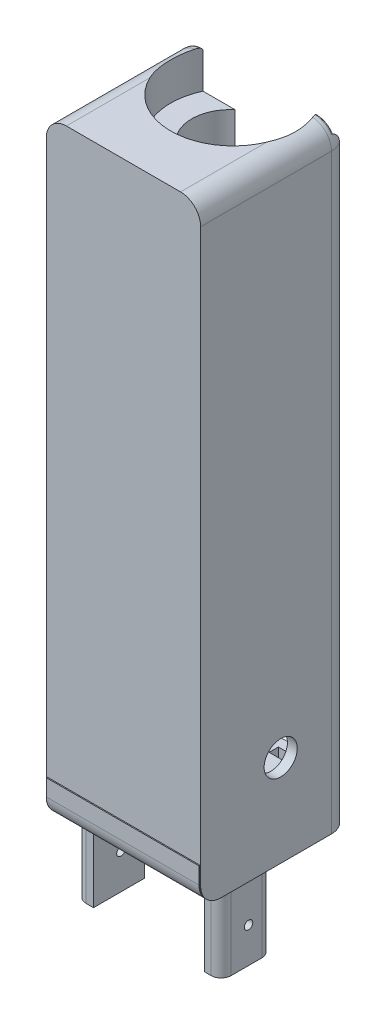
ISO-10303-21;
HEADER;
FILE_DESCRIPTION(('STEP AP214'),'2;1');
FILE_NAME('part.step','',(''),(''),'','','');
FILE_SCHEMA(('AUTOMOTIVE_DESIGN { 1 0 10303 214 1 1 1 1 }'));
ENDSEC;
DATA;
#1=APPLICATION_CONTEXT('core data for automotive mechanical design processes');
#2=APPLICATION_PROTOCOL_DEFINITION('international standard','automotive_design',2000,#1);
#3=PRODUCT_CONTEXT('',#1,'mechanical');
#4=PRODUCT('Part','Part','',(#3));
#5=PRODUCT_RELATED_PRODUCT_CATEGORY('part','',(#4));
#6=PRODUCT_DEFINITION_FORMATION('','',#4);
#7=PRODUCT_DEFINITION_CONTEXT('part definition',#1,'design');
#8=PRODUCT_DEFINITION('design','',#6,#7);
#9=PRODUCT_DEFINITION_SHAPE('','',#8);
#10=(LENGTH_UNIT() NAMED_UNIT(*) SI_UNIT(.MILLI.,.METRE.));
#11=(NAMED_UNIT(*) PLANE_ANGLE_UNIT() SI_UNIT($,.RADIAN.));
#12=(NAMED_UNIT(*) SI_UNIT($,.STERADIAN.) SOLID_ANGLE_UNIT());
#13=UNCERTAINTY_MEASURE_WITH_UNIT(LENGTH_MEASURE(1.E-05),#10,'distance_accuracy_value','');
#14=(GEOMETRIC_REPRESENTATION_CONTEXT(3) GLOBAL_UNCERTAINTY_ASSIGNED_CONTEXT((#13)) GLOBAL_UNIT_ASSIGNED_CONTEXT((#10,
#11,#12)) REPRESENTATION_CONTEXT('',''));
#15=CARTESIAN_POINT('',(0.,0.,0.));
#16=DIRECTION('',(0.,0.,1.));
#17=DIRECTION('',(1.,0.,0.));
#18=AXIS2_PLACEMENT_3D('',#15,#16,#17);
#19=CARTESIAN_POINT('',(-22.5195447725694,-72.6426266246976,14.2867514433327));
#20=DIRECTION('',(0.,0.,-1.));
#21=DIRECTION('',(-1.,0.,0.));
#22=AXIS2_PLACEMENT_3D('',#19,#20,#21);
#23=CYLINDRICAL_SURFACE('',#22,3.000000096);
#24=CARTESIAN_POINT('',(-22.5195447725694,-72.6426266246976,24.5640071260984));
#25=DIRECTION('',(0.,0.,-1.));
#26=DIRECTION('',(-1.,0.,0.));
#27=AXIS2_PLACEMENT_3D('',#24,#25,#26);
#28=CIRCLE('',#27,3.000000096);
#29=CARTESIAN_POINT('',(-19.5195446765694,-72.6426266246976,24.5640071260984));
#30=VERTEX_POINT('',#29);
#31=CARTESIAN_POINT('',(-21.4111672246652,-75.430367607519,24.5640071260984));
#32=VERTEX_POINT('',#31);
#33=EDGE_CURVE('E50',#30,#32,#28,.T.);
#34=ORIENTED_EDGE('',*,*,#33,.F.);
#35=DIRECTION('',(0.,0.,-1.));
#36=VECTOR('',#35,1.);
#37=CARTESIAN_POINT('',(-19.5195446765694,-72.6426266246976,38.1));
#38=LINE('',#37,#36);
#39=CARTESIAN_POINT('',(-19.5195446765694,-72.6426266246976,16.8267514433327));
#40=VERTEX_POINT('',#39);
#41=EDGE_CURVE('E1122',#40,#30,#38,.F.);
#42=ORIENTED_EDGE('',*,*,#41,.F.);
#43=CARTESIAN_POINT('',(-22.5195447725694,-72.6426266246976,16.8267514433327));
#44=DIRECTION('',(0.,0.,-1.));
#45=DIRECTION('',(-1.,0.,0.));
#46=AXIS2_PLACEMENT_3D('',#43,#44,#45);
#47=CIRCLE('',#46,3.000000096);
#48=CARTESIAN_POINT('',(-21.4111672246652,-75.430367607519,16.8267514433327));
#49=VERTEX_POINT('',#48);
#50=EDGE_CURVE('E1150',#40,#49,#47,.T.);
#51=ORIENTED_EDGE('',*,*,#50,.T.);
#52=DIRECTION('',(0.,0.,-1.));
#53=VECTOR('',#52,1.);
#54=CARTESIAN_POINT('',(-21.4111672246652,-75.430367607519,14.2867514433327));
#55=LINE('',#54,#53);
#56=EDGE_CURVE('E1136',#32,#49,#55,.T.);
#57=ORIENTED_EDGE('',*,*,#56,.F.);
#58=EDGE_LOOP('',(#34,#42,#51,#57));
#59=FACE_BOUND('',#58,.T.);
#60=ADVANCED_FACE('F39',(#59),#23,.F.);
#61=CARTESIAN_POINT('',(-22.5195447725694,-77.7906548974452,16.8267514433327));
#62=DIRECTION('',(1.,0.,0.));
#63=DIRECTION('',(0.,1.,0.));
#64=AXIS2_PLACEMENT_3D('',#61,#62,#63);
#65=TOROIDAL_SURFACE('',#64,5.14802827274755,3.000000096);
#66=ORIENTED_EDGE('',*,*,#50,.F.);
#67=CARTESIAN_POINT('',(-19.5195446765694,-77.7906548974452,16.8267514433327));
#68=DIRECTION('',(1.,0.,0.));
#69=DIRECTION('',(0.,1.,0.));
#70=AXIS2_PLACEMENT_3D('',#67,#68,#69);
#71=CIRCLE('',#70,5.14802827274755);
#72=CARTESIAN_POINT('',(-19.5195446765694,-73.2125353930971,14.4723901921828));
#73=VERTEX_POINT('',#72);
#74=EDGE_CURVE('E1125',#73,#40,#71,.T.);
#75=ORIENTED_EDGE('',*,*,#74,.F.);
#76=CARTESIAN_POINT('',(-21.4111672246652,-77.7906548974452,14.4664641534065));
#77=CARTESIAN_POINT('',(-21.4093167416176,-77.7879487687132,14.4657284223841));
#78=CARTESIAN_POINT('',(-21.4074664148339,-77.7852417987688,14.4649952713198));
#79=CARTESIAN_POINT('',(-21.2920512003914,-77.6163258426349,14.4194211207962));
#80=CARTESIAN_POINT('',(-21.1790978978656,-77.446958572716,14.3842766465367));
#81=CARTESIAN_POINT('',(-20.9571161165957,-77.102975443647,14.330749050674));
#82=CARTESIAN_POINT('',(-20.8480921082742,-76.9283539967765,14.3123844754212));
#83=CARTESIAN_POINT('',(-20.6359020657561,-76.5733578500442,14.2897418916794));
#84=CARTESIAN_POINT('',(-20.5327730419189,-76.3929559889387,14.2855449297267));
#85=CARTESIAN_POINT('',(-20.3356622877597,-76.0274359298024,14.2885422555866));
#86=CARTESIAN_POINT('',(-20.2416763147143,-75.8423199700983,14.2957312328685));
#87=CARTESIAN_POINT('',(-20.0867045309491,-75.5117786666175,14.3153487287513));
#88=CARTESIAN_POINT('',(-20.0231975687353,-75.3674302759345,14.3261163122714));
#89=CARTESIAN_POINT('',(-19.9046289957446,-75.075464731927,14.3503615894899));
#90=CARTESIAN_POINT('',(-19.8495690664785,-74.9278469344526,14.3638398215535));
#91=CARTESIAN_POINT('',(-19.7502328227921,-74.630553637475,14.3911382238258));
#92=CARTESIAN_POINT('',(-19.7058614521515,-74.4809098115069,14.404954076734));
#93=CARTESIAN_POINT('',(-19.6295340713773,-74.1782965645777,14.4304556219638));
#94=CARTESIAN_POINT('',(-19.5975703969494,-74.0253292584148,14.4421426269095));
#95=CARTESIAN_POINT('',(-19.5583903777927,-73.7773342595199,14.4569810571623));
#96=CARTESIAN_POINT('',(-19.5463850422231,-73.6831539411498,14.4616820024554));
#97=CARTESIAN_POINT('',(-19.5286479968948,-73.4941489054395,14.468705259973));
#98=CARTESIAN_POINT('',(-19.5229128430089,-73.3993245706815,14.4710288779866));
#99=CARTESIAN_POINT('',(-19.5183474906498,-73.2080771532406,14.4728731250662));
#100=CARTESIAN_POINT('',(-19.5196183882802,-73.1116507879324,14.472352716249));
#101=CARTESIAN_POINT('',(-19.5273462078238,-72.9673009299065,14.4692455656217));
#102=CARTESIAN_POINT('',(-19.5308990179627,-72.9191835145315,14.4678194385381));
#103=CARTESIAN_POINT('',(-19.5400122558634,-72.82315921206,14.464202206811));
#104=CARTESIAN_POINT('',(-19.5455730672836,-72.7752523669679,14.4620109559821));
#105=CARTESIAN_POINT('',(-19.552167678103,-72.7275002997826,14.459443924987));
#106=B_SPLINE_CURVE_WITH_KNOTS('',3,(#76,#77,#78,#79,#80,#81,#82,#83,#84,#85,#86,#87,#88,#89,
#90,#91,#92,#93,#94,#95,#96,#97,#98,#99,#100,#101,#102,#103,#104,#105),.UNSPECIFIED.,.F.,.F.,(4,
2,2,2,2,2,2,2,2,2,2,2,2,2,4),(0.,0.0100796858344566,0.628781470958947,1.2481662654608,
1.87108833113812,2.49371994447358,2.967683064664,3.44174041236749,3.91141181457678,
4.38079263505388,4.66576713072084,4.95058501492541,5.23952343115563,5.38428914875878,
5.52908254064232),.UNSPECIFIED.);
#107=CARTESIAN_POINT('',(-21.4111672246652,-77.7906548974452,14.4664641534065));
#108=VERTEX_POINT('',#107);
#109=EDGE_CURVE('E1143',#73,#108,#106,.F.);
#110=ORIENTED_EDGE('',*,*,#109,.T.);
#111=CARTESIAN_POINT('',(-21.4111672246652,-77.7906548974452,16.8267514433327));
#112=DIRECTION('',(1.,0.,0.));
#113=DIRECTION('',(0.,1.,0.));
#114=AXIS2_PLACEMENT_3D('',#111,#112,#113);
#115=CIRCLE('',#114,2.36028728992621);
#116=EDGE_CURVE('E1131',#49,#108,#115,.F.);
#117=ORIENTED_EDGE('',*,*,#116,.F.);
#118=EDGE_LOOP('',(#66,#75,#110,#117));
#119=FACE_BOUND('',#118,.T.);
#120=ADVANCED_FACE('F1151',(#119),#65,.F.);
#121=CARTESIAN_POINT('',(-22.5195447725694,-77.7906548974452,24.5640071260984));
#122=DIRECTION('',(1.,0.,0.));
#123=DIRECTION('',(0.,1.,0.));
#124=AXIS2_PLACEMENT_3D('',#121,#122,#123);
#125=TOROIDAL_SURFACE('',#124,5.14802827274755,3.000000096);
#126=CARTESIAN_POINT('',(-19.5195446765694,-77.7906548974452,24.5640071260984));
#127=DIRECTION('',(1.,0.,0.));
#128=DIRECTION('',(0.,1.,0.));
#129=AXIS2_PLACEMENT_3D('',#126,#127,#128);
#130=CIRCLE('',#129,5.14802827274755);
#131=CARTESIAN_POINT('',(-19.5195446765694,-73.2125353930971,26.9183683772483));
#132=VERTEX_POINT('',#131);
#133=EDGE_CURVE('E1119',#30,#132,#130,.T.);
#134=ORIENTED_EDGE('',*,*,#133,.F.);
#135=ORIENTED_EDGE('',*,*,#33,.T.);
#136=CARTESIAN_POINT('',(-21.4111672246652,-77.7906548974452,24.5640071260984));
#137=DIRECTION('',(1.,0.,0.));
#138=DIRECTION('',(0.,1.,0.));
#139=AXIS2_PLACEMENT_3D('',#136,#137,#138);
#140=CIRCLE('',#139,2.36028728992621);
#141=CARTESIAN_POINT('',(-21.4111672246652,-77.7906548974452,26.9242944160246));
#142=VERTEX_POINT('',#141);
#143=EDGE_CURVE('E1139',#142,#32,#140,.F.);
#144=ORIENTED_EDGE('',*,*,#143,.F.);
#145=CARTESIAN_POINT('',(-21.4111672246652,-77.7906548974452,26.9242944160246));
#146=CARTESIAN_POINT('',(-21.4093167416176,-77.7879487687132,26.9250301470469));
#147=CARTESIAN_POINT('',(-21.4074664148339,-77.7852417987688,26.9257632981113));
#148=CARTESIAN_POINT('',(-21.2920512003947,-77.6163258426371,26.9713374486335));
#149=CARTESIAN_POINT('',(-21.1790978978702,-77.4469585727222,27.0064819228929));
#150=CARTESIAN_POINT('',(-20.9571161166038,-77.1029754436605,27.0600095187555));
#151=CARTESIAN_POINT('',(-20.8480921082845,-76.9283539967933,27.0783740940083));
#152=CARTESIAN_POINT('',(-20.6359020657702,-76.5733578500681,27.1010166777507));
#153=CARTESIAN_POINT('',(-20.5327730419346,-76.3929559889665,27.105213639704));
#154=CARTESIAN_POINT('',(-20.3356622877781,-76.027435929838,27.1022163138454));
#155=CARTESIAN_POINT('',(-20.2416763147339,-75.8423199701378,27.0950273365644));
#156=CARTESIAN_POINT('',(-20.0867045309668,-75.511778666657,27.0754098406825));
#157=CARTESIAN_POINT('',(-20.0231975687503,-75.3674302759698,27.0646422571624));
#158=CARTESIAN_POINT('',(-19.9046289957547,-75.0754647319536,27.0403969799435));
#159=CARTESIAN_POINT('',(-19.8495690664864,-74.9278469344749,27.0269187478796));
#160=CARTESIAN_POINT('',(-19.7502328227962,-74.6305536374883,26.9996203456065));
#161=CARTESIAN_POINT('',(-19.7058614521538,-74.4809098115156,26.9858044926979));
#162=CARTESIAN_POINT('',(-19.629534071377,-74.1782965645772,26.9603029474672));
#163=CARTESIAN_POINT('',(-19.5975703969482,-74.0253292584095,26.9486159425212));
#164=CARTESIAN_POINT('',(-19.5583903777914,-73.7773342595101,26.9337775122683));
#165=CARTESIAN_POINT('',(-19.546385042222,-73.6831539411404,26.9290765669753));
#166=CARTESIAN_POINT('',(-19.5286479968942,-73.4941489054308,26.9220533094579));
#167=CARTESIAN_POINT('',(-19.5229128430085,-73.3993245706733,26.9197296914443));
#168=CARTESIAN_POINT('',(-19.5183474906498,-73.2080771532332,26.9178854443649));
#169=CARTESIAN_POINT('',(-19.5196183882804,-73.1116507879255,26.9184058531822));
#170=CARTESIAN_POINT('',(-19.5273462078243,-72.9673009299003,26.9215130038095));
#171=CARTESIAN_POINT('',(-19.5308990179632,-72.9191835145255,26.9229391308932));
#172=CARTESIAN_POINT('',(-19.5400122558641,-72.8231592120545,26.9265563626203));
#173=CARTESIAN_POINT('',(-19.5455730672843,-72.7752523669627,26.9287476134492));
#174=CARTESIAN_POINT('',(-19.5521676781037,-72.7275002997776,26.9313146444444));
#175=B_SPLINE_CURVE_WITH_KNOTS('',3,(#145,#146,#147,#148,#149,#150,#151,#152,#153,#154,#155,
#156,#157,#158,#159,#160,#161,#162,#163,#164,#165,#166,#167,#168,#169,#170,#171,#172,#173,#174),
.UNSPECIFIED.,.F.,.F.,(4,2,2,2,2,2,2,2,2,2,2,2,2,2,4),(0.,0.0100796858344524,0.628781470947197,
1.24816626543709,1.8710883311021,2.49371994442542,2.9676830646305,3.44174041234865,
3.91141181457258,4.38079263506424,4.66576713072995,4.95058501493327,5.23952343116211,
5.38428914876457,5.52908254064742),.UNSPECIFIED.);
#176=EDGE_CURVE('E12',#142,#132,#175,.T.);
#177=ORIENTED_EDGE('',*,*,#176,.T.);
#178=EDGE_LOOP('',(#134,#135,#144,#177));
#179=FACE_BOUND('',#178,.T.);
#180=ADVANCED_FACE('F1197',(#179),#125,.F.);
#181=CARTESIAN_POINT('',(11.0998791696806,-78.2506548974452,24.5640071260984));
#182=DIRECTION('',(0.,1.,0.));
#183=DIRECTION('',(0.,0.,1.));
#184=AXIS2_PLACEMENT_3D('',#181,#182,#183);
#185=TOROIDAL_SURFACE('',#184,5.54,3.);
#186=CARTESIAN_POINT('',(11.0998791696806,-78.2506548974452,30.1040071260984));
#187=DIRECTION('',(1.,0.,0.));
#188=DIRECTION('',(0.,0.,-1.));
#189=AXIS2_PLACEMENT_3D('',#186,#187,#188);
#190=CIRCLE('',#189,3.);
#191=CARTESIAN_POINT('',(11.0998791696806,-78.2506548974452,27.1040071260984));
#192=VERTEX_POINT('',#191);
#193=CARTESIAN_POINT('',(11.0998791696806,-75.2506548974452,30.1040071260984));
#194=VERTEX_POINT('',#193);
#195=EDGE_CURVE('E1112',#192,#194,#190,.T.);
#196=ORIENTED_EDGE('',*,*,#195,.F.);
#197=CARTESIAN_POINT('',(11.0998791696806,-78.2506548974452,24.5640071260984));
#198=DIRECTION('',(0.,1.,0.));
#199=DIRECTION('',(0.,0.,1.));
#200=AXIS2_PLACEMENT_3D('',#197,#198,#199);
#201=CIRCLE('',#200,2.54);
#202=CARTESIAN_POINT('',(13.6398791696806,-78.2506548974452,24.5640071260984));
#203=VERTEX_POINT('',#202);
#204=EDGE_CURVE('E1095',#203,#192,#201,.F.);
#205=ORIENTED_EDGE('',*,*,#204,.F.);
#206=CARTESIAN_POINT('',(16.6398791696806,-78.2506548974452,24.5640071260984));
#207=DIRECTION('',(0.,0.,-1.));
#208=DIRECTION('',(-1.,0.,0.));
#209=AXIS2_PLACEMENT_3D('',#206,#207,#208);
#210=CIRCLE('',#209,3.);
#211=CARTESIAN_POINT('',(16.6398791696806,-75.2506548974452,24.5640071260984));
#212=VERTEX_POINT('',#211);
#213=EDGE_CURVE('E1110',#203,#212,#210,.T.);
#214=ORIENTED_EDGE('',*,*,#213,.T.);
#215=CARTESIAN_POINT('',(11.0998791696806,-75.2506548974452,24.5640071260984));
#216=DIRECTION('',(0.,1.,0.));
#217=DIRECTION('',(0.,0.,1.));
#218=AXIS2_PLACEMENT_3D('',#215,#216,#217);
#219=CIRCLE('',#218,5.54);
#220=EDGE_CURVE('E1077',#194,#212,#219,.T.);
#221=ORIENTED_EDGE('',*,*,#220,.F.);
#222=EDGE_LOOP('',(#196,#205,#214,#221));
#223=FACE_BOUND('',#222,.T.);
#224=ADVANCED_FACE('F1376',(#223),#185,.F.);
#225=CARTESIAN_POINT('',(16.6398791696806,-78.2506548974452,14.2867514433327));
#226=DIRECTION('',(0.,0.,-1.));
#227=DIRECTION('',(-1.,0.,0.));
#228=AXIS2_PLACEMENT_3D('',#225,#226,#227);
#229=CYLINDRICAL_SURFACE('',#228,3.);
#230=ORIENTED_EDGE('',*,*,#213,.F.);
#231=DIRECTION('',(0.,0.,1.));
#232=VECTOR('',#231,1.);
#233=CARTESIAN_POINT('',(13.6398791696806,-78.2506548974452,14.2867514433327));
#234=LINE('',#233,#232);
#235=CARTESIAN_POINT('',(13.6398791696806,-78.2506548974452,16.8267514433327));
#236=VERTEX_POINT('',#235);
#237=EDGE_CURVE('E1092',#236,#203,#234,.T.);
#238=ORIENTED_EDGE('',*,*,#237,.F.);
#239=CARTESIAN_POINT('',(16.6398791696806,-78.2506548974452,16.8267514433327));
#240=DIRECTION('',(0.,0.,-1.));
#241=DIRECTION('',(-1.,0.,0.));
#242=AXIS2_PLACEMENT_3D('',#239,#240,#241);
#243=CIRCLE('',#242,3.);
#244=CARTESIAN_POINT('',(16.6398791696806,-75.2506548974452,16.8267514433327));
#245=VERTEX_POINT('',#244);
#246=EDGE_CURVE('E1108',#236,#245,#243,.T.);
#247=ORIENTED_EDGE('',*,*,#246,.T.);
#248=DIRECTION('',(0.,0.,1.));
#249=VECTOR('',#248,1.);
#250=CARTESIAN_POINT('',(16.6398791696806,-75.2506548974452,14.2867514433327));
#251=LINE('',#250,#249);
#252=EDGE_CURVE('E1080',#212,#245,#251,.F.);
#253=ORIENTED_EDGE('',*,*,#252,.F.);
#254=EDGE_LOOP('',(#230,#238,#247,#253));
#255=FACE_BOUND('',#254,.T.);
#256=ADVANCED_FACE('F1385',(#255),#229,.F.);
#257=CARTESIAN_POINT('',(11.0998791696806,-78.2506548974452,16.8267514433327));
#258=DIRECTION('',(0.,1.,0.));
#259=DIRECTION('',(0.,0.,1.));
#260=AXIS2_PLACEMENT_3D('',#257,#258,#259);
#261=TOROIDAL_SURFACE('',#260,5.54,3.);
#262=ORIENTED_EDGE('',*,*,#246,.F.);
#263=CARTESIAN_POINT('',(11.0998791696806,-78.2506548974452,16.8267514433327));
#264=DIRECTION('',(0.,1.,0.));
#265=DIRECTION('',(0.,0.,1.));
#266=AXIS2_PLACEMENT_3D('',#263,#264,#265);
#267=CIRCLE('',#266,2.54);
#268=CARTESIAN_POINT('',(11.0998791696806,-78.2506548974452,14.2867514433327));
#269=VERTEX_POINT('',#268);
#270=EDGE_CURVE('E1089',#269,#236,#267,.F.);
#271=ORIENTED_EDGE('',*,*,#270,.F.);
#272=CARTESIAN_POINT('',(11.0998791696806,-78.2506548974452,11.2867514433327));
#273=DIRECTION('',(-1.,0.,0.));
#274=DIRECTION('',(0.,0.,1.));
#275=AXIS2_PLACEMENT_3D('',#272,#273,#274);
#276=CIRCLE('',#275,3.);
#277=CARTESIAN_POINT('',(11.0998791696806,-75.2506548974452,11.2867514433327));
#278=VERTEX_POINT('',#277);
#279=EDGE_CURVE('E1106',#269,#278,#276,.T.);
#280=ORIENTED_EDGE('',*,*,#279,.T.);
#281=CARTESIAN_POINT('',(11.0998791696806,-75.2506548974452,16.8267514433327));
#282=DIRECTION('',(0.,1.,0.));
#283=DIRECTION('',(0.,0.,1.));
#284=AXIS2_PLACEMENT_3D('',#281,#282,#283);
#285=CIRCLE('',#284,5.54);
#286=EDGE_CURVE('E1083',#245,#278,#285,.T.);
#287=ORIENTED_EDGE('',*,*,#286,.F.);
#288=EDGE_LOOP('',(#262,#271,#280,#287));
#289=FACE_BOUND('',#288,.T.);
#290=ADVANCED_FACE('F1391',(#289),#261,.F.);
#291=CARTESIAN_POINT('',(13.6398791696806,-78.2506548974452,11.2867514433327));
#292=DIRECTION('',(-1.,0.,0.));
#293=DIRECTION('',(0.,0.,1.));
#294=AXIS2_PLACEMENT_3D('',#291,#292,#293);
#295=CYLINDRICAL_SURFACE('',#294,3.);
#296=ORIENTED_EDGE('',*,*,#279,.F.);
#297=DIRECTION('',(1.,0.,0.));
#298=VECTOR('',#297,1.);
#299=CARTESIAN_POINT('',(13.6398791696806,-78.2506548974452,14.2867514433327));
#300=LINE('',#299,#298);
#301=CARTESIAN_POINT('',(-19.5195446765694,-78.2506548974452,14.2867514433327));
#302=VERTEX_POINT('',#301);
#303=EDGE_CURVE('E1071',#302,#269,#300,.T.);
#304=ORIENTED_EDGE('',*,*,#303,.F.);
#305=CARTESIAN_POINT('',(-19.5195446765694,-78.2506548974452,11.2867514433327));
#306=DIRECTION('',(1.,0.,0.));
#307=DIRECTION('',(0.,1.,0.));
#308=AXIS2_PLACEMENT_3D('',#305,#306,#307);
#309=CIRCLE('',#308,3.);
#310=CARTESIAN_POINT('',(-19.5195446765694,-75.2506548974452,11.2867514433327));
#311=VERTEX_POINT('',#310);
#312=EDGE_CURVE('E1104',#302,#311,#309,.F.);
#313=ORIENTED_EDGE('',*,*,#312,.T.);
#314=DIRECTION('',(1.,0.,0.));
#315=VECTOR('',#314,1.);
#316=CARTESIAN_POINT('',(13.6398791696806,-75.2506548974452,11.2867514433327));
#317=LINE('',#316,#315);
#318=EDGE_CURVE('E1086',#278,#311,#317,.F.);
#319=ORIENTED_EDGE('',*,*,#318,.F.);
#320=EDGE_LOOP('',(#296,#304,#313,#319));
#321=FACE_BOUND('',#320,.T.);
#322=ADVANCED_FACE('F1398',(#321),#295,.F.);
#323=CARTESIAN_POINT('',(13.6398791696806,-78.2506548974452,30.1040071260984));
#324=DIRECTION('',(1.,0.,0.));
#325=DIRECTION('',(0.,0.,-1.));
#326=AXIS2_PLACEMENT_3D('',#323,#324,#325);
#327=CYLINDRICAL_SURFACE('',#326,3.);
#328=DIRECTION('',(-1.,0.,0.));
#329=VECTOR('',#328,1.);
#330=CARTESIAN_POINT('',(13.6398791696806,-78.2506548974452,27.1040071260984));
#331=LINE('',#330,#329);
#332=CARTESIAN_POINT('',(-19.5195446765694,-78.2506548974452,27.1040071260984));
#333=VERTEX_POINT('',#332);
#334=EDGE_CURVE('E1101',#192,#333,#331,.T.);
#335=ORIENTED_EDGE('',*,*,#334,.F.);
#336=ORIENTED_EDGE('',*,*,#195,.T.);
#337=DIRECTION('',(-1.,0.,0.));
#338=VECTOR('',#337,1.);
#339=CARTESIAN_POINT('',(13.6398791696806,-75.2506548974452,30.1040071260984));
#340=LINE('',#339,#338);
#341=CARTESIAN_POINT('',(-19.5195446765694,-75.2506548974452,30.1040071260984));
#342=VERTEX_POINT('',#341);
#343=EDGE_CURVE('E1074',#342,#194,#340,.F.);
#344=ORIENTED_EDGE('',*,*,#343,.F.);
#345=CARTESIAN_POINT('',(-19.5195446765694,-78.2506548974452,30.1040071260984));
#346=DIRECTION('',(1.,0.,0.));
#347=DIRECTION('',(0.,1.,0.));
#348=AXIS2_PLACEMENT_3D('',#345,#346,#347);
#349=CIRCLE('',#348,3.);
#350=EDGE_CURVE('E1114',#342,#333,#349,.F.);
#351=ORIENTED_EDGE('',*,*,#350,.T.);
#352=EDGE_LOOP('',(#335,#336,#344,#351));
#353=FACE_BOUND('',#352,.T.);
#354=ADVANCED_FACE('F1405',(#353),#327,.F.);
#355=CARTESIAN_POINT('',(0.,-65.652221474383,0.));
#356=DIRECTION('',(0.,-1.,0.));
#357=DIRECTION('',(0.,0.,-1.));
#358=AXIS2_PLACEMENT_3D('',#355,#356,#357);
#359=PLANE('',#358);
#360=DIRECTION('',(0.,0.,1.));
#361=VECTOR('',#360,1.);
#362=CARTESIAN_POINT('',(-10.3702034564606,-65.652221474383,5.08494339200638));
#363=LINE('',#362,#361);
#364=CARTESIAN_POINT('',(-10.3702034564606,-65.652221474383,2.34891980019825));
#365=VERTEX_POINT('',#364);
#366=CARTESIAN_POINT('',(-10.3702034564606,-65.652221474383,5.08494339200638));
#367=VERTEX_POINT('',#366);
#368=EDGE_CURVE('E735',#365,#367,#363,.T.);
#369=ORIENTED_EDGE('',*,*,#368,.F.);
#370=DIRECTION('',(-1.,0.,0.));
#371=VECTOR('',#370,1.);
#372=CARTESIAN_POINT('',(-10.3702034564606,-65.652221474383,2.34891980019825));
#373=LINE('',#372,#371);
#374=CARTESIAN_POINT('',(-2.57283550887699,-65.652221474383,2.34891980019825));
#375=VERTEX_POINT('',#374);
#376=EDGE_CURVE('E587',#375,#365,#373,.T.);
#377=ORIENTED_EDGE('',*,*,#376,.F.);
#378=DIRECTION('',(0.,0.,-1.));
#379=VECTOR('',#378,1.);
#380=CARTESIAN_POINT('',(-2.57283550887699,-65.652221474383,3.55600000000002));
#381=LINE('',#380,#379);
#382=CARTESIAN_POINT('',(-2.57283550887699,-65.652221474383,3.55600000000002));
#383=VERTEX_POINT('',#382);
#384=EDGE_CURVE('E598',#383,#375,#381,.T.);
#385=ORIENTED_EDGE('',*,*,#384,.F.);
#386=DIRECTION('',(1.,0.,0.));
#387=VECTOR('',#386,1.);
#388=CARTESIAN_POINT('',(-10.3702034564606,-65.652221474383,3.55600000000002));
#389=LINE('',#388,#387);
#390=CARTESIAN_POINT('',(-2.63271094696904,-65.652221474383,3.55600000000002));
#391=VERTEX_POINT('',#390);
#392=EDGE_CURVE('E579',#391,#383,#389,.T.);
#393=ORIENTED_EDGE('',*,*,#392,.F.);
#394=DIRECTION('',(0.,0.,-1.));
#395=VECTOR('',#394,1.);
#396=CARTESIAN_POINT('',(-2.63271094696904,-65.652221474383,5.08494339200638));
#397=LINE('',#396,#395);
#398=CARTESIAN_POINT('',(-2.63271094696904,-65.652221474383,5.08494339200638));
#399=VERTEX_POINT('',#398);
#400=EDGE_CURVE('E715',#399,#391,#397,.T.);
#401=ORIENTED_EDGE('',*,*,#400,.F.);
#402=DIRECTION('',(1.,0.,0.));
#403=VECTOR('',#402,1.);
#404=CARTESIAN_POINT('',(-2.63271094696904,-65.652221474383,5.08494339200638));
#405=LINE('',#404,#403);
#406=EDGE_CURVE('E723',#367,#399,#405,.T.);
#407=ORIENTED_EDGE('',*,*,#406,.F.);
#408=EDGE_LOOP('',(#369,#377,#385,#393,#401,#407));
#409=FACE_BOUND('',#408,.T.);
#410=DIRECTION('',(0.,0.,-1.));
#411=VECTOR('',#410,1.);
#412=CARTESIAN_POINT('',(3.32395344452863,-65.652221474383,4.68278673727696));
#413=LINE('',#412,#411);
#414=CARTESIAN_POINT('',(3.32395344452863,-65.652221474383,4.68278673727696));
#415=VERTEX_POINT('',#414);
#416=CARTESIAN_POINT('',(3.32395344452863,-65.652221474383,2.34891980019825));
#417=VERTEX_POINT('',#416);
#418=EDGE_CURVE('E708',#415,#417,#413,.T.);
#419=ORIENTED_EDGE('',*,*,#418,.T.);
#420=DIRECTION('',(-1.,0.,0.));
#421=VECTOR('',#420,1.);
#422=CARTESIAN_POINT('',(3.32395344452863,-65.652221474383,2.34891980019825));
#423=LINE('',#422,#421);
#424=CARTESIAN_POINT('',(11.2434943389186,-65.652221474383,2.34891980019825));
#425=VERTEX_POINT('',#424);
#426=EDGE_CURVE('E563',#425,#417,#423,.T.);
#427=ORIENTED_EDGE('',*,*,#426,.F.);
#428=DIRECTION('',(0.,0.,-1.));
#429=VECTOR('',#428,1.);
#430=CARTESIAN_POINT('',(11.2434943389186,-65.652221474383,3.55600000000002));
#431=LINE('',#430,#429);
#432=CARTESIAN_POINT('',(11.2434943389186,-65.652221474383,3.55600000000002));
#433=VERTEX_POINT('',#432);
#434=EDGE_CURVE('E566',#433,#425,#431,.T.);
#435=ORIENTED_EDGE('',*,*,#434,.F.);
#436=DIRECTION('',(1.,0.,0.));
#437=VECTOR('',#436,1.);
#438=CARTESIAN_POINT('',(3.32395344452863,-65.652221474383,3.55600000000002));
#439=LINE('',#438,#437);
#440=CARTESIAN_POINT('',(11.0974204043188,-65.652221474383,3.55600000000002));
#441=VERTEX_POINT('',#440);
#442=EDGE_CURVE('E573',#441,#433,#439,.T.);
#443=ORIENTED_EDGE('',*,*,#442,.F.);
#444=DIRECTION('',(0.,0.,-1.));
#445=VECTOR('',#444,1.);
#446=CARTESIAN_POINT('',(11.0974204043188,-65.652221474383,4.68278673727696));
#447=LINE('',#446,#445);
#448=CARTESIAN_POINT('',(11.0974204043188,-65.652221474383,4.68278673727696));
#449=VERTEX_POINT('',#448);
#450=EDGE_CURVE('E705',#449,#441,#447,.T.);
#451=ORIENTED_EDGE('',*,*,#450,.F.);
#452=DIRECTION('',(-1.,0.,0.));
#453=VECTOR('',#452,1.);
#454=CARTESIAN_POINT('',(11.0974204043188,-65.652221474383,4.68278673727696));
#455=LINE('',#454,#453);
#456=EDGE_CURVE('E699',#449,#415,#455,.T.);
#457=ORIENTED_EDGE('',*,*,#456,.T.);
#458=EDGE_LOOP('',(#419,#427,#435,#443,#451,#457));
#459=FACE_BOUND('',#458,.T.);
#460=DIRECTION('',(1.,0.,0.));
#461=VECTOR('',#460,1.);
#462=CARTESIAN_POINT('',(-30.1875446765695,-65.652221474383,14.6034888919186));
#463=LINE('',#462,#461);
#464=CARTESIAN_POINT('',(-13.1695446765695,-65.652221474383,14.6034888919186));
#465=VERTEX_POINT('',#464);
#466=CARTESIAN_POINT('',(-16.9795446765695,-65.652221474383,14.6034888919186));
#467=VERTEX_POINT('',#466);
#468=EDGE_CURVE('E1249',#465,#467,#463,.F.);
#469=ORIENTED_EDGE('',*,*,#468,.F.);
#470=DIRECTION('',(0.,0.,-1.));
#471=VECTOR('',#470,1.);
#472=CARTESIAN_POINT('',(-13.1695446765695,-65.652221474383,0.));
#473=LINE('',#472,#471);
#474=CARTESIAN_POINT('',(-13.1695446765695,-65.652221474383,23.3895084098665));
#475=VERTEX_POINT('',#474);
#476=EDGE_CURVE('E1243',#475,#465,#473,.T.);
#477=ORIENTED_EDGE('',*,*,#476,.F.);
#478=DIRECTION('',(1.,0.,0.));
#479=VECTOR('',#478,1.);
#480=CARTESIAN_POINT('',(-30.1875446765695,-65.652221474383,23.3895084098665));
#481=LINE('',#480,#479);
#482=CARTESIAN_POINT('',(-16.9795446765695,-65.652221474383,23.3895084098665));
#483=VERTEX_POINT('',#482);
#484=EDGE_CURVE('E1245',#483,#475,#481,.T.);
#485=ORIENTED_EDGE('',*,*,#484,.F.);
#486=CARTESIAN_POINT('',(-16.9798305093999,-65.652221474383,23.3895084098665));
#487=VERTEX_POINT('',#486);
#488=EDGE_CURVE('E1246',#487,#483,#481,.T.);
#489=ORIENTED_EDGE('',*,*,#488,.F.);
#490=DIRECTION('',(0.,0.,-1.));
#491=VECTOR('',#490,1.);
#492=CARTESIAN_POINT('',(-16.9798305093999,-65.652221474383,36.1));
#493=LINE('',#492,#491);
#494=CARTESIAN_POINT('',(-16.9798305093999,-65.652221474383,36.1));
#495=VERTEX_POINT('',#494);
#496=EDGE_CURVE('E814',#495,#487,#493,.T.);
#497=ORIENTED_EDGE('',*,*,#496,.F.);
#498=DIRECTION('',(-1.,0.,0.));
#499=VECTOR('',#498,1.);
#500=CARTESIAN_POINT('',(0.,-65.652221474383,36.1));
#501=LINE('',#500,#499);
#502=CARTESIAN_POINT('',(16.9798305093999,-65.652221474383,36.1));
#503=VERTEX_POINT('',#502);
#504=EDGE_CURVE('E807',#503,#495,#501,.T.);
#505=ORIENTED_EDGE('',*,*,#504,.F.);
#506=DIRECTION('',(0.,0.,-1.));
#507=VECTOR('',#506,1.);
#508=CARTESIAN_POINT('',(16.9798305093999,-65.652221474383,36.1));
#509=LINE('',#508,#507);
#510=CARTESIAN_POINT('',(16.9798305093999,-65.652221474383,0.711212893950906));
#511=VERTEX_POINT('',#510);
#512=EDGE_CURVE('E810',#503,#511,#509,.T.);
#513=ORIENTED_EDGE('',*,*,#512,.T.);
#514=CARTESIAN_POINT('',(14.387515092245,-65.652221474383,5.08));
#515=DIRECTION('',(0.,-1.,0.));
#516=DIRECTION('',(0.,0.,-1.));
#517=AXIS2_PLACEMENT_3D('',#514,#515,#516);
#518=CIRCLE('',#517,5.08);
#519=CARTESIAN_POINT('',(14.387515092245,-65.652221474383,0.));
#520=VERTEX_POINT('',#519);
#521=EDGE_CURVE('E929',#511,#520,#518,.F.);
#522=ORIENTED_EDGE('',*,*,#521,.T.);
#523=DIRECTION('',(-1.,0.,0.));
#524=VECTOR('',#523,1.);
#525=CARTESIAN_POINT('',(19.2975822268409,-65.652221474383,0.));
#526=LINE('',#525,#524);
#527=CARTESIAN_POINT('',(-14.4395446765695,-65.652221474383,0.));
#528=VERTEX_POINT('',#527);
#529=EDGE_CURVE('E792',#520,#528,#526,.T.);
#530=ORIENTED_EDGE('',*,*,#529,.T.);
#531=CARTESIAN_POINT('',(-14.4395446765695,-65.652221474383,5.08));
#532=DIRECTION('',(0.,-1.,0.));
#533=DIRECTION('',(0.,0.,-1.));
#534=AXIS2_PLACEMENT_3D('',#531,#532,#533);
#535=CIRCLE('',#534,5.08);
#536=CARTESIAN_POINT('',(-16.9798305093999,-65.652221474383,0.680755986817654));
#537=VERTEX_POINT('',#536);
#538=EDGE_CURVE('E944',#528,#537,#535,.F.);
#539=ORIENTED_EDGE('',*,*,#538,.T.);
#540=CARTESIAN_POINT('',(-16.9798305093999,-65.652221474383,14.6034888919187));
#541=VERTEX_POINT('',#540);
#542=EDGE_CURVE('E813',#541,#537,#493,.T.);
#543=ORIENTED_EDGE('',*,*,#542,.F.);
#544=EDGE_CURVE('E1248',#467,#541,#463,.F.);
#545=ORIENTED_EDGE('',*,*,#544,.F.);
#546=EDGE_LOOP('',(#469,#477,#485,#489,#497,#505,#513,#522,#530,#539,#543,#545));
#547=FACE_BOUND('',#546,.T.);
#548=ADVANCED_FACE('F1498',(#409,#459,#547),#359,.F.);
#549=CARTESIAN_POINT('',(-16.9798305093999,77.79681602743,36.1));
#550=DIRECTION('',(1.,0.,0.));
#551=DIRECTION('',(0.,0.,-1.));
#552=AXIS2_PLACEMENT_3D('',#549,#550,#551);
#553=PLANE('',#552);
#554=ORIENTED_EDGE('',*,*,#496,.T.);
#555=CARTESIAN_POINT('',(-16.9798305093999,-59.3359503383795,18.9964986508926));
#556=DIRECTION('',(1.,0.,0.));
#557=DIRECTION('',(0.,0.,-1.));
#558=AXIS2_PLACEMENT_3D('',#555,#556,#557);
#559=CIRCLE('',#558,7.69375173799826);
#560=EDGE_CURVE('E615',#487,#541,#559,.F.);
#561=ORIENTED_EDGE('',*,*,#560,.T.);
#562=ORIENTED_EDGE('',*,*,#542,.T.);
#563=DIRECTION('',(0.,-1.,0.));
#564=VECTOR('',#563,1.);
#565=CARTESIAN_POINT('',(-16.9798305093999,-65.652221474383,0.680755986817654));
#566=LINE('',#565,#564);
#567=CARTESIAN_POINT('',(-16.9798305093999,-65.6157682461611,0.680755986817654));
#568=VERTEX_POINT('',#567);
#569=EDGE_CURVE('E947',#537,#568,#566,.F.);
#570=ORIENTED_EDGE('',*,*,#569,.T.);
#571=DIRECTION('',(0.,0.,-1.));
#572=VECTOR('',#571,1.);
#573=CARTESIAN_POINT('',(-16.9798305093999,-65.6157682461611,36.1));
#574=LINE('',#573,#572);
#575=CARTESIAN_POINT('',(-16.9798305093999,-65.6157682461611,3.55600000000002));
#576=VERTEX_POINT('',#575);
#577=EDGE_CURVE('E786',#576,#568,#574,.T.);
#578=ORIENTED_EDGE('',*,*,#577,.F.);
#579=DIRECTION('',(0.,-1.,0.));
#580=VECTOR('',#579,1.);
#581=CARTESIAN_POINT('',(-16.9798305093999,77.79681602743,3.55600000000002));
#582=LINE('',#581,#580);
#583=CARTESIAN_POINT('',(-16.9798305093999,53.7042308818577,3.55600000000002));
#584=VERTEX_POINT('',#583);
#585=EDGE_CURVE('E781',#584,#576,#582,.T.);
#586=ORIENTED_EDGE('',*,*,#585,.F.);
#587=DIRECTION('',(0.,0.,1.));
#588=VECTOR('',#587,1.);
#589=CARTESIAN_POINT('',(-16.9798305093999,53.7042308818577,36.1));
#590=LINE('',#589,#588);
#591=CARTESIAN_POINT('',(-16.9798305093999,53.7042308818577,36.1));
#592=VERTEX_POINT('',#591);
#593=EDGE_CURVE('E874',#584,#592,#590,.T.);
#594=ORIENTED_EDGE('',*,*,#593,.T.);
#595=DIRECTION('',(0.,-1.,0.));
#596=VECTOR('',#595,1.);
#597=CARTESIAN_POINT('',(-16.9798305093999,77.79681602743,36.1));
#598=LINE('',#597,#596);
#599=EDGE_CURVE('E879',#592,#495,#598,.T.);
#600=ORIENTED_EDGE('',*,*,#599,.T.);
#601=EDGE_LOOP('',(#554,#561,#562,#570,#578,#586,#594,#600));
#602=FACE_BOUND('',#601,.T.);
#603=DIRECTION('',(0.,0.,-1.));
#604=VECTOR('',#603,1.);
#605=CARTESIAN_POINT('',(-16.9798305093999,-15.6748788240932,36.1));
#606=LINE('',#605,#604);
#607=CARTESIAN_POINT('',(-16.9798305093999,-15.6748788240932,33.4381700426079));
#608=VERTEX_POINT('',#607);
#609=CARTESIAN_POINT('',(-16.9798305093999,-15.6748788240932,18.7415359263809));
#610=VERTEX_POINT('',#609);
#611=EDGE_CURVE('E628',#608,#610,#606,.T.);
#612=ORIENTED_EDGE('',*,*,#611,.T.);
#613=DIRECTION('',(0.,-1.,0.));
#614=VECTOR('',#613,1.);
#615=CARTESIAN_POINT('',(-16.9798305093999,77.79681602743,18.7415359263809));
#616=LINE('',#615,#614);
#617=CARTESIAN_POINT('',(-16.9798305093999,-36.5610023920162,18.7415359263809));
#618=VERTEX_POINT('',#617);
#619=EDGE_CURVE('E637',#610,#618,#616,.T.);
#620=ORIENTED_EDGE('',*,*,#619,.T.);
#621=DIRECTION('',(0.,0.,1.));
#622=VECTOR('',#621,1.);
#623=CARTESIAN_POINT('',(-16.9798305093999,-36.5610023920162,36.1));
#624=LINE('',#623,#622);
#625=CARTESIAN_POINT('',(-16.9798305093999,-36.5610023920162,33.4381700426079));
#626=VERTEX_POINT('',#625);
#627=EDGE_CURVE('E634',#618,#626,#624,.T.);
#628=ORIENTED_EDGE('',*,*,#627,.T.);
#629=DIRECTION('',(0.,1.,0.));
#630=VECTOR('',#629,1.);
#631=CARTESIAN_POINT('',(-16.9798305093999,77.79681602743,33.4381700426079));
#632=LINE('',#631,#630);
#633=EDGE_CURVE('E631',#626,#608,#632,.T.);
#634=ORIENTED_EDGE('',*,*,#633,.T.);
#635=EDGE_LOOP('',(#612,#620,#628,#634));
#636=FACE_BOUND('',#635,.T.);
#637=ADVANCED_FACE('F1446',(#602,#636),#553,.T.);
#638=CARTESIAN_POINT('',(-19.5195446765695,79.1362308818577,38.1));
#639=DIRECTION('',(1.,0.,0.));
#640=DIRECTION('',(0.,1.,0.));
#641=AXIS2_PLACEMENT_3D('',#638,#639,#640);
#642=PLANE('',#641);
#643=CARTESIAN_POINT('',(-19.5195446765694,-77.7906548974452,16.8267514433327));
#644=DIRECTION('',(1.,0.,0.));
#645=DIRECTION('',(0.,1.,0.));
#646=AXIS2_PLACEMENT_3D('',#643,#644,#645);
#647=CIRCLE('',#646,2.54);
#648=CARTESIAN_POINT('',(-19.5195446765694,-77.7906548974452,14.2867514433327));
#649=VERTEX_POINT('',#648);
#650=CARTESIAN_POINT('',(-19.5195446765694,-76.8374586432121,14.4723901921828));
#651=VERTEX_POINT('',#650);
#652=EDGE_CURVE('E1230',#649,#651,#647,.T.);
#653=ORIENTED_EDGE('',*,*,#652,.T.);
#654=DIRECTION('',(0.,1.,0.));
#655=VECTOR('',#654,1.);
#656=CARTESIAN_POINT('',(-19.5195446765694,-81.3466548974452,14.4723901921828));
#657=LINE('',#656,#655);
#658=EDGE_CURVE('E1128',#651,#73,#657,.T.);
#659=ORIENTED_EDGE('',*,*,#658,.T.);
#660=ORIENTED_EDGE('',*,*,#74,.T.);
#661=ORIENTED_EDGE('',*,*,#41,.T.);
#662=ORIENTED_EDGE('',*,*,#133,.T.);
#663=DIRECTION('',(0.,1.,0.));
#664=VECTOR('',#663,1.);
#665=CARTESIAN_POINT('',(-19.5195446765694,-81.3466548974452,26.9183683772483));
#666=LINE('',#665,#664);
#667=CARTESIAN_POINT('',(-19.5195446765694,-76.8374586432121,26.9183683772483));
#668=VERTEX_POINT('',#667);
#669=EDGE_CURVE('E1116',#132,#668,#666,.F.);
#670=ORIENTED_EDGE('',*,*,#669,.T.);
#671=CARTESIAN_POINT('',(-19.5195446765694,-77.7906548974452,24.5640071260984));
#672=DIRECTION('',(1.,0.,0.));
#673=DIRECTION('',(0.,1.,0.));
#674=AXIS2_PLACEMENT_3D('',#671,#672,#673);
#675=CIRCLE('',#674,2.54);
#676=CARTESIAN_POINT('',(-19.5195446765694,-77.7906548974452,27.1040071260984));
#677=VERTEX_POINT('',#676);
#678=EDGE_CURVE('E1228',#668,#677,#675,.T.);
#679=ORIENTED_EDGE('',*,*,#678,.T.);
#680=DIRECTION('',(0.,1.,0.));
#681=VECTOR('',#680,1.);
#682=CARTESIAN_POINT('',(-19.5195446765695,79.1362308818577,27.1040071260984));
#683=LINE('',#682,#681);
#684=EDGE_CURVE('E1098',#333,#677,#683,.T.);
#685=ORIENTED_EDGE('',*,*,#684,.F.);
#686=ORIENTED_EDGE('',*,*,#350,.F.);
#687=DIRECTION('',(0.,0.,-1.));
#688=VECTOR('',#687,1.);
#689=CARTESIAN_POINT('',(-19.5195446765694,-75.2506548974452,38.1));
#690=LINE('',#689,#688);
#691=CARTESIAN_POINT('',(-19.5195446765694,-75.2506548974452,33.02));
#692=VERTEX_POINT('',#691);
#693=EDGE_CURVE('E894',#692,#342,#690,.T.);
#694=ORIENTED_EDGE('',*,*,#693,.F.);
#695=CARTESIAN_POINT('',(-19.5195446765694,-70.1706548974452,33.02));
#696=DIRECTION('',(1.,0.,0.));
#697=DIRECTION('',(0.,1.,0.));
#698=AXIS2_PLACEMENT_3D('',#695,#696,#697);
#699=CIRCLE('',#698,5.08);
#700=CARTESIAN_POINT('',(-19.5195446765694,-70.1706548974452,38.1));
#701=VERTEX_POINT('',#700);
#702=EDGE_CURVE('E1320',#692,#701,#699,.F.);
#703=ORIENTED_EDGE('',*,*,#702,.T.);
#704=DIRECTION('',(0.,-1.,0.));
#705=VECTOR('',#704,1.);
#706=CARTESIAN_POINT('',(-19.5195446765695,79.1362308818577,38.1));
#707=LINE('',#706,#705);
#708=CARTESIAN_POINT('',(-19.5195446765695,74.0562308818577,38.1));
#709=VERTEX_POINT('',#708);
#710=EDGE_CURVE('E887',#709,#701,#707,.T.);
#711=ORIENTED_EDGE('',*,*,#710,.F.);
#712=DIRECTION('',(0.,0.,-1.));
#713=VECTOR('',#712,1.);
#714=CARTESIAN_POINT('',(-19.5195446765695,74.0562308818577,38.1));
#715=LINE('',#714,#713);
#716=CARTESIAN_POINT('',(-19.5195446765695,74.0562308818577,5.08));
#717=VERTEX_POINT('',#716);
#718=EDGE_CURVE('E1298',#709,#717,#715,.T.);
#719=ORIENTED_EDGE('',*,*,#718,.T.);
#720=DIRECTION('',(0.,-1.,0.));
#721=VECTOR('',#720,1.);
#722=CARTESIAN_POINT('',(-19.5195446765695,79.1362308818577,5.08));
#723=LINE('',#722,#721);
#724=CARTESIAN_POINT('',(-19.5195446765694,-75.2506548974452,5.08000000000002));
#725=VERTEX_POINT('',#724);
#726=EDGE_CURVE('E937',#717,#725,#723,.T.);
#727=ORIENTED_EDGE('',*,*,#726,.T.);
#728=EDGE_CURVE('E893',#311,#725,#690,.T.);
#729=ORIENTED_EDGE('',*,*,#728,.F.);
#730=ORIENTED_EDGE('',*,*,#312,.F.);
#731=DIRECTION('',(0.,-1.,0.));
#732=VECTOR('',#731,1.);
#733=CARTESIAN_POINT('',(-19.5195446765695,79.1362308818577,14.2867514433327));
#734=LINE('',#733,#732);
#735=EDGE_CURVE('E1061',#649,#302,#734,.T.);
#736=ORIENTED_EDGE('',*,*,#735,.F.);
#737=EDGE_LOOP('',(#653,#659,#660,#661,#662,#670,#679,#685,#686,#694,#703,#711,#719,#727,#729,
#730,#736));
#738=FACE_BOUND('',#737,.T.);
#739=CARTESIAN_POINT('',(-19.5195446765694,-59.3359503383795,18.9964986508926));
#740=DIRECTION('',(1.,0.,0.));
#741=DIRECTION('',(0.,1.,0.));
#742=AXIS2_PLACEMENT_3D('',#739,#740,#741);
#743=CIRCLE('',#742,10.2337517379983);
#744=CARTESIAN_POINT('',(-19.5195446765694,-49.1021986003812,18.9964986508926));
#745=VERTEX_POINT('',#744);
#746=EDGE_CURVE('E1254',#745,#745,#743,.T.);
#747=ORIENTED_EDGE('',*,*,#746,.T.);
#748=EDGE_LOOP('',(#747));
#749=FACE_BOUND('',#748,.T.);
#750=DIRECTION('',(0.,-1.,0.));
#751=VECTOR('',#750,1.);
#752=CARTESIAN_POINT('',(-19.5195446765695,79.1362308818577,18.7415359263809));
#753=LINE('',#752,#751);
#754=CARTESIAN_POINT('',(-19.5195446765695,-15.6748788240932,18.7415359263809));
#755=VERTEX_POINT('',#754);
#756=CARTESIAN_POINT('',(-19.5195446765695,-36.5610023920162,18.7415359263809));
#757=VERTEX_POINT('',#756);
#758=EDGE_CURVE('E1241',#755,#757,#753,.T.);
#759=ORIENTED_EDGE('',*,*,#758,.F.);
#760=DIRECTION('',(0.,0.,-1.));
#761=VECTOR('',#760,1.);
#762=CARTESIAN_POINT('',(-19.5195446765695,-15.6748788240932,38.1));
#763=LINE('',#762,#761);
#764=CARTESIAN_POINT('',(-19.5195446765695,-15.6748788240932,33.4381700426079));
#765=VERTEX_POINT('',#764);
#766=EDGE_CURVE('E1232',#765,#755,#763,.T.);
#767=ORIENTED_EDGE('',*,*,#766,.F.);
#768=DIRECTION('',(0.,1.,0.));
#769=VECTOR('',#768,1.);
#770=CARTESIAN_POINT('',(-19.5195446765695,79.1362308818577,33.4381700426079));
#771=LINE('',#770,#769);
#772=CARTESIAN_POINT('',(-19.5195446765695,-36.5610023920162,33.4381700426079));
#773=VERTEX_POINT('',#772);
#774=EDGE_CURVE('E1236',#773,#765,#771,.T.);
#775=ORIENTED_EDGE('',*,*,#774,.F.);
#776=DIRECTION('',(0.,0.,1.));
#777=VECTOR('',#776,1.);
#778=CARTESIAN_POINT('',(-19.5195446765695,-36.5610023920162,38.1));
#779=LINE('',#778,#777);
#780=EDGE_CURVE('E1239',#757,#773,#779,.T.);
#781=ORIENTED_EDGE('',*,*,#780,.F.);
#782=EDGE_LOOP('',(#759,#767,#775,#781));
#783=FACE_BOUND('',#782,.T.);
#784=ADVANCED_FACE('F1204',(#738,#749,#783),#642,.F.);
#785=CARTESIAN_POINT('',(0.,-81.3466548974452,0.));
#786=DIRECTION('',(0.,-1.,0.));
#787=DIRECTION('',(0.,0.,-1.));
#788=AXIS2_PLACEMENT_3D('',#785,#786,#787);
#789=PLANE('',#788);
#790=DIRECTION('',(-1.,0.,0.));
#791=VECTOR('',#790,1.);
#792=CARTESIAN_POINT('',(13.6398791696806,-81.3466548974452,27.1040071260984));
#793=LINE('',#792,#791);
#794=CARTESIAN_POINT('',(9.44854732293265,-81.3466548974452,27.1040071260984));
#795=VERTEX_POINT('',#794);
#796=CARTESIAN_POINT('',(-18.5896093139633,-81.3466548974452,27.1040071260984));
#797=VERTEX_POINT('',#796);
#798=EDGE_CURVE('E690',#795,#797,#793,.T.);
#799=ORIENTED_EDGE('',*,*,#798,.T.);
#800=DIRECTION('',(0.,0.,1.));
#801=VECTOR('',#800,1.);
#802=CARTESIAN_POINT('',(-18.5896093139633,-81.3466548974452,14.2867514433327));
#803=LINE('',#802,#801);
#804=CARTESIAN_POINT('',(-18.5896093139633,-81.3466548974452,14.2867514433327));
#805=VERTEX_POINT('',#804);
#806=EDGE_CURVE('E652',#805,#797,#803,.T.);
#807=ORIENTED_EDGE('',*,*,#806,.F.);
#808=DIRECTION('',(1.,0.,0.));
#809=VECTOR('',#808,1.);
#810=CARTESIAN_POINT('',(13.6398791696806,-81.3466548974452,14.2867514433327));
#811=LINE('',#810,#809);
#812=CARTESIAN_POINT('',(9.44854732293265,-81.3466548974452,14.2867514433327));
#813=VERTEX_POINT('',#812);
#814=EDGE_CURVE('E692',#805,#813,#811,.T.);
#815=ORIENTED_EDGE('',*,*,#814,.T.);
#816=DIRECTION('',(0.,0.,-1.));
#817=VECTOR('',#816,1.);
#818=CARTESIAN_POINT('',(9.44854732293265,-81.3466548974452,14.2867514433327));
#819=LINE('',#818,#817);
#820=EDGE_CURVE('E671',#795,#813,#819,.T.);
#821=ORIENTED_EDGE('',*,*,#820,.F.);
#822=EDGE_LOOP('',(#799,#807,#815,#821));
#823=FACE_BOUND('',#822,.T.);
#824=ADVANCED_FACE('F1437',(#823),#789,.T.);
#825=CARTESIAN_POINT('',(-19.5195446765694,-75.2506548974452,38.1));
#826=DIRECTION('',(0.,1.,0.));
#827=DIRECTION('',(0.,0.,1.));
#828=AXIS2_PLACEMENT_3D('',#825,#826,#827);
#829=PLANE('',#828);
#830=ORIENTED_EDGE('',*,*,#286,.T.);
#831=ORIENTED_EDGE('',*,*,#318,.T.);
#832=ORIENTED_EDGE('',*,*,#728,.T.);
#833=CARTESIAN_POINT('',(-14.4395446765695,-75.2506548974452,5.08));
#834=DIRECTION('',(0.,1.,0.));
#835=DIRECTION('',(0.,0.,1.));
#836=AXIS2_PLACEMENT_3D('',#833,#834,#835);
#837=CIRCLE('',#836,5.08);
#838=CARTESIAN_POINT('',(-14.4395446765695,-75.2506548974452,0.));
#839=VERTEX_POINT('',#838);
#840=EDGE_CURVE('E940',#725,#839,#837,.F.);
#841=ORIENTED_EDGE('',*,*,#840,.T.);
#842=DIRECTION('',(1.,0.,0.));
#843=VECTOR('',#842,1.);
#844=CARTESIAN_POINT('',(-19.5195446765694,-75.2506548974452,0.));
#845=LINE('',#844,#843);
#846=CARTESIAN_POINT('',(14.387515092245,-75.2506548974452,0.));
#847=VERTEX_POINT('',#846);
#848=EDGE_CURVE('E882',#839,#847,#845,.T.);
#849=ORIENTED_EDGE('',*,*,#848,.T.);
#850=CARTESIAN_POINT('',(14.387515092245,-75.2506548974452,5.08));
#851=DIRECTION('',(0.,1.,0.));
#852=DIRECTION('',(0.,0.,1.));
#853=AXIS2_PLACEMENT_3D('',#850,#851,#852);
#854=CIRCLE('',#853,5.08);
#855=CARTESIAN_POINT('',(19.467515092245,-75.2506548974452,5.08000000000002));
#856=VERTEX_POINT('',#855);
#857=EDGE_CURVE('E934',#847,#856,#854,.F.);
#858=ORIENTED_EDGE('',*,*,#857,.T.);
#859=DIRECTION('',(0.,0.,-1.));
#860=VECTOR('',#859,1.);
#861=CARTESIAN_POINT('',(19.467515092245,-75.2506548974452,38.1));
#862=LINE('',#861,#860);
#863=CARTESIAN_POINT('',(19.467515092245,-75.2506548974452,33.02));
#864=VERTEX_POINT('',#863);
#865=EDGE_CURVE('E890',#864,#856,#862,.T.);
#866=ORIENTED_EDGE('',*,*,#865,.F.);
#867=DIRECTION('',(1.,0.,0.));
#868=VECTOR('',#867,1.);
#869=CARTESIAN_POINT('',(-19.5195446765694,-75.2506548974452,33.02));
#870=LINE('',#869,#868);
#871=EDGE_CURVE('E1318',#864,#692,#870,.F.);
#872=ORIENTED_EDGE('',*,*,#871,.T.);
#873=ORIENTED_EDGE('',*,*,#693,.T.);
#874=ORIENTED_EDGE('',*,*,#343,.T.);
#875=ORIENTED_EDGE('',*,*,#220,.T.);
#876=ORIENTED_EDGE('',*,*,#252,.T.);
#877=EDGE_LOOP('',(#830,#831,#832,#841,#849,#858,#866,#872,#873,#874,#875,#876));
#878=FACE_BOUND('',#877,.T.);
#879=ADVANCED_FACE('F1401',(#878),#829,.F.);
#880=CARTESIAN_POINT('',(16.9798305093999,77.79681602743,36.1));
#881=DIRECTION('',(1.,0.,0.));
#882=DIRECTION('',(0.,0.,-1.));
#883=AXIS2_PLACEMENT_3D('',#880,#881,#882);
#884=PLANE('',#883);
#885=CARTESIAN_POINT('',(16.9798305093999,-52.1689746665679,17.8908580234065));
#886=DIRECTION('',(1.,0.,0.));
#887=DIRECTION('',(0.,0.,-1.));
#888=AXIS2_PLACEMENT_3D('',#885,#886,#887);
#889=CIRCLE('',#888,4.18603295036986);
#890=CARTESIAN_POINT('',(16.9798305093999,-52.1689746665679,13.7048250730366));
#891=VERTEX_POINT('',#890);
#892=EDGE_CURVE('E569',#891,#891,#889,.F.);
#893=ORIENTED_EDGE('',*,*,#892,.F.);
#894=EDGE_LOOP('',(#893));
#895=FACE_BOUND('',#894,.T.);
#896=DIRECTION('',(0.,0.,-1.));
#897=VECTOR('',#896,1.);
#898=CARTESIAN_POINT('',(16.9798305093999,-65.6157682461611,36.1));
#899=LINE('',#898,#897);
#900=CARTESIAN_POINT('',(16.9798305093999,-65.6157682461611,3.55600000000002));
#901=VERTEX_POINT('',#900);
#902=CARTESIAN_POINT('',(16.9798305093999,-65.6157682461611,0.711212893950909));
#903=VERTEX_POINT('',#902);
#904=EDGE_CURVE('E783',#901,#903,#899,.T.);
#905=ORIENTED_EDGE('',*,*,#904,.T.);
#906=DIRECTION('',(0.,1.,0.));
#907=VECTOR('',#906,1.);
#908=CARTESIAN_POINT('',(16.9798305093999,-65.6157682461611,0.711212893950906));
#909=LINE('',#908,#907);
#910=EDGE_CURVE('E927',#903,#511,#909,.F.);
#911=ORIENTED_EDGE('',*,*,#910,.T.);
#912=ORIENTED_EDGE('',*,*,#512,.F.);
#913=DIRECTION('',(0.,-1.,0.));
#914=VECTOR('',#913,1.);
#915=CARTESIAN_POINT('',(16.9798305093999,77.79681602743,36.1));
#916=LINE('',#915,#914);
#917=CARTESIAN_POINT('',(16.9798305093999,53.7042308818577,36.1));
#918=VERTEX_POINT('',#917);
#919=EDGE_CURVE('E876',#918,#503,#916,.T.);
#920=ORIENTED_EDGE('',*,*,#919,.F.);
#921=DIRECTION('',(0.,0.,1.));
#922=VECTOR('',#921,1.);
#923=CARTESIAN_POINT('',(16.9798305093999,53.7042308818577,36.1));
#924=LINE('',#923,#922);
#925=CARTESIAN_POINT('',(16.9798305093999,53.7042308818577,3.55600000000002));
#926=VERTEX_POINT('',#925);
#927=EDGE_CURVE('E870',#926,#918,#924,.T.);
#928=ORIENTED_EDGE('',*,*,#927,.F.);
#929=DIRECTION('',(0.,-1.,0.));
#930=VECTOR('',#929,1.);
#931=CARTESIAN_POINT('',(16.9798305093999,77.79681602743,3.55600000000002));
#932=LINE('',#931,#930);
#933=EDGE_CURVE('E778',#926,#901,#932,.T.);
#934=ORIENTED_EDGE('',*,*,#933,.T.);
#935=EDGE_LOOP('',(#905,#911,#912,#920,#928,#934));
#936=FACE_BOUND('',#935,.T.);
#937=ADVANCED_FACE('F1444',(#895,#936),#884,.F.);
#938=CARTESIAN_POINT('',(0.,0.,36.1));
#939=DIRECTION('',(0.,0.,-1.));
#940=DIRECTION('',(-1.,0.,0.));
#941=AXIS2_PLACEMENT_3D('',#938,#939,#940);
#942=PLANE('',#941);
#943=ORIENTED_EDGE('',*,*,#919,.T.);
#944=ORIENTED_EDGE('',*,*,#504,.T.);
#945=ORIENTED_EDGE('',*,*,#599,.F.);
#946=DIRECTION('',(1.,0.,0.));
#947=VECTOR('',#946,1.);
#948=CARTESIAN_POINT('',(0.,53.7042308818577,36.1));
#949=LINE('',#948,#947);
#950=EDGE_CURVE('E897',#592,#918,#949,.T.);
#951=ORIENTED_EDGE('',*,*,#950,.T.);
#952=EDGE_LOOP('',(#943,#944,#945,#951));
#953=FACE_BOUND('',#952,.T.);
#954=ADVANCED_FACE('F1738',(#953),#942,.T.);
#955=CARTESIAN_POINT('',(0.,0.,38.1));
#956=DIRECTION('',(0.,0.,1.));
#957=DIRECTION('',(1.,0.,0.));
#958=AXIS2_PLACEMENT_3D('',#955,#956,#957);
#959=PLANE('',#958);
#960=ORIENTED_EDGE('',*,*,#710,.T.);
#961=DIRECTION('',(1.,0.,0.));
#962=VECTOR('',#961,1.);
#963=CARTESIAN_POINT('',(19.467515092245,-70.1706548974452,38.1));
#964=LINE('',#963,#962);
#965=CARTESIAN_POINT('',(-19.2368274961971,-70.1706548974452,38.1));
#966=VERTEX_POINT('',#965);
#967=EDGE_CURVE('E1313',#701,#966,#964,.T.);
#968=ORIENTED_EDGE('',*,*,#967,.T.);
#969=DIRECTION('',(0.,1.,0.));
#970=VECTOR('',#969,1.);
#971=CARTESIAN_POINT('',(-19.2368274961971,0.,38.1));
#972=LINE('',#971,#970);
#973=CARTESIAN_POINT('',(-19.2368274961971,-65.652221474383,38.1));
#974=VERTEX_POINT('',#973);
#975=EDGE_CURVE('E817',#966,#974,#972,.T.);
#976=ORIENTED_EDGE('',*,*,#975,.T.);
#977=DIRECTION('',(1.,0.,0.));
#978=VECTOR('',#977,1.);
#979=CARTESIAN_POINT('',(0.,-65.652221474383,38.1));
#980=LINE('',#979,#978);
#981=CARTESIAN_POINT('',(19.2975822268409,-65.652221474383,38.1));
#982=VERTEX_POINT('',#981);
#983=EDGE_CURVE('E805',#974,#982,#980,.T.);
#984=ORIENTED_EDGE('',*,*,#983,.T.);
#985=DIRECTION('',(0.,-1.,0.));
#986=VECTOR('',#985,1.);
#987=CARTESIAN_POINT('',(19.2975822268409,0.,38.1));
#988=LINE('',#987,#986);
#989=CARTESIAN_POINT('',(19.2975822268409,-70.1706548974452,38.1));
#990=VERTEX_POINT('',#989);
#991=EDGE_CURVE('E819',#982,#990,#988,.T.);
#992=ORIENTED_EDGE('',*,*,#991,.T.);
#993=DIRECTION('',(1.,0.,0.));
#994=VECTOR('',#993,1.);
#995=CARTESIAN_POINT('',(19.467515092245,-70.1706548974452,38.1));
#996=LINE('',#995,#994);
#997=CARTESIAN_POINT('',(19.467515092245,-70.1706548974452,38.1));
#998=VERTEX_POINT('',#997);
#999=EDGE_CURVE('E1311',#990,#998,#996,.T.);
#1000=ORIENTED_EDGE('',*,*,#999,.T.);
#1001=DIRECTION('',(0.,1.,0.));
#1002=VECTOR('',#1001,1.);
#1003=CARTESIAN_POINT('',(19.467515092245,79.1362308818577,38.1));
#1004=LINE('',#1003,#1002);
#1005=CARTESIAN_POINT('',(19.467515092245,74.0562308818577,38.1));
#1006=VERTEX_POINT('',#1005);
#1007=EDGE_CURVE('E883',#998,#1006,#1004,.T.);
#1008=ORIENTED_EDGE('',*,*,#1007,.T.);
#1009=CARTESIAN_POINT('',(14.387515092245,74.0562308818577,38.1));
#1010=DIRECTION('',(0.,0.,1.));
#1011=DIRECTION('',(1.,0.,0.));
#1012=AXIS2_PLACEMENT_3D('',#1009,#1010,#1011);
#1013=CIRCLE('',#1012,5.08);
#1014=CARTESIAN_POINT('',(14.387515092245,79.1362308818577,38.1));
#1015=VERTEX_POINT('',#1014);
#1016=EDGE_CURVE('E1309',#1006,#1015,#1013,.T.);
#1017=ORIENTED_EDGE('',*,*,#1016,.T.);
#1018=DIRECTION('',(-1.,0.,0.));
#1019=VECTOR('',#1018,1.);
#1020=CARTESIAN_POINT('',(-19.5195446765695,79.1362308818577,38.1));
#1021=LINE('',#1020,#1019);
#1022=CARTESIAN_POINT('',(-14.4395446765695,79.1362308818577,38.1));
#1023=VERTEX_POINT('',#1022);
#1024=EDGE_CURVE('E885',#1015,#1023,#1021,.T.);
#1025=ORIENTED_EDGE('',*,*,#1024,.T.);
#1026=CARTESIAN_POINT('',(-14.4395446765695,74.0562308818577,38.1));
#1027=DIRECTION('',(0.,0.,1.));
#1028=DIRECTION('',(1.,0.,0.));
#1029=AXIS2_PLACEMENT_3D('',#1026,#1027,#1028);
#1030=CIRCLE('',#1029,5.08);
#1031=EDGE_CURVE('E1291',#1023,#709,#1030,.T.);
#1032=ORIENTED_EDGE('',*,*,#1031,.T.);
#1033=EDGE_LOOP('',(#960,#968,#976,#984,#992,#1000,#1008,#1017,#1025,#1032));
#1034=FACE_BOUND('',#1033,.T.);
#1035=ADVANCED_FACE('F1743',(#1034),#959,.T.);
#1036=CARTESIAN_POINT('',(-0.183957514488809,56.688226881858,11.008212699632));
#1037=DIRECTION('',(0.,1.,0.));
#1038=DIRECTION('',(0.,0.,1.));
#1039=AXIS2_PLACEMENT_3D('',#1036,#1037,#1038);
#1040=PLANE('',#1039);
#1041=DIRECTION('',(0.315814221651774,0.,0.948821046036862));
#1042=VECTOR('',#1041,1.);
#1043=CARTESIAN_POINT('',(-6.30093687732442,56.688226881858,9.75368689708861));
#1044=LINE('',#1043,#1042);
#1045=CARTESIAN_POINT('',(-6.30093687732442,56.688226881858,9.75368689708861));
#1046=VERTEX_POINT('',#1045);
#1047=CARTESIAN_POINT('',(-4.32889841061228,56.688226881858,15.6784093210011));
#1048=VERTEX_POINT('',#1047);
#1049=EDGE_CURVE('E822',#1046,#1048,#1044,.T.);
#1050=ORIENTED_EDGE('',*,*,#1049,.F.);
#1051=CARTESIAN_POINT('',(-0.183957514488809,56.688226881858,11.008212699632));
#1052=DIRECTION('',(0.,1.,0.));
#1053=DIRECTION('',(0.,0.,1.));
#1054=AXIS2_PLACEMENT_3D('',#1051,#1052,#1053);
#1055=CIRCLE('',#1054,6.24429912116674);
#1056=EDGE_CURVE('E2447',#1046,#1048,#1055,.T.);
#1057=ORIENTED_EDGE('',*,*,#1056,.T.);
#1058=EDGE_LOOP('',(#1050,#1057));
#1059=FACE_BOUND('',#1058,.T.);
#1060=ADVANCED_FACE('F1822',(#1059),#1040,.T.);
#1061=DIRECTION('',(0.979610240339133,0.,0.200907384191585));
#1062=VECTOR('',#1061,1.);
#1063=CARTESIAN_POINT('',(-4.32889841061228,56.688226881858,15.6784093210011));
#1064=LINE('',#1063,#1062);
#1065=CARTESIAN_POINT('',(1.78808095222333,56.688226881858,16.9329351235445));
#1066=VERTEX_POINT('',#1065);
#1067=EDGE_CURVE('E825',#1048,#1066,#1064,.T.);
#1068=ORIENTED_EDGE('',*,*,#1067,.F.);
#1069=EDGE_CURVE('E858',#1048,#1066,#1055,.T.);
#1070=ORIENTED_EDGE('',*,*,#1069,.T.);
#1071=EDGE_LOOP('',(#1068,#1070));
#1072=FACE_BOUND('',#1071,.T.);
#1073=ADVANCED_FACE('F1858',(#1072),#1040,.T.);
#1074=DIRECTION('',(0.663796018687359,0.,-0.747913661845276));
#1075=VECTOR('',#1074,1.);
#1076=CARTESIAN_POINT('',(1.78808095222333,56.688226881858,16.9329351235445));
#1077=LINE('',#1076,#1075);
#1078=CARTESIAN_POINT('',(5.9330218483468,56.688226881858,12.2627385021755));
#1079=VERTEX_POINT('',#1078);
#1080=EDGE_CURVE('E828',#1066,#1079,#1077,.T.);
#1081=ORIENTED_EDGE('',*,*,#1080,.F.);
#1082=EDGE_CURVE('E853',#1066,#1079,#1055,.T.);
#1083=ORIENTED_EDGE('',*,*,#1082,.T.);
#1084=EDGE_LOOP('',(#1081,#1083));
#1085=FACE_BOUND('',#1084,.T.);
#1086=ADVANCED_FACE('F1849',(#1085),#1040,.T.);
#1087=DIRECTION('',(-0.315814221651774,0.,-0.948821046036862));
#1088=VECTOR('',#1087,1.);
#1089=CARTESIAN_POINT('',(5.9330218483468,56.688226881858,12.2627385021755));
#1090=LINE('',#1089,#1088);
#1091=CARTESIAN_POINT('',(3.96098338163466,56.688226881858,6.33801607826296));
#1092=VERTEX_POINT('',#1091);
#1093=EDGE_CURVE('E831',#1079,#1092,#1090,.T.);
#1094=ORIENTED_EDGE('',*,*,#1093,.F.);
#1095=EDGE_CURVE('E857',#1079,#1092,#1055,.T.);
#1096=ORIENTED_EDGE('',*,*,#1095,.T.);
#1097=EDGE_LOOP('',(#1094,#1096));
#1098=FACE_BOUND('',#1097,.T.);
#1099=ADVANCED_FACE('F1839',(#1098),#1040,.T.);
#1100=DIRECTION('',(-0.979610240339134,0.,-0.200907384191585));
#1101=VECTOR('',#1100,1.);
#1102=CARTESIAN_POINT('',(3.96098338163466,56.688226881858,6.33801607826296));
#1103=LINE('',#1102,#1101);
#1104=CARTESIAN_POINT('',(-2.15599598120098,56.688226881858,5.08349027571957));
#1105=VERTEX_POINT('',#1104);
#1106=EDGE_CURVE('E834',#1092,#1105,#1103,.T.);
#1107=ORIENTED_EDGE('',*,*,#1106,.F.);
#1108=EDGE_CURVE('E2460',#1092,#1105,#1055,.T.);
#1109=ORIENTED_EDGE('',*,*,#1108,.T.);
#1110=EDGE_LOOP('',(#1107,#1109));
#1111=FACE_BOUND('',#1110,.T.);
#1112=ADVANCED_FACE('F1823',(#1111),#1040,.T.);
#1113=CARTESIAN_POINT('',(19.467515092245,79.1362308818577,38.1));
#1114=DIRECTION('',(-1.,0.,0.));
#1115=DIRECTION('',(0.,-1.,0.));
#1116=AXIS2_PLACEMENT_3D('',#1113,#1114,#1115);
#1117=PLANE('',#1116);
#1118=CARTESIAN_POINT('',(19.467515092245,-52.1689746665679,17.8908580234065));
#1119=DIRECTION('',(-1.,0.,0.));
#1120=DIRECTION('',(0.,-1.,0.));
#1121=AXIS2_PLACEMENT_3D('',#1118,#1119,#1120);
#1122=CIRCLE('',#1121,4.18603295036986);
#1123=CARTESIAN_POINT('',(19.467515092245,-56.3550076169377,17.8908580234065));
#1124=VERTEX_POINT('',#1123);
#1125=EDGE_CURVE('E1066',#1124,#1124,#1122,.F.);
#1126=ORIENTED_EDGE('',*,*,#1125,.F.);
#1127=EDGE_LOOP('',(#1126));
#1128=FACE_BOUND('',#1127,.T.);
#1129=ORIENTED_EDGE('',*,*,#1007,.F.);
#1130=CARTESIAN_POINT('',(19.467515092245,-70.1706548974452,33.02));
#1131=DIRECTION('',(-1.,0.,0.));
#1132=DIRECTION('',(0.,-1.,0.));
#1133=AXIS2_PLACEMENT_3D('',#1130,#1131,#1132);
#1134=CIRCLE('',#1133,5.08);
#1135=EDGE_CURVE('E1316',#998,#864,#1134,.F.);
#1136=ORIENTED_EDGE('',*,*,#1135,.T.);
#1137=ORIENTED_EDGE('',*,*,#865,.T.);
#1138=DIRECTION('',(0.,1.,0.));
#1139=VECTOR('',#1138,1.);
#1140=CARTESIAN_POINT('',(19.467515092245,79.1362308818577,5.08));
#1141=LINE('',#1140,#1139);
#1142=CARTESIAN_POINT('',(19.467515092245,74.0562308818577,5.08));
#1143=VERTEX_POINT('',#1142);
#1144=EDGE_CURVE('E920',#856,#1143,#1141,.T.);
#1145=ORIENTED_EDGE('',*,*,#1144,.T.);
#1146=DIRECTION('',(0.,0.,-1.));
#1147=VECTOR('',#1146,1.);
#1148=CARTESIAN_POINT('',(19.467515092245,74.0562308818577,38.1));
#1149=LINE('',#1148,#1147);
#1150=EDGE_CURVE('E1925',#1143,#1006,#1149,.F.);
#1151=ORIENTED_EDGE('',*,*,#1150,.T.);
#1152=EDGE_LOOP('',(#1129,#1136,#1137,#1145,#1151));
#1153=FACE_BOUND('',#1152,.T.);
#1154=ADVANCED_FACE('F1838',(#1128,#1153),#1117,.F.);
#1155=CARTESIAN_POINT('',(-19.5195446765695,79.1362308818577,38.1));
#1156=DIRECTION('',(0.,-1.,0.));
#1157=DIRECTION('',(0.,0.,-1.));
#1158=AXIS2_PLACEMENT_3D('',#1155,#1156,#1157);
#1159=PLANE('',#1158);
#1160=ORIENTED_EDGE('',*,*,#1024,.F.);
#1161=DIRECTION('',(0.,0.,-1.));
#1162=VECTOR('',#1161,1.);
#1163=CARTESIAN_POINT('',(14.387515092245,79.1362308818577,38.1));
#1164=LINE('',#1163,#1162);
#1165=CARTESIAN_POINT('',(14.387515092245,79.1362308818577,16.3208168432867));
#1166=VERTEX_POINT('',#1165);
#1167=EDGE_CURVE('E1928',#1015,#1166,#1164,.T.);
#1168=ORIENTED_EDGE('',*,*,#1167,.T.);
#1169=CARTESIAN_POINT('',(-0.183957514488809,79.1362308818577,10.23994506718));
#1170=DIRECTION('',(0.,1.,0.));
#1171=DIRECTION('',(0.,0.,1.));
#1172=AXIS2_PLACEMENT_3D('',#1169,#1170,#1171);
#1173=CIRCLE('',#1172,15.7893893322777);
#1174=CARTESIAN_POINT('',(-14.4395446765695,79.1362308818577,17.0283948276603));
#1175=VERTEX_POINT('',#1174);
#1176=EDGE_CURVE('E864',#1175,#1166,#1173,.T.);
#1177=ORIENTED_EDGE('',*,*,#1176,.F.);
#1178=DIRECTION('',(0.,0.,-1.));
#1179=VECTOR('',#1178,1.);
#1180=CARTESIAN_POINT('',(-14.4395446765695,79.1362308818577,38.1));
#1181=LINE('',#1180,#1179);
#1182=EDGE_CURVE('E1292',#1175,#1023,#1181,.F.);
#1183=ORIENTED_EDGE('',*,*,#1182,.T.);
#1184=EDGE_LOOP('',(#1160,#1168,#1177,#1183));
#1185=FACE_BOUND('',#1184,.T.);
#1186=ADVANCED_FACE('F1932',(#1185),#1159,.F.);
#1187=CARTESIAN_POINT('',(0.,0.,0.));
#1188=DIRECTION('',(0.,0.,1.));
#1189=DIRECTION('',(1.,0.,0.));
#1190=AXIS2_PLACEMENT_3D('',#1187,#1188,#1189);
#1191=PLANE('',#1190);
#1192=ORIENTED_EDGE('',*,*,#848,.F.);
#1193=DIRECTION('',(0.,-1.,0.));
#1194=VECTOR('',#1193,1.);
#1195=CARTESIAN_POINT('',(-14.4395446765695,0.,0.));
#1196=LINE('',#1195,#1194);
#1197=EDGE_CURVE('E942',#839,#528,#1196,.F.);
#1198=ORIENTED_EDGE('',*,*,#1197,.T.);
#1199=ORIENTED_EDGE('',*,*,#529,.F.);
#1200=DIRECTION('',(0.,1.,0.));
#1201=VECTOR('',#1200,1.);
#1202=CARTESIAN_POINT('',(14.387515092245,0.,0.));
#1203=LINE('',#1202,#1201);
#1204=EDGE_CURVE('E931',#520,#847,#1203,.F.);
#1205=ORIENTED_EDGE('',*,*,#1204,.T.);
#1206=EDGE_LOOP('',(#1192,#1198,#1199,#1205));
#1207=FACE_BOUND('',#1206,.T.);
#1208=ADVANCED_FACE('F1718',(#1207),#1191,.F.);
#1209=CARTESIAN_POINT('',(0.,53.7042308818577,0.));
#1210=DIRECTION('',(0.,1.,0.));
#1211=DIRECTION('',(0.,0.,1.));
#1212=AXIS2_PLACEMENT_3D('',#1209,#1210,#1211);
#1213=PLANE('',#1212);
#1214=DIRECTION('',(-0.663796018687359,0.,0.747913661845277));
#1215=VECTOR('',#1214,1.);
#1216=CARTESIAN_POINT('',(1.31775039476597,53.7042308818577,1.16954337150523));
#1217=LINE('',#1216,#1215);
#1218=CARTESIAN_POINT('',(-2.15599598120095,53.7042308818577,5.08349027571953));
#1219=VERTEX_POINT('',#1218);
#1220=CARTESIAN_POINT('',(-6.30093687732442,53.7042308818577,9.75368689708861));
#1221=VERTEX_POINT('',#1220);
#1222=EDGE_CURVE('E912',#1219,#1221,#1217,.T.);
#1223=ORIENTED_EDGE('',*,*,#1222,.T.);
#1224=DIRECTION('',(0.315814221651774,0.,0.948821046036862));
#1225=VECTOR('',#1224,1.);
#1226=CARTESIAN_POINT('',(-8.59519390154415,53.7042308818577,2.86090246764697));
#1227=LINE('',#1226,#1225);
#1228=CARTESIAN_POINT('',(-4.32889841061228,53.7042308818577,15.6784093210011));
#1229=VERTEX_POINT('',#1228);
#1230=EDGE_CURVE('E915',#1221,#1229,#1227,.T.);
#1231=ORIENTED_EDGE('',*,*,#1230,.T.);
#1232=DIRECTION('',(0.979610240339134,0.,0.200907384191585));
#1233=VECTOR('',#1232,1.);
#1234=CARTESIAN_POINT('',(-3.26041302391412,53.7042308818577,15.8975440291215));
#1235=LINE('',#1234,#1233);
#1236=CARTESIAN_POINT('',(1.78808095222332,53.7042308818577,16.9329351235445));
#1237=VERTEX_POINT('',#1236);
#1238=EDGE_CURVE('E900',#1229,#1237,#1235,.T.);
#1239=ORIENTED_EDGE('',*,*,#1238,.T.);
#1240=DIRECTION('',(0.66379601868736,0.,-0.747913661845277));
#1241=VECTOR('',#1240,1.);
#1242=CARTESIAN_POINT('',(9.40676822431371,53.7042308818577,8.34879159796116));
#1243=LINE('',#1242,#1241);
#1244=CARTESIAN_POINT('',(5.9330218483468,53.7042308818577,12.2627385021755));
#1245=VERTEX_POINT('',#1244);
#1246=EDGE_CURVE('E903',#1237,#1245,#1243,.T.);
#1247=ORIENTED_EDGE('',*,*,#1246,.T.);
#1248=DIRECTION('',(-0.315814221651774,0.,-0.948821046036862));
#1249=VECTOR('',#1248,1.);
#1250=CARTESIAN_POINT('',(1.66672635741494,53.7042308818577,-0.554768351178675));
#1251=LINE('',#1250,#1249);
#1252=CARTESIAN_POINT('',(3.96098338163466,53.7042308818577,6.33801607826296));
#1253=VERTEX_POINT('',#1252);
#1254=EDGE_CURVE('E906',#1245,#1253,#1251,.T.);
#1255=ORIENTED_EDGE('',*,*,#1254,.T.);
#1256=DIRECTION('',(-0.979610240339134,0.,-0.200907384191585));
#1257=VECTOR('',#1256,1.);
#1258=CARTESIAN_POINT('',(-1.08751059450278,53.7042308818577,5.30262498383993));
#1259=LINE('',#1258,#1257);
#1260=EDGE_CURVE('E909',#1253,#1219,#1259,.T.);
#1261=ORIENTED_EDGE('',*,*,#1260,.T.);
#1262=EDGE_LOOP('',(#1223,#1231,#1239,#1247,#1255,#1261));
#1263=FACE_BOUND('',#1262,.T.);
#1264=ORIENTED_EDGE('',*,*,#593,.F.);
#1265=DIRECTION('',(1.,0.,0.));
#1266=VECTOR('',#1265,1.);
#1267=CARTESIAN_POINT('',(0.,53.7042308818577,3.55600000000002));
#1268=LINE('',#1267,#1266);
#1269=EDGE_CURVE('E775',#584,#926,#1268,.T.);
#1270=ORIENTED_EDGE('',*,*,#1269,.T.);
#1271=ORIENTED_EDGE('',*,*,#927,.T.);
#1272=ORIENTED_EDGE('',*,*,#950,.F.);
#1273=EDGE_LOOP('',(#1264,#1270,#1271,#1272));
#1274=FACE_BOUND('',#1273,.T.);
#1275=ADVANCED_FACE('F978',(#1263,#1274),#1213,.F.);
#1276=CARTESIAN_POINT('',(-0.183957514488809,69.4522308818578,10.23994506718));
#1277=DIRECTION('',(0.,1.,0.));
#1278=DIRECTION('',(0.,0.,1.));
#1279=AXIS2_PLACEMENT_3D('',#1276,#1277,#1278);
#1280=CYLINDRICAL_SURFACE('',#1279,15.7893893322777);
#1281=CARTESIAN_POINT('',(14.1190190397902,78.8935113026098,3.55192015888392));
#1282=CARTESIAN_POINT('',(14.1756407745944,78.9349096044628,3.67297540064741));
#1283=CARTESIAN_POINT('',(14.2314114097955,78.9708746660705,3.79628767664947));
#1284=CARTESIAN_POINT('',(14.3403085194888,79.0315338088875,4.045691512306));
#1285=CARTESIAN_POINT('',(14.3934510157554,79.0563064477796,4.17175697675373));
#1286=CARTESIAN_POINT('',(14.4969735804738,79.0947716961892,4.42668441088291));
#1287=CARTESIAN_POINT('',(14.5473536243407,79.1084642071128,4.55554640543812));
#1288=CARTESIAN_POINT('',(14.6452812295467,79.1247535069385,4.81609654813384));
#1289=CARTESIAN_POINT('',(14.6928058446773,79.1272698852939,4.94779834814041));
#1290=CARTESIAN_POINT('',(14.7385014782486,79.1240912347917,5.08000000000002));
#1291=B_SPLINE_CURVE_WITH_KNOTS('',3,(#1281,#1282,#1283,#1284,#1285,#1286,#1287,#1288,#1289,
#1290),.UNSPECIFIED.,.F.,.F.,(4,2,2,2,4),(0.,0.419599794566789,0.836206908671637,
1.25281772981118,1.67242119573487),.UNSPECIFIED.);
#1292=CARTESIAN_POINT('',(14.7385014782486,79.1240912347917,5.08000000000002));
#1293=VERTEX_POINT('',#1292);
#1294=CARTESIAN_POINT('',(14.3976968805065,79.056494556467,4.18352941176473));
#1295=VERTEX_POINT('',#1294);
#1296=EDGE_CURVE('E996',#1293,#1295,#1291,.F.);
#1297=ORIENTED_EDGE('',*,*,#1296,.T.);
#1298=CARTESIAN_POINT('',(14.3976968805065,79.056494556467,4.18352941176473));
#1299=CARTESIAN_POINT('',(14.3795017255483,79.0487015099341,4.13970279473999));
#1300=CARTESIAN_POINT('',(14.3613455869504,79.0369151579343,4.09656611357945));
#1301=CARTESIAN_POINT('',(14.325665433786,79.0057287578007,4.01277294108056));
#1302=CARTESIAN_POINT('',(14.3081424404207,78.9863169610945,3.9721203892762));
#1303=CARTESIAN_POINT('',(14.2743264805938,78.9402572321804,3.89450168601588));
#1304=CARTESIAN_POINT('',(14.2580347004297,78.9136024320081,3.85753907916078));
#1305=CARTESIAN_POINT('',(14.2273386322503,78.85369117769,3.78852806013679));
#1306=CARTESIAN_POINT('',(14.2129330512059,78.8204392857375,3.75647627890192));
#1307=CARTESIAN_POINT('',(14.1870806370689,78.7493336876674,3.69937684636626));
#1308=CARTESIAN_POINT('',(14.1755520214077,78.7116674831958,3.67413337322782));
#1309=CARTESIAN_POINT('',(14.1554435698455,78.6319330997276,3.63033300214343));
#1310=CARTESIAN_POINT('',(14.146861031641,78.5898690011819,3.61176997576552));
#1311=CARTESIAN_POINT('',(14.1338094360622,78.5067127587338,3.58362504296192));
#1312=CARTESIAN_POINT('',(14.1290300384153,78.4658995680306,3.57336401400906));
#1313=CARTESIAN_POINT('',(14.122569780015,78.3827810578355,3.55951778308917));
#1314=CARTESIAN_POINT('',(14.1208996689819,78.3404710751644,3.55595574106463));
#1315=CARTESIAN_POINT('',(14.1209260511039,78.2980948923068,3.55600000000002));
#1316=B_SPLINE_CURVE_WITH_KNOTS('',3,(#1298,#1299,#1300,#1301,#1302,#1303,#1304,#1305,#1306,
#1307,#1308,#1309,#1310,#1311,#1312,#1313,#1314,#1315),.UNSPECIFIED.,.F.,.F.,(4,2,2,2,2,2,2,2,
4),(0.,0.144111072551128,0.288445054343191,0.432916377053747,0.577288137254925,
0.716907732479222,0.856398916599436,0.982805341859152,1.10964798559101),.UNSPECIFIED.);
#1317=CARTESIAN_POINT('',(14.1209260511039,78.2980948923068,3.55600000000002));
#1318=VERTEX_POINT('',#1317);
#1319=EDGE_CURVE('E1062',#1295,#1318,#1316,.T.);
#1320=ORIENTED_EDGE('',*,*,#1319,.T.);
#1321=DIRECTION('',(0.,1.,0.));
#1322=VECTOR('',#1321,1.);
#1323=CARTESIAN_POINT('',(14.1209260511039,69.4522308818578,3.55600000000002));
#1324=LINE('',#1323,#1322);
#1325=CARTESIAN_POINT('',(14.1209260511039,69.4522308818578,3.55600000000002));
#1326=VERTEX_POINT('',#1325);
#1327=EDGE_CURVE('E773',#1318,#1326,#1324,.F.);
#1328=ORIENTED_EDGE('',*,*,#1327,.T.);
#1329=CARTESIAN_POINT('',(-0.183957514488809,69.4522308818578,10.23994506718));
#1330=DIRECTION('',(0.,1.,0.));
#1331=DIRECTION('',(0.,0.,1.));
#1332=AXIS2_PLACEMENT_3D('',#1329,#1330,#1331);
#1333=CIRCLE('',#1332,15.7893893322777);
#1334=CARTESIAN_POINT('',(-14.4888410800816,69.4522308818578,3.55600000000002));
#1335=VERTEX_POINT('',#1334);
#1336=EDGE_CURVE('E867',#1335,#1326,#1333,.T.);
#1337=ORIENTED_EDGE('',*,*,#1336,.F.);
#1338=DIRECTION('',(0.,1.,0.));
#1339=VECTOR('',#1338,1.);
#1340=CARTESIAN_POINT('',(-14.4888410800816,69.4522308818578,3.55600000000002));
#1341=LINE('',#1340,#1339);
#1342=CARTESIAN_POINT('',(-14.4888410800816,78.306177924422,3.55600000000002));
#1343=VERTEX_POINT('',#1342);
#1344=EDGE_CURVE('E770',#1335,#1343,#1341,.T.);
#1345=ORIENTED_EDGE('',*,*,#1344,.T.);
#1346=CARTESIAN_POINT('',(-14.4888410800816,78.306177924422,3.55600000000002));
#1347=CARTESIAN_POINT('',(-14.4888151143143,78.3460197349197,3.55595466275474));
#1348=CARTESIAN_POINT('',(-14.4902995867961,78.3858298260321,3.55912152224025));
#1349=CARTESIAN_POINT('',(-14.4960916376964,78.4641618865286,3.57153335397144));
#1350=CARTESIAN_POINT('',(-14.5003907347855,78.5026873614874,3.5807600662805));
#1351=CARTESIAN_POINT('',(-14.511614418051,78.577464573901,3.60494476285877));
#1352=CARTESIAN_POINT('',(-14.5185380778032,78.6137171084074,3.61990072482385));
#1353=CARTESIAN_POINT('',(-14.5346869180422,78.6830759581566,3.65498073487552));
#1354=CARTESIAN_POINT('',(-14.5439130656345,78.7161809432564,3.67510695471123));
#1355=CARTESIAN_POINT('',(-14.5646338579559,78.7795481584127,3.72061944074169));
#1356=CARTESIAN_POINT('',(-14.5761938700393,78.8096788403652,3.74615868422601));
#1357=CARTESIAN_POINT('',(-14.6009416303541,78.8652020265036,3.80128861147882));
#1358=CARTESIAN_POINT('',(-14.6141302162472,78.8905920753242,3.83088138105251));
#1359=CARTESIAN_POINT('',(-14.6426975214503,78.937828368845,3.89557822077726));
#1360=CARTESIAN_POINT('',(-14.6581656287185,78.9592861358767,3.9309259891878));
#1361=CARTESIAN_POINT('',(-14.6899633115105,78.9958423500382,4.00438509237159));
#1362=CARTESIAN_POINT('',(-14.7062922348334,79.0109455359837,4.04249434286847));
#1363=CARTESIAN_POINT('',(-14.7298975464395,79.0278274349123,4.0982207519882));
#1364=CARTESIAN_POINT('',(-14.7370246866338,79.0322924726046,4.11512728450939));
#1365=CARTESIAN_POINT('',(-14.7513035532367,79.0399942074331,4.1491664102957));
#1366=CARTESIAN_POINT('',(-14.7584552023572,79.0432333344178,4.1662984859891));
#1367=CARTESIAN_POINT('',(-14.7656119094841,79.0458621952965,4.18352941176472));
#1368=B_SPLINE_CURVE_WITH_KNOTS('',3,(#1346,#1347,#1348,#1349,#1350,#1351,#1352,#1353,#1354,
#1355,#1356,#1357,#1358,#1359,#1360,#1361,#1362,#1363,#1364,#1365,#1366,#1367),.UNSPECIFIED.,
.F.,.F.,(4,2,2,2,2,2,2,2,2,2,4),(0.,0.119322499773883,0.238287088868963,0.357209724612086,
0.476182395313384,0.599120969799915,0.722123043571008,0.854010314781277,0.985799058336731,
1.04241414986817,1.0989164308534),.UNSPECIFIED.);
#1369=CARTESIAN_POINT('',(-14.7656119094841,79.0458621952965,4.18352941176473));
#1370=VERTEX_POINT('',#1369);
#1371=EDGE_CURVE('E1002',#1343,#1370,#1368,.T.);
#1372=ORIENTED_EDGE('',*,*,#1371,.T.);
#1373=CARTESIAN_POINT('',(-14.4779881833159,78.8947390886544,3.53282178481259));
#1374=CARTESIAN_POINT('',(-14.5357100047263,78.9336192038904,3.65580001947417));
#1375=CARTESIAN_POINT('',(-14.5924864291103,78.9669862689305,3.78096462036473));
#1376=CARTESIAN_POINT('',(-14.7032093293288,79.0223373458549,4.0339041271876));
#1377=CARTESIAN_POINT('',(-14.7571730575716,79.0444006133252,4.16165414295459));
#1378=CARTESIAN_POINT('',(-14.8621678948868,79.077344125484,4.41977628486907));
#1379=CARTESIAN_POINT('',(-14.9131989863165,79.0882243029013,4.55014842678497));
#1380=CARTESIAN_POINT('',(-15.0122753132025,79.0987879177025,4.81353935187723));
#1381=CARTESIAN_POINT('',(-15.0602965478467,79.098390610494,4.9465704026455));
#1382=CARTESIAN_POINT('',(-15.1064165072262,79.0922692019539,5.08));
#1383=B_SPLINE_CURVE_WITH_KNOTS('',3,(#1373,#1374,#1375,#1376,#1377,#1378,#1379,#1380,#1381,
#1382),.UNSPECIFIED.,.F.,.F.,(4,2,2,2,4),(0.,0.423788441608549,0.844563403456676,
1.26534089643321,1.68913182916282),.UNSPECIFIED.);
#1384=CARTESIAN_POINT('',(-15.1064165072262,79.0922692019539,5.08));
#1385=VERTEX_POINT('',#1384);
#1386=EDGE_CURVE('E963',#1370,#1385,#1383,.T.);
#1387=ORIENTED_EDGE('',*,*,#1386,.T.);
#1388=CARTESIAN_POINT('',(-13.7619748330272,79.0908410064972,2.18126892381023));
#1389=CARTESIAN_POINT('',(-13.8577418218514,79.1037148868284,2.34261504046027));
#1390=CARTESIAN_POINT('',(-13.9507165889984,79.113460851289,2.5058310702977));
#1391=CARTESIAN_POINT('',(-14.1308515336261,79.1276513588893,2.83560821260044));
#1392=CARTESIAN_POINT('',(-14.2180134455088,79.1320974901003,3.00216830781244));
#1393=CARTESIAN_POINT('',(-14.3862438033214,79.1366464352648,3.33812352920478));
#1394=CARTESIAN_POINT('',(-14.4673198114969,79.1367547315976,3.50751480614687));
#1395=CARTESIAN_POINT('',(-14.6233688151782,79.1335033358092,3.84905490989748));
#1396=CARTESIAN_POINT('',(-14.6983413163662,79.1301433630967,4.02120395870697));
#1397=CARTESIAN_POINT('',(-14.9139267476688,79.1160876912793,4.54137782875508));
#1398=CARTESIAN_POINT('',(-15.0452418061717,79.1014164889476,4.8931976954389));
#1399=CARTESIAN_POINT('',(-15.282446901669,79.0672453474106,5.60514831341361));
#1400=CARTESIAN_POINT('',(-15.3883271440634,79.0477435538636,5.96528220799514));
#1401=CARTESIAN_POINT('',(-15.5812750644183,79.0073241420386,6.71994200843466));
#1402=CARTESIAN_POINT('',(-15.6662911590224,78.9864120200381,7.1149955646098));
#1403=CARTESIAN_POINT('',(-15.8058119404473,78.9495867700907,7.91065342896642));
#1404=CARTESIAN_POINT('',(-15.8603195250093,78.9336731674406,8.31125720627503));
#1405=CARTESIAN_POINT('',(-15.9384494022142,78.9102361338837,9.11565320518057));
#1406=CARTESIAN_POINT('',(-15.9620776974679,78.9027110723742,9.51944479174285));
#1407=CARTESIAN_POINT('',(-15.9782763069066,78.8975914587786,10.3277059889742));
#1408=CARTESIAN_POINT('',(-15.9708470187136,78.8999967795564,10.7321755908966));
#1409=CARTESIAN_POINT('',(-15.923364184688,78.9147660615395,11.5678055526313));
#1410=CARTESIAN_POINT('',(-15.8810349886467,78.9278239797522,11.9988251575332));
#1411=CARTESIAN_POINT('',(-15.7611742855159,78.9616909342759,12.8557399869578));
#1412=CARTESIAN_POINT('',(-15.6836318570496,78.9825023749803,13.2816335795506));
#1413=CARTESIAN_POINT('',(-15.4940153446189,79.0265361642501,14.1249921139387));
#1414=CARTESIAN_POINT('',(-15.381980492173,79.0497557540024,14.5424660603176));
#1415=CARTESIAN_POINT('',(-15.1240396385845,79.0915990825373,15.3668399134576));
#1416=CARTESIAN_POINT('',(-14.97815822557,79.1102261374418,15.7737472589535));
#1417=CARTESIAN_POINT('',(-14.757308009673,79.1266196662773,16.3183108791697));
#1418=CARTESIAN_POINT('',(-14.6966651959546,79.130108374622,16.4617119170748));
#1419=CARTESIAN_POINT('',(-14.5712217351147,79.1349115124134,16.7465279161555));
#1420=CARTESIAN_POINT('',(-14.5064258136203,79.1362283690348,16.8879449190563));
#1421=CARTESIAN_POINT('',(-14.4395446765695,79.1362308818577,17.0283948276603));
#1422=B_SPLINE_CURVE_WITH_KNOTS('',3,(#1388,#1389,#1390,#1391,#1392,#1393,#1394,#1395,#1396,
#1397,#1398,#1399,#1400,#1401,#1402,#1403,#1404,#1405,#1406,#1407,#1408,#1409,#1410,#1411,#1412,
#1413,#1414,#1415,#1416,#1417,#1418,#1419,#1420,#1421),.UNSPECIFIED.,.F.,.F.,(4,2,2,2,2,2,2,2,2,
2,2,2,2,2,2,2,4),(0.,0.564102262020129,1.12803545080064,1.69125588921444,2.25452189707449,
3.38082532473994,4.50756178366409,5.72026123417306,6.93284548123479,8.14519397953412,
9.35752695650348,10.6558118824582,11.9544997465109,13.2517159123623,14.5479926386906,
15.0151333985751,15.4817517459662),.UNSPECIFIED.);
#1423=EDGE_CURVE('E956',#1385,#1175,#1422,.T.);
#1424=ORIENTED_EDGE('',*,*,#1423,.T.);
#1425=ORIENTED_EDGE('',*,*,#1176,.T.);
#1426=CARTESIAN_POINT('',(14.6078228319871,79.131451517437,4.71653582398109));
#1427=CARTESIAN_POINT('',(14.6851813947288,79.1280729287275,4.923696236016));
#1428=CARTESIAN_POINT('',(14.7581710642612,79.1231526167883,5.13245031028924));
#1429=CARTESIAN_POINT('',(14.8953032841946,79.1112623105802,5.55277587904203));
#1430=CARTESIAN_POINT('',(14.9594463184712,79.1042924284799,5.76434721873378));
#1431=CARTESIAN_POINT('',(15.0787979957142,79.0893344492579,6.19000856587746));
#1432=CARTESIAN_POINT('',(15.1340046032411,79.0813461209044,6.40409913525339));
#1433=CARTESIAN_POINT('',(15.2353806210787,79.0652390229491,6.83440749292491));
#1434=CARTESIAN_POINT('',(15.2815499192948,79.0571202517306,7.0506253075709));
#1435=CARTESIAN_POINT('',(15.3647509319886,79.041529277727,7.48471477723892));
#1436=CARTESIAN_POINT('',(15.401787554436,79.0340567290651,7.70258547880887));
#1437=CARTESIAN_POINT('',(15.4666888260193,79.020390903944,8.13972838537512));
#1438=CARTESIAN_POINT('',(15.4945535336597,79.0141976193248,8.35900058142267));
#1439=CARTESIAN_POINT('',(15.5410526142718,79.0035857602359,8.79852298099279));
#1440=CARTESIAN_POINT('',(15.5596887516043,78.9991668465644,9.01877298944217));
#1441=CARTESIAN_POINT('',(15.5876999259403,78.9924403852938,9.45989396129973));
#1442=CARTESIAN_POINT('',(15.5970749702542,78.9901328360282,9.68076492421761));
#1443=CARTESIAN_POINT('',(15.6065477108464,78.9878009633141,10.1229088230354));
#1444=CARTESIAN_POINT('',(15.60663739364,78.9877786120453,10.3441819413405));
#1445=CARTESIAN_POINT('',(15.5975190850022,78.990023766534,10.786525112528));
#1446=CARTESIAN_POINT('',(15.5883110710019,78.9922912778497,11.0075951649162));
#1447=CARTESIAN_POINT('',(15.5606146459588,78.998946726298,11.4491640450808));
#1448=CARTESIAN_POINT('',(15.5421244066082,79.003335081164,11.6696627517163));
#1449=CARTESIAN_POINT('',(15.4958990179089,79.0138963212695,12.1096654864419));
#1450=CARTESIAN_POINT('',(15.4681630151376,79.0200693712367,12.329169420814));
#1451=CARTESIAN_POINT('',(15.403574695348,79.033690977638,12.7662769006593));
#1452=CARTESIAN_POINT('',(15.3667433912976,79.0411365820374,12.9838836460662));
#1453=CARTESIAN_POINT('',(15.2839935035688,79.0566806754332,13.4173656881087));
#1454=CARTESIAN_POINT('',(15.2380738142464,79.0647792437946,13.6332407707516));
#1455=CARTESIAN_POINT('',(15.1372591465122,79.0808590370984,14.0627400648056));
#1456=CARTESIAN_POINT('',(15.0823700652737,79.0888403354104,14.2763656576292));
#1457=CARTESIAN_POINT('',(14.9636820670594,79.1038051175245,14.7011631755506));
#1458=CARTESIAN_POINT('',(14.8998831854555,79.1107886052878,14.9123351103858));
#1459=CARTESIAN_POINT('',(14.7657585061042,79.12256321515,15.3248491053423));
#1460=CARTESIAN_POINT('',(14.6957228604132,79.1274199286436,15.5262835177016));
#1461=CARTESIAN_POINT('',(14.5476206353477,79.1342429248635,15.92596418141));
#1462=CARTESIAN_POINT('',(14.4695632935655,79.136212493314,16.1242138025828));
#1463=CARTESIAN_POINT('',(14.387515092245,79.1362308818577,16.3208168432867));
#1464=B_SPLINE_CURVE_WITH_KNOTS('',3,(#1426,#1427,#1428,#1429,#1430,#1431,#1432,#1433,#1434,
#1435,#1436,#1437,#1438,#1439,#1440,#1441,#1442,#1443,#1444,#1445,#1446,#1447,#1448,#1449,#1450,
#1451,#1452,#1453,#1454,#1455,#1456,#1457,#1458,#1459,#1460,#1461,#1462,#1463),.UNSPECIFIED.,
.F.,.F.,(4,2,2,2,2,2,2,2,2,2,2,2,2,2,2,2,2,2,4),(0.,0.663405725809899,1.32677515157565,
1.99029546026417,2.65382399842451,3.31699517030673,3.98016211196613,4.64320221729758,
5.30624179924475,5.969853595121,6.63346700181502,7.29721117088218,7.96101662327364,
8.6233025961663,9.28566918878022,9.94760202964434,10.6095322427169,11.2492937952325,
11.8883266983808),.UNSPECIFIED.);
#1465=EDGE_CURVE('E989',#1166,#1293,#1464,.F.);
#1466=ORIENTED_EDGE('',*,*,#1465,.T.);
#1467=EDGE_LOOP('',(#1297,#1320,#1328,#1337,#1345,#1372,#1387,#1424,#1425,#1466));
#1468=FACE_BOUND('',#1467,.T.);
#1469=ADVANCED_FACE('F972',(#1468),#1280,.F.);
#1470=CARTESIAN_POINT('',(-0.183957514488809,69.4522308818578,10.23994506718));
#1471=DIRECTION('',(0.,1.,0.));
#1472=DIRECTION('',(0.,0.,1.));
#1473=AXIS2_PLACEMENT_3D('',#1470,#1471,#1472);
#1474=PLANE('',#1473);
#1475=DIRECTION('',(1.,0.,0.));
#1476=VECTOR('',#1475,1.);
#1477=CARTESIAN_POINT('',(-0.183957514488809,69.4522308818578,3.55600000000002));
#1478=LINE('',#1477,#1476);
#1479=CARTESIAN_POINT('',(-6.37531738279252,69.4522308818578,3.55600000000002));
#1480=VERTEX_POINT('',#1479);
#1481=EDGE_CURVE('E769',#1335,#1480,#1478,.T.);
#1482=ORIENTED_EDGE('',*,*,#1481,.F.);
#1483=ORIENTED_EDGE('',*,*,#1336,.T.);
#1484=CARTESIAN_POINT('',(6.0074023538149,69.4522308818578,3.55600000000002));
#1485=VERTEX_POINT('',#1484);
#1486=EDGE_CURVE('E766',#1485,#1326,#1478,.T.);
#1487=ORIENTED_EDGE('',*,*,#1486,.F.);
#1488=CARTESIAN_POINT('',(-0.183957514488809,69.4522308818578,11.008212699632));
#1489=DIRECTION('',(0.,1.,0.));
#1490=DIRECTION('',(0.,0.,1.));
#1491=AXIS2_PLACEMENT_3D('',#1488,#1489,#1490);
#1492=CIRCLE('',#1491,9.68857116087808);
#1493=EDGE_CURVE('E856',#1480,#1485,#1492,.T.);
#1494=ORIENTED_EDGE('',*,*,#1493,.F.);
#1495=EDGE_LOOP('',(#1482,#1483,#1487,#1494));
#1496=FACE_BOUND('',#1495,.T.);
#1497=ADVANCED_FACE('F977',(#1496),#1474,.T.);
#1498=CARTESIAN_POINT('',(-0.183957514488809,60.276230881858,11.008212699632));
#1499=DIRECTION('',(0.,1.,0.));
#1500=DIRECTION('',(0.,0.,1.));
#1501=AXIS2_PLACEMENT_3D('',#1498,#1499,#1500);
#1502=CYLINDRICAL_SURFACE('',#1501,9.68857116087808);
#1503=ORIENTED_EDGE('',*,*,#1493,.T.);
#1504=DIRECTION('',(0.,1.,0.));
#1505=VECTOR('',#1504,1.);
#1506=CARTESIAN_POINT('',(6.0074023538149,60.276230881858,3.55600000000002));
#1507=LINE('',#1506,#1505);
#1508=CARTESIAN_POINT('',(6.0074023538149,60.276230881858,3.55600000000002));
#1509=VERTEX_POINT('',#1508);
#1510=EDGE_CURVE('E763',#1485,#1509,#1507,.F.);
#1511=ORIENTED_EDGE('',*,*,#1510,.T.);
#1512=CARTESIAN_POINT('',(-0.183957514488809,60.276230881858,11.008212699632));
#1513=DIRECTION('',(0.,1.,0.));
#1514=DIRECTION('',(0.,0.,1.));
#1515=AXIS2_PLACEMENT_3D('',#1512,#1513,#1514);
#1516=CIRCLE('',#1515,9.68857116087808);
#1517=CARTESIAN_POINT('',(-6.37531738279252,60.276230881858,3.55600000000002));
#1518=VERTEX_POINT('',#1517);
#1519=EDGE_CURVE('E861',#1518,#1509,#1516,.T.);
#1520=ORIENTED_EDGE('',*,*,#1519,.F.);
#1521=DIRECTION('',(0.,1.,0.));
#1522=VECTOR('',#1521,1.);
#1523=CARTESIAN_POINT('',(-6.37531738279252,60.276230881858,3.55600000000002));
#1524=LINE('',#1523,#1522);
#1525=EDGE_CURVE('E758',#1518,#1480,#1524,.T.);
#1526=ORIENTED_EDGE('',*,*,#1525,.T.);
#1527=EDGE_LOOP('',(#1503,#1511,#1520,#1526));
#1528=FACE_BOUND('',#1527,.T.);
#1529=ADVANCED_FACE('F1273',(#1528),#1502,.F.);
#1530=CARTESIAN_POINT('',(-0.183957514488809,60.276230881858,11.008212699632));
#1531=DIRECTION('',(0.,1.,0.));
#1532=DIRECTION('',(0.,0.,1.));
#1533=AXIS2_PLACEMENT_3D('',#1530,#1531,#1532);
#1534=PLANE('',#1533);
#1535=DIRECTION('',(1.,0.,0.));
#1536=VECTOR('',#1535,1.);
#1537=CARTESIAN_POINT('',(-0.183957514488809,60.276230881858,3.55600000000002));
#1538=LINE('',#1537,#1536);
#1539=EDGE_CURVE('E918',#1518,#1509,#1538,.T.);
#1540=ORIENTED_EDGE('',*,*,#1539,.F.);
#1541=ORIENTED_EDGE('',*,*,#1519,.T.);
#1542=EDGE_LOOP('',(#1540,#1541));
#1543=FACE_BOUND('',#1542,.T.);
#1544=CARTESIAN_POINT('',(-0.183957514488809,60.276230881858,11.008212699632));
#1545=DIRECTION('',(0.,1.,0.));
#1546=DIRECTION('',(0.,0.,1.));
#1547=AXIS2_PLACEMENT_3D('',#1544,#1545,#1546);
#1548=CIRCLE('',#1547,6.24429912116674);
#1549=CARTESIAN_POINT('',(-0.183957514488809,60.276230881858,17.2525118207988));
#1550=VERTEX_POINT('',#1549);
#1551=EDGE_CURVE('E842',#1550,#1550,#1548,.T.);
#1552=ORIENTED_EDGE('',*,*,#1551,.F.);
#1553=EDGE_LOOP('',(#1552));
#1554=FACE_BOUND('',#1553,.T.);
#1555=ADVANCED_FACE('F1275',(#1543,#1554),#1534,.T.);
#1556=CARTESIAN_POINT('',(-0.183957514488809,56.688226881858,11.008212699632));
#1557=DIRECTION('',(0.,1.,0.));
#1558=DIRECTION('',(0.,0.,1.));
#1559=AXIS2_PLACEMENT_3D('',#1556,#1557,#1558);
#1560=CYLINDRICAL_SURFACE('',#1559,6.24429912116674);
#1561=ORIENTED_EDGE('',*,*,#1082,.F.);
#1562=ORIENTED_EDGE('',*,*,#1069,.F.);
#1563=ORIENTED_EDGE('',*,*,#1056,.F.);
#1564=EDGE_CURVE('E2456',#1105,#1046,#1055,.T.);
#1565=ORIENTED_EDGE('',*,*,#1564,.F.);
#1566=ORIENTED_EDGE('',*,*,#1108,.F.);
#1567=ORIENTED_EDGE('',*,*,#1095,.F.);
#1568=EDGE_LOOP('',(#1561,#1562,#1563,#1565,#1566,#1567));
#1569=FACE_BOUND('',#1568,.T.);
#1570=ORIENTED_EDGE('',*,*,#1551,.T.);
#1571=EDGE_LOOP('',(#1570));
#1572=FACE_BOUND('',#1571,.T.);
#1573=ADVANCED_FACE('F1692',(#1569,#1572),#1560,.F.);
#1574=DIRECTION('',(-0.663796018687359,0.,0.747913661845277));
#1575=VECTOR('',#1574,1.);
#1576=CARTESIAN_POINT('',(-2.15599598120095,56.688226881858,5.08349027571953));
#1577=LINE('',#1576,#1575);
#1578=EDGE_CURVE('E836',#1105,#1046,#1577,.T.);
#1579=ORIENTED_EDGE('',*,*,#1578,.F.);
#1580=ORIENTED_EDGE('',*,*,#1564,.T.);
#1581=EDGE_LOOP('',(#1579,#1580));
#1582=FACE_BOUND('',#1581,.T.);
#1583=ADVANCED_FACE('F1809',(#1582),#1040,.T.);
#1584=CARTESIAN_POINT('',(-6.30093687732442,50.8142268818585,9.75368689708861));
#1585=DIRECTION('',(-0.948821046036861,0.,0.315814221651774));
#1586=DIRECTION('',(0.315814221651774,0.,0.948821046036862));
#1587=AXIS2_PLACEMENT_3D('',#1584,#1585,#1586);
#1588=PLANE('',#1587);
#1589=DIRECTION('',(0.,1.,0.));
#1590=VECTOR('',#1589,1.);
#1591=CARTESIAN_POINT('',(-6.30093687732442,50.8142268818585,9.75368689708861));
#1592=LINE('',#1591,#1590);
#1593=EDGE_CURVE('E840',#1221,#1046,#1592,.T.);
#1594=ORIENTED_EDGE('',*,*,#1593,.T.);
#1595=ORIENTED_EDGE('',*,*,#1049,.T.);
#1596=DIRECTION('',(0.,1.,0.));
#1597=VECTOR('',#1596,1.);
#1598=CARTESIAN_POINT('',(-4.32889841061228,50.8142268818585,15.6784093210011));
#1599=LINE('',#1598,#1597);
#1600=EDGE_CURVE('E839',#1229,#1048,#1599,.T.);
#1601=ORIENTED_EDGE('',*,*,#1600,.F.);
#1602=ORIENTED_EDGE('',*,*,#1230,.F.);
#1603=EDGE_LOOP('',(#1594,#1595,#1601,#1602));
#1604=FACE_BOUND('',#1603,.T.);
#1605=ADVANCED_FACE('F1799',(#1604),#1588,.F.);
#1606=CARTESIAN_POINT('',(-2.15599598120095,50.8142268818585,5.08349027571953));
#1607=DIRECTION('',(-0.747913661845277,0.,-0.663796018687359));
#1608=DIRECTION('',(-0.663796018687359,0.,0.747913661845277));
#1609=AXIS2_PLACEMENT_3D('',#1606,#1607,#1608);
#1610=PLANE('',#1609);
#1611=DIRECTION('',(0.,1.,0.));
#1612=VECTOR('',#1611,1.);
#1613=CARTESIAN_POINT('',(-2.15599598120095,50.8142268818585,5.08349027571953));
#1614=LINE('',#1613,#1612);
#1615=EDGE_CURVE('E843',#1219,#1105,#1614,.T.);
#1616=ORIENTED_EDGE('',*,*,#1615,.T.);
#1617=ORIENTED_EDGE('',*,*,#1578,.T.);
#1618=ORIENTED_EDGE('',*,*,#1593,.F.);
#1619=ORIENTED_EDGE('',*,*,#1222,.F.);
#1620=EDGE_LOOP('',(#1616,#1617,#1618,#1619));
#1621=FACE_BOUND('',#1620,.T.);
#1622=ADVANCED_FACE('F1789',(#1621),#1610,.F.);
#1623=CARTESIAN_POINT('',(3.96098338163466,50.8142268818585,6.33801607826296));
#1624=DIRECTION('',(0.200907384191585,0.,-0.979610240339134));
#1625=DIRECTION('',(-0.979610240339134,0.,-0.200907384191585));
#1626=AXIS2_PLACEMENT_3D('',#1623,#1624,#1625);
#1627=PLANE('',#1626);
#1628=DIRECTION('',(0.,1.,0.));
#1629=VECTOR('',#1628,1.);
#1630=CARTESIAN_POINT('',(3.96098338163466,50.8142268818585,6.33801607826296));
#1631=LINE('',#1630,#1629);
#1632=EDGE_CURVE('E846',#1253,#1092,#1631,.T.);
#1633=ORIENTED_EDGE('',*,*,#1632,.T.);
#1634=ORIENTED_EDGE('',*,*,#1106,.T.);
#1635=ORIENTED_EDGE('',*,*,#1615,.F.);
#1636=ORIENTED_EDGE('',*,*,#1260,.F.);
#1637=EDGE_LOOP('',(#1633,#1634,#1635,#1636));
#1638=FACE_BOUND('',#1637,.T.);
#1639=ADVANCED_FACE('F1779',(#1638),#1627,.F.);
#1640=CARTESIAN_POINT('',(5.9330218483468,50.8142268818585,12.2627385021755));
#1641=DIRECTION('',(0.948821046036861,0.,-0.315814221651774));
#1642=DIRECTION('',(-0.315814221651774,0.,-0.948821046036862));
#1643=AXIS2_PLACEMENT_3D('',#1640,#1641,#1642);
#1644=PLANE('',#1643);
#1645=DIRECTION('',(0.,1.,0.));
#1646=VECTOR('',#1645,1.);
#1647=CARTESIAN_POINT('',(5.9330218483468,50.8142268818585,12.2627385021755));
#1648=LINE('',#1647,#1646);
#1649=EDGE_CURVE('E848',#1245,#1079,#1648,.T.);
#1650=ORIENTED_EDGE('',*,*,#1649,.T.);
#1651=ORIENTED_EDGE('',*,*,#1093,.T.);
#1652=ORIENTED_EDGE('',*,*,#1632,.F.);
#1653=ORIENTED_EDGE('',*,*,#1254,.F.);
#1654=EDGE_LOOP('',(#1650,#1651,#1652,#1653));
#1655=FACE_BOUND('',#1654,.T.);
#1656=ADVANCED_FACE('F1769',(#1655),#1644,.F.);
#1657=CARTESIAN_POINT('',(1.78808095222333,50.8142268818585,16.9329351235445));
#1658=DIRECTION('',(0.747913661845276,0.,0.66379601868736));
#1659=DIRECTION('',(0.66379601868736,0.,-0.747913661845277));
#1660=AXIS2_PLACEMENT_3D('',#1657,#1658,#1659);
#1661=PLANE('',#1660);
#1662=DIRECTION('',(0.,1.,0.));
#1663=VECTOR('',#1662,1.);
#1664=CARTESIAN_POINT('',(1.78808095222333,50.8142268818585,16.9329351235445));
#1665=LINE('',#1664,#1663);
#1666=EDGE_CURVE('E850',#1237,#1066,#1665,.T.);
#1667=ORIENTED_EDGE('',*,*,#1666,.T.);
#1668=ORIENTED_EDGE('',*,*,#1080,.T.);
#1669=ORIENTED_EDGE('',*,*,#1649,.F.);
#1670=ORIENTED_EDGE('',*,*,#1246,.F.);
#1671=EDGE_LOOP('',(#1667,#1668,#1669,#1670));
#1672=FACE_BOUND('',#1671,.T.);
#1673=ADVANCED_FACE('F1758',(#1672),#1661,.F.);
#1674=CARTESIAN_POINT('',(-4.32889841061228,50.8142268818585,15.6784093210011));
#1675=DIRECTION('',(-0.200907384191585,0.,0.979610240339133));
#1676=DIRECTION('',(0.979610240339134,0.,0.200907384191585));
#1677=AXIS2_PLACEMENT_3D('',#1674,#1675,#1676);
#1678=PLANE('',#1677);
#1679=ORIENTED_EDGE('',*,*,#1600,.T.);
#1680=ORIENTED_EDGE('',*,*,#1067,.T.);
#1681=ORIENTED_EDGE('',*,*,#1666,.F.);
#1682=ORIENTED_EDGE('',*,*,#1238,.F.);
#1683=EDGE_LOOP('',(#1679,#1680,#1681,#1682));
#1684=FACE_BOUND('',#1683,.T.);
#1685=ADVANCED_FACE('F1752',(#1684),#1678,.F.);
#1686=CARTESIAN_POINT('',(19.2975822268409,-65.652221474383,0.));
#1687=DIRECTION('',(-1.,0.,0.));
#1688=DIRECTION('',(0.,0.,1.));
#1689=AXIS2_PLACEMENT_3D('',#1686,#1687,#1688);
#1690=PLANE('',#1689);
#1691=DIRECTION('',(0.,-1.,0.));
#1692=VECTOR('',#1691,1.);
#1693=CARTESIAN_POINT('',(19.2975822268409,-65.652221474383,38.3612947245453));
#1694=LINE('',#1693,#1692);
#1695=CARTESIAN_POINT('',(19.2975822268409,-65.652221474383,38.3612947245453));
#1696=VERTEX_POINT('',#1695);
#1697=CARTESIAN_POINT('',(19.2975822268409,-69.8584321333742,38.3612947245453));
#1698=VERTEX_POINT('',#1697);
#1699=EDGE_CURVE('E799',#1696,#1698,#1694,.T.);
#1700=ORIENTED_EDGE('',*,*,#1699,.T.);
#1701=CARTESIAN_POINT('',(19.2975822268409,-69.8584321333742,33.2812947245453));
#1702=DIRECTION('',(-1.,0.,0.));
#1703=DIRECTION('',(0.,0.,1.));
#1704=AXIS2_PLACEMENT_3D('',#1701,#1702,#1703);
#1705=CIRCLE('',#1704,5.08);
#1706=CARTESIAN_POINT('',(19.2975822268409,-73.272221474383,37.043267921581));
#1707=VERTEX_POINT('',#1706);
#1708=EDGE_CURVE('E1332',#1698,#1707,#1705,.F.);
#1709=ORIENTED_EDGE('',*,*,#1708,.T.);
#1710=CARTESIAN_POINT('',(19.2975822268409,-70.1706548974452,33.02));
#1711=DIRECTION('',(-1.,0.,0.));
#1712=DIRECTION('',(0.,0.,1.));
#1713=AXIS2_PLACEMENT_3D('',#1710,#1711,#1712);
#1714=CIRCLE('',#1713,5.08);
#1715=EDGE_CURVE('E1327',#1707,#990,#1714,.T.);
#1716=ORIENTED_EDGE('',*,*,#1715,.T.);
#1717=ORIENTED_EDGE('',*,*,#991,.F.);
#1718=DIRECTION('',(0.,0.,-1.));
#1719=VECTOR('',#1718,1.);
#1720=CARTESIAN_POINT('',(19.2975822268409,-65.652221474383,0.));
#1721=LINE('',#1720,#1719);
#1722=EDGE_CURVE('E789',#1696,#982,#1721,.T.);
#1723=ORIENTED_EDGE('',*,*,#1722,.F.);
#1724=EDGE_LOOP('',(#1700,#1709,#1716,#1717,#1723));
#1725=FACE_BOUND('',#1724,.T.);
#1726=ADVANCED_FACE('F1757',(#1725),#1690,.F.);
#1727=CARTESIAN_POINT('',(-19.2368274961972,-65.652221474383,0.));
#1728=DIRECTION('',(1.,0.,0.));
#1729=DIRECTION('',(0.,0.,-1.));
#1730=AXIS2_PLACEMENT_3D('',#1727,#1728,#1729);
#1731=PLANE('',#1730);
#1732=CARTESIAN_POINT('',(-19.2368274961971,-70.1706548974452,33.02));
#1733=DIRECTION('',(1.,0.,0.));
#1734=DIRECTION('',(0.,0.,-1.));
#1735=AXIS2_PLACEMENT_3D('',#1732,#1733,#1734);
#1736=CIRCLE('',#1735,5.08);
#1737=CARTESIAN_POINT('',(-19.2368274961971,-73.272221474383,37.043267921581));
#1738=VERTEX_POINT('',#1737);
#1739=EDGE_CURVE('E1322',#966,#1738,#1736,.T.);
#1740=ORIENTED_EDGE('',*,*,#1739,.T.);
#1741=CARTESIAN_POINT('',(-19.2368274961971,-69.8584321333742,33.2812947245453));
#1742=DIRECTION('',(1.,0.,0.));
#1743=DIRECTION('',(0.,0.,-1.));
#1744=AXIS2_PLACEMENT_3D('',#1741,#1742,#1743);
#1745=CIRCLE('',#1744,5.08);
#1746=CARTESIAN_POINT('',(-19.2368274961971,-69.8584321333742,38.3612947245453));
#1747=VERTEX_POINT('',#1746);
#1748=EDGE_CURVE('E1334',#1738,#1747,#1745,.F.);
#1749=ORIENTED_EDGE('',*,*,#1748,.T.);
#1750=DIRECTION('',(0.,-1.,0.));
#1751=VECTOR('',#1750,1.);
#1752=CARTESIAN_POINT('',(-19.2368274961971,-65.652221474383,38.3612947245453));
#1753=LINE('',#1752,#1751);
#1754=CARTESIAN_POINT('',(-19.2368274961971,-65.652221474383,38.3612947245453));
#1755=VERTEX_POINT('',#1754);
#1756=EDGE_CURVE('E802',#1755,#1747,#1753,.T.);
#1757=ORIENTED_EDGE('',*,*,#1756,.F.);
#1758=DIRECTION('',(0.,0.,1.));
#1759=VECTOR('',#1758,1.);
#1760=CARTESIAN_POINT('',(-19.2368274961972,-65.652221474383,0.));
#1761=LINE('',#1760,#1759);
#1762=EDGE_CURVE('E795',#974,#1755,#1761,.T.);
#1763=ORIENTED_EDGE('',*,*,#1762,.F.);
#1764=ORIENTED_EDGE('',*,*,#975,.F.);
#1765=EDGE_LOOP('',(#1740,#1749,#1757,#1763,#1764));
#1766=FACE_BOUND('',#1765,.T.);
#1767=ADVANCED_FACE('F1886',(#1766),#1731,.F.);
#1768=CARTESIAN_POINT('',(19.2975822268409,-65.652221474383,38.3612947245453));
#1769=DIRECTION('',(0.,0.,-1.));
#1770=DIRECTION('',(-1.,0.,0.));
#1771=AXIS2_PLACEMENT_3D('',#1768,#1769,#1770);
#1772=PLANE('',#1771);
#1773=ORIENTED_EDGE('',*,*,#1756,.T.);
#1774=DIRECTION('',(-1.,0.,0.));
#1775=VECTOR('',#1774,1.);
#1776=CARTESIAN_POINT('',(19.2975822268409,-69.8584321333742,38.3612947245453));
#1777=LINE('',#1776,#1775);
#1778=EDGE_CURVE('E1329',#1747,#1698,#1777,.F.);
#1779=ORIENTED_EDGE('',*,*,#1778,.T.);
#1780=ORIENTED_EDGE('',*,*,#1699,.F.);
#1781=DIRECTION('',(1.,0.,0.));
#1782=VECTOR('',#1781,1.);
#1783=CARTESIAN_POINT('',(19.2975822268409,-65.652221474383,38.3612947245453));
#1784=LINE('',#1783,#1782);
#1785=EDGE_CURVE('E797',#1755,#1696,#1784,.T.);
#1786=ORIENTED_EDGE('',*,*,#1785,.F.);
#1787=EDGE_LOOP('',(#1773,#1779,#1780,#1786));
#1788=FACE_BOUND('',#1787,.T.);
#1789=ADVANCED_FACE('F1729',(#1788),#1772,.F.);
#1790=ORIENTED_EDGE('',*,*,#983,.F.);
#1791=ORIENTED_EDGE('',*,*,#1762,.T.);
#1792=ORIENTED_EDGE('',*,*,#1785,.T.);
#1793=ORIENTED_EDGE('',*,*,#1722,.T.);
#1794=EDGE_LOOP('',(#1790,#1791,#1792,#1793));
#1795=FACE_BOUND('',#1794,.T.);
#1796=ADVANCED_FACE('F1052',(#1795),#359,.F.);
#1797=CARTESIAN_POINT('',(18.5000732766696,-65.6157682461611,3.55600000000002));
#1798=DIRECTION('',(0.,-1.,0.));
#1799=DIRECTION('',(0.,0.,-1.));
#1800=AXIS2_PLACEMENT_3D('',#1797,#1798,#1799);
#1801=PLANE('',#1800);
#1802=DIRECTION('',(0.,0.,-1.));
#1803=VECTOR('',#1802,1.);
#1804=CARTESIAN_POINT('',(18.5000732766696,-65.6157682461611,3.55600000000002));
#1805=LINE('',#1804,#1803);
#1806=CARTESIAN_POINT('',(18.5000732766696,-65.6157682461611,3.55600000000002));
#1807=VERTEX_POINT('',#1806);
#1808=CARTESIAN_POINT('',(18.5000732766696,-65.6157682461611,2.09784219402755));
#1809=VERTEX_POINT('',#1808);
#1810=EDGE_CURVE('E754',#1807,#1809,#1805,.T.);
#1811=ORIENTED_EDGE('',*,*,#1810,.T.);
#1812=CARTESIAN_POINT('',(14.387515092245,-65.6157682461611,5.08));
#1813=DIRECTION('',(0.,-1.,0.));
#1814=DIRECTION('',(0.,0.,-1.));
#1815=AXIS2_PLACEMENT_3D('',#1812,#1813,#1814);
#1816=CIRCLE('',#1815,5.08);
#1817=EDGE_CURVE('E925',#1809,#903,#1816,.F.);
#1818=ORIENTED_EDGE('',*,*,#1817,.T.);
#1819=ORIENTED_EDGE('',*,*,#904,.F.);
#1820=DIRECTION('',(-1.,0.,0.));
#1821=VECTOR('',#1820,1.);
#1822=CARTESIAN_POINT('',(18.5000732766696,-65.6157682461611,3.55600000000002));
#1823=LINE('',#1822,#1821);
#1824=EDGE_CURVE('E748',#1807,#901,#1823,.T.);
#1825=ORIENTED_EDGE('',*,*,#1824,.F.);
#1826=EDGE_LOOP('',(#1811,#1818,#1819,#1825));
#1827=FACE_BOUND('',#1826,.T.);
#1828=ADVANCED_FACE('F1047',(#1827),#1801,.F.);
#1829=CARTESIAN_POINT('',(0.,0.,3.55600000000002));
#1830=DIRECTION('',(0.,0.,1.));
#1831=DIRECTION('',(1.,0.,0.));
#1832=AXIS2_PLACEMENT_3D('',#1829,#1830,#1831);
#1833=PLANE('',#1832);
#1834=ORIENTED_EDGE('',*,*,#1327,.F.);
#1835=CARTESIAN_POINT('',(14.387515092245,74.0562308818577,3.55600000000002));
#1836=DIRECTION('',(0.,0.,1.));
#1837=DIRECTION('',(1.,0.,0.));
#1838=AXIS2_PLACEMENT_3D('',#1835,#1836,#1837);
#1839=CIRCLE('',#1838,4.25023293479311);
#1840=CARTESIAN_POINT('',(18.5000732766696,75.1292384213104,3.55600000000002));
#1841=VERTEX_POINT('',#1840);
#1842=EDGE_CURVE('E1031',#1318,#1841,#1839,.F.);
#1843=ORIENTED_EDGE('',*,*,#1842,.T.);
#1844=DIRECTION('',(0.,-1.,0.));
#1845=VECTOR('',#1844,1.);
#1846=CARTESIAN_POINT('',(18.5000732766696,-65.6157682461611,3.55600000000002));
#1847=LINE('',#1846,#1845);
#1848=EDGE_CURVE('E742',#1841,#1807,#1847,.T.);
#1849=ORIENTED_EDGE('',*,*,#1848,.T.);
#1850=ORIENTED_EDGE('',*,*,#1824,.T.);
#1851=ORIENTED_EDGE('',*,*,#933,.F.);
#1852=ORIENTED_EDGE('',*,*,#1269,.F.);
#1853=ORIENTED_EDGE('',*,*,#585,.T.);
#1854=CARTESIAN_POINT('',(-18.2603590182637,-65.6157682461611,3.55600000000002));
#1855=VERTEX_POINT('',#1854);
#1856=EDGE_CURVE('E747',#576,#1855,#1823,.T.);
#1857=ORIENTED_EDGE('',*,*,#1856,.T.);
#1858=DIRECTION('',(0.,1.,0.));
#1859=VECTOR('',#1858,1.);
#1860=CARTESIAN_POINT('',(-18.2603590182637,-65.6157682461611,3.55600000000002));
#1861=LINE('',#1860,#1859);
#1862=CARTESIAN_POINT('',(-18.2603590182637,75.917912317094,3.55600000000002));
#1863=VERTEX_POINT('',#1862);
#1864=EDGE_CURVE('E751',#1855,#1863,#1861,.T.);
#1865=ORIENTED_EDGE('',*,*,#1864,.T.);
#1866=CARTESIAN_POINT('',(-14.4395446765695,74.0562308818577,3.55600000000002));
#1867=DIRECTION('',(0.,0.,1.));
#1868=DIRECTION('',(1.,0.,0.));
#1869=AXIS2_PLACEMENT_3D('',#1866,#1867,#1868);
#1870=CIRCLE('',#1869,4.25023293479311);
#1871=EDGE_CURVE('E1010',#1863,#1343,#1870,.F.);
#1872=ORIENTED_EDGE('',*,*,#1871,.T.);
#1873=ORIENTED_EDGE('',*,*,#1344,.F.);
#1874=ORIENTED_EDGE('',*,*,#1481,.T.);
#1875=ORIENTED_EDGE('',*,*,#1525,.F.);
#1876=ORIENTED_EDGE('',*,*,#1539,.T.);
#1877=ORIENTED_EDGE('',*,*,#1510,.F.);
#1878=ORIENTED_EDGE('',*,*,#1486,.T.);
#1879=EDGE_LOOP('',(#1834,#1843,#1849,#1850,#1851,#1852,#1853,#1857,#1865,#1872,#1873,#1874,
#1875,#1876,#1877,#1878));
#1880=FACE_BOUND('',#1879,.T.);
#1881=ADVANCED_FACE('F1041',(#1880),#1833,.F.);
#1882=CARTESIAN_POINT('',(18.5000732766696,-65.6157682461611,3.55600000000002));
#1883=DIRECTION('',(1.,0.,0.));
#1884=DIRECTION('',(0.,0.,-1.));
#1885=AXIS2_PLACEMENT_3D('',#1882,#1883,#1884);
#1886=PLANE('',#1885);
#1887=ORIENTED_EDGE('',*,*,#1848,.F.);
#1888=CARTESIAN_POINT('',(18.5000732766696,75.1292384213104,3.55600000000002));
#1889=CARTESIAN_POINT('',(18.5000732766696,75.2004052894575,3.55602338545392));
#1890=CARTESIAN_POINT('',(18.5000732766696,75.2715972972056,3.55663713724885));
#1891=CARTESIAN_POINT('',(18.5000732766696,75.4141023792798,3.55992057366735));
#1892=CARTESIAN_POINT('',(18.5000732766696,75.4854153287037,3.56259523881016));
#1893=CARTESIAN_POINT('',(18.5000732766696,75.6290011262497,3.57094888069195));
#1894=CARTESIAN_POINT('',(18.5000732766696,75.7012715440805,3.57667418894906));
#1895=CARTESIAN_POINT('',(18.5000732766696,75.8453103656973,3.59228818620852));
#1896=CARTESIAN_POINT('',(18.5000732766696,75.9170792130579,3.60217254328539));
#1897=CARTESIAN_POINT('',(18.5000732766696,76.0620196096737,3.62790216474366));
#1898=CARTESIAN_POINT('',(18.5000732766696,76.1351594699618,3.64393309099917));
#1899=CARTESIAN_POINT('',(18.5000732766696,76.2791863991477,3.68382034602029));
#1900=CARTESIAN_POINT('',(18.5000732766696,76.350079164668,3.70765480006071));
#1901=CARTESIAN_POINT('',(18.5000732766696,76.4695615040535,3.75809829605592));
#1902=CARTESIAN_POINT('',(18.5000732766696,76.5191322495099,3.78234852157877));
#1903=CARTESIAN_POINT('',(18.5000732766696,76.6143150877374,3.83781706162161));
#1904=CARTESIAN_POINT('',(18.5000732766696,76.6599321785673,3.86902639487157));
#1905=CARTESIAN_POINT('',(18.5000732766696,76.7285522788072,3.92647183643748));
#1906=CARTESIAN_POINT('',(18.5000732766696,76.7536366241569,3.95020953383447));
#1907=CARTESIAN_POINT('',(18.5000732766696,76.7999851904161,4.00107171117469));
#1908=CARTESIAN_POINT('',(18.5000732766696,76.821264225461,4.02818232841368));
#1909=CARTESIAN_POINT('',(18.5000732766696,76.852730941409,4.07656224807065));
#1910=CARTESIAN_POINT('',(18.5000732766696,76.8642912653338,4.09693555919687));
#1911=CARTESIAN_POINT('',(18.5000732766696,76.8846262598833,4.13917820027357));
#1912=CARTESIAN_POINT('',(18.5000732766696,76.8933828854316,4.16105616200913));
#1913=CARTESIAN_POINT('',(18.5000732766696,76.9004540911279,4.18352941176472));
#1914=B_SPLINE_CURVE_WITH_KNOTS('',3,(#1888,#1889,#1890,#1891,#1892,#1893,#1894,#1895,#1896,
#1897,#1898,#1899,#1900,#1901,#1902,#1903,#1904,#1905,#1906,#1907,#1908,#1909,#1910,#1911,#1912,
#1913),.UNSPECIFIED.,.F.,.F.,(4,2,2,2,2,2,2,2,2,2,2,2,4),(0.,0.213537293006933,
0.427592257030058,0.644994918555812,0.862171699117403,1.08650369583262,1.3102121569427,
1.47537084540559,1.64031760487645,1.74363752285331,1.84654601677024,1.91662160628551,
1.98713954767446),.UNSPECIFIED.);
#1915=CARTESIAN_POINT('',(18.5000732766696,76.9004540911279,4.18352941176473));
#1916=VERTEX_POINT('',#1915);
#1917=EDGE_CURVE('E1055',#1841,#1916,#1914,.T.);
#1918=ORIENTED_EDGE('',*,*,#1917,.T.);
#1919=CARTESIAN_POINT('',(18.5000732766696,74.0562308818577,5.08));
#1920=DIRECTION('',(1.,0.,0.));
#1921=DIRECTION('',(0.,0.,-1.));
#1922=AXIS2_PLACEMENT_3D('',#1919,#1920,#1921);
#1923=CIRCLE('',#1922,2.98215780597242);
#1924=CARTESIAN_POINT('',(18.5000732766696,74.0562308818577,2.09784219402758));
#1925=VERTEX_POINT('',#1924);
#1926=EDGE_CURVE('E1289',#1916,#1925,#1923,.F.);
#1927=ORIENTED_EDGE('',*,*,#1926,.T.);
#1928=DIRECTION('',(0.,1.,0.));
#1929=VECTOR('',#1928,1.);
#1930=CARTESIAN_POINT('',(18.5000732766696,79.1362308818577,2.09784219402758));
#1931=LINE('',#1930,#1929);
#1932=EDGE_CURVE('E923',#1925,#1809,#1931,.F.);
#1933=ORIENTED_EDGE('',*,*,#1932,.T.);
#1934=ORIENTED_EDGE('',*,*,#1810,.F.);
#1935=EDGE_LOOP('',(#1887,#1918,#1927,#1933,#1934));
#1936=FACE_BOUND('',#1935,.T.);
#1937=ADVANCED_FACE('F1039',(#1936),#1886,.F.);
#1938=CARTESIAN_POINT('',(-18.2603590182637,-65.6157682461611,3.55600000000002));
#1939=DIRECTION('',(-1.,0.,0.));
#1940=DIRECTION('',(0.,0.,1.));
#1941=AXIS2_PLACEMENT_3D('',#1938,#1939,#1940);
#1942=PLANE('',#1941);
#1943=DIRECTION('',(0.,-1.,0.));
#1944=VECTOR('',#1943,1.);
#1945=CARTESIAN_POINT('',(-18.2603590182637,-65.6157682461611,1.73219806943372));
#1946=LINE('',#1945,#1944);
#1947=CARTESIAN_POINT('',(-18.2603590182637,-65.6157682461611,1.73219806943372));
#1948=VERTEX_POINT('',#1947);
#1949=CARTESIAN_POINT('',(-18.2603590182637,74.0562308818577,1.73219806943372));
#1950=VERTEX_POINT('',#1949);
#1951=EDGE_CURVE('E951',#1948,#1950,#1946,.F.);
#1952=ORIENTED_EDGE('',*,*,#1951,.T.);
#1953=CARTESIAN_POINT('',(-18.2603590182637,74.0562308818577,5.08));
#1954=DIRECTION('',(-1.,0.,0.));
#1955=DIRECTION('',(0.,0.,1.));
#1956=AXIS2_PLACEMENT_3D('',#1953,#1954,#1955);
#1957=CIRCLE('',#1956,3.3478019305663);
#1958=CARTESIAN_POINT('',(-18.2603590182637,77.2817724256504,4.18352941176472));
#1959=VERTEX_POINT('',#1958);
#1960=EDGE_CURVE('E954',#1950,#1959,#1957,.F.);
#1961=ORIENTED_EDGE('',*,*,#1960,.T.);
#1962=CARTESIAN_POINT('',(-18.2603590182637,77.2817724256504,4.18352941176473));
#1963=CARTESIAN_POINT('',(-18.2603590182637,77.2718618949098,4.14768435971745));
#1964=CARTESIAN_POINT('',(-18.2603590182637,77.2580828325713,4.11313940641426));
#1965=CARTESIAN_POINT('',(-18.2603590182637,77.2244387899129,4.04762741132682));
#1966=CARTESIAN_POINT('',(-18.2603590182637,77.2046470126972,4.01662318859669));
#1967=CARTESIAN_POINT('',(-18.2603590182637,77.1604775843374,3.95850004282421));
#1968=CARTESIAN_POINT('',(-18.2603590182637,77.1361317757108,3.9313563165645));
#1969=CARTESIAN_POINT('',(-18.2603590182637,77.0838887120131,3.88060742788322));
#1970=CARTESIAN_POINT('',(-18.2603590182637,77.0559799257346,3.85701432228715));
#1971=CARTESIAN_POINT('',(-18.2603590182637,76.9767943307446,3.79767198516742));
#1972=CARTESIAN_POINT('',(-18.2603590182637,76.9230368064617,3.76523991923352));
#1973=CARTESIAN_POINT('',(-18.2603590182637,76.8112286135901,3.70897578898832));
#1974=CARTESIAN_POINT('',(-18.2603590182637,76.7531678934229,3.68516467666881));
#1975=CARTESIAN_POINT('',(-18.2603590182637,76.6420979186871,3.64723436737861));
#1976=CARTESIAN_POINT('',(-18.2603590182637,76.5893680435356,3.63227430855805));
#1977=CARTESIAN_POINT('',(-18.2603590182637,76.482799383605,3.60695348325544));
#1978=CARTESIAN_POINT('',(-18.2603590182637,76.4289596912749,3.59659665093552));
#1979=CARTESIAN_POINT('',(-18.2603590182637,76.2664944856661,3.57128923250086));
#1980=CARTESIAN_POINT('',(-18.2603590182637,76.1569588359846,3.56211269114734));
#1981=CARTESIAN_POINT('',(-18.2603590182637,76.0258056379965,3.55746807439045));
#1982=CARTESIAN_POINT('',(-18.2603590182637,76.0041974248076,3.55690896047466));
#1983=CARTESIAN_POINT('',(-18.2603590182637,75.9610322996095,3.55617511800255));
#1984=CARTESIAN_POINT('',(-18.2603590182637,75.9394754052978,3.55599936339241));
#1985=CARTESIAN_POINT('',(-18.2603590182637,75.917912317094,3.55600000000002));
#1986=B_SPLINE_CURVE_WITH_KNOTS('',3,(#1962,#1963,#1964,#1965,#1966,#1967,#1968,#1969,#1970,
#1971,#1972,#1973,#1974,#1975,#1976,#1977,#1978,#1979,#1980,#1981,#1982,#1983,#1984,#1985),
.UNSPECIFIED.,.F.,.F.,(4,2,2,2,2,2,2,2,2,2,2,4),(0.,0.111032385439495,0.220763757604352,
0.329754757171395,0.439107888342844,0.626381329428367,0.814106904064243,0.978295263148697,
1.14262367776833,1.47139224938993,1.53624188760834,1.60091774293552),.UNSPECIFIED.);
#1987=EDGE_CURVE('E1025',#1959,#1863,#1986,.T.);
#1988=ORIENTED_EDGE('',*,*,#1987,.T.);
#1989=ORIENTED_EDGE('',*,*,#1864,.F.);
#1990=DIRECTION('',(0.,0.,-1.));
#1991=VECTOR('',#1990,1.);
#1992=CARTESIAN_POINT('',(-18.2603590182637,-65.6157682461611,3.55600000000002));
#1993=LINE('',#1992,#1991);
#1994=EDGE_CURVE('E755',#1855,#1948,#1993,.T.);
#1995=ORIENTED_EDGE('',*,*,#1994,.T.);
#1996=EDGE_LOOP('',(#1952,#1961,#1988,#1989,#1995));
#1997=FACE_BOUND('',#1996,.T.);
#1998=ADVANCED_FACE('F1033',(#1997),#1942,.F.);
#1999=ORIENTED_EDGE('',*,*,#577,.T.);
#2000=CARTESIAN_POINT('',(-14.4395446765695,-65.6157682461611,5.08));
#2001=DIRECTION('',(0.,-1.,0.));
#2002=DIRECTION('',(0.,0.,-1.));
#2003=AXIS2_PLACEMENT_3D('',#2000,#2001,#2002);
#2004=CIRCLE('',#2003,5.08);
#2005=EDGE_CURVE('E949',#568,#1948,#2004,.F.);
#2006=ORIENTED_EDGE('',*,*,#2005,.T.);
#2007=ORIENTED_EDGE('',*,*,#1994,.F.);
#2008=ORIENTED_EDGE('',*,*,#1856,.F.);
#2009=EDGE_LOOP('',(#1999,#2006,#2007,#2008));
#2010=FACE_BOUND('',#2009,.T.);
#2011=ADVANCED_FACE('F1038',(#2010),#1801,.F.);
#2012=CARTESIAN_POINT('',(-2.63271094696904,-69.716221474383,5.08494339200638));
#2013=DIRECTION('',(1.,0.,0.));
#2014=DIRECTION('',(0.,0.,-1.));
#2015=AXIS2_PLACEMENT_3D('',#2012,#2013,#2014);
#2016=PLANE('',#2015);
#2017=ORIENTED_EDGE('',*,*,#400,.T.);
#2018=DIRECTION('',(0.,1.,0.));
#2019=VECTOR('',#2018,1.);
#2020=CARTESIAN_POINT('',(-2.63271094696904,-69.716221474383,3.55600000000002));
#2021=LINE('',#2020,#2019);
#2022=CARTESIAN_POINT('',(-2.63271094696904,-69.716221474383,3.55600000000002));
#2023=VERTEX_POINT('',#2022);
#2024=EDGE_CURVE('E732',#2023,#391,#2021,.T.);
#2025=ORIENTED_EDGE('',*,*,#2024,.F.);
#2026=DIRECTION('',(0.,0.,-1.));
#2027=VECTOR('',#2026,1.);
#2028=CARTESIAN_POINT('',(-2.63271094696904,-69.716221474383,5.08494339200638));
#2029=LINE('',#2028,#2027);
#2030=CARTESIAN_POINT('',(-2.63271094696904,-69.716221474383,5.08494339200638));
#2031=VERTEX_POINT('',#2030);
#2032=EDGE_CURVE('E719',#2031,#2023,#2029,.T.);
#2033=ORIENTED_EDGE('',*,*,#2032,.F.);
#2034=DIRECTION('',(0.,1.,0.));
#2035=VECTOR('',#2034,1.);
#2036=CARTESIAN_POINT('',(-2.63271094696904,-69.716221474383,5.08494339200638));
#2037=LINE('',#2036,#2035);
#2038=EDGE_CURVE('E740',#2031,#399,#2037,.T.);
#2039=ORIENTED_EDGE('',*,*,#2038,.T.);
#2040=EDGE_LOOP('',(#2017,#2025,#2033,#2039));
#2041=FACE_BOUND('',#2040,.T.);
#2042=ADVANCED_FACE('F1045',(#2041),#2016,.F.);
#2043=CARTESIAN_POINT('',(-2.63271094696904,-69.716221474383,5.08494339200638));
#2044=DIRECTION('',(0.,0.,1.));
#2045=DIRECTION('',(1.,0.,0.));
#2046=AXIS2_PLACEMENT_3D('',#2043,#2044,#2045);
#2047=PLANE('',#2046);
#2048=ORIENTED_EDGE('',*,*,#406,.T.);
#2049=ORIENTED_EDGE('',*,*,#2038,.F.);
#2050=DIRECTION('',(1.,0.,0.));
#2051=VECTOR('',#2050,1.);
#2052=CARTESIAN_POINT('',(-2.63271094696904,-69.716221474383,5.08494339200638));
#2053=LINE('',#2052,#2051);
#2054=CARTESIAN_POINT('',(-10.3702034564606,-69.716221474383,5.08494339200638));
#2055=VERTEX_POINT('',#2054);
#2056=EDGE_CURVE('E729',#2055,#2031,#2053,.T.);
#2057=ORIENTED_EDGE('',*,*,#2056,.F.);
#2058=DIRECTION('',(0.,1.,0.));
#2059=VECTOR('',#2058,1.);
#2060=CARTESIAN_POINT('',(-10.3702034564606,-69.716221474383,5.08494339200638));
#2061=LINE('',#2060,#2059);
#2062=EDGE_CURVE('E743',#2055,#367,#2061,.T.);
#2063=ORIENTED_EDGE('',*,*,#2062,.T.);
#2064=EDGE_LOOP('',(#2048,#2049,#2057,#2063));
#2065=FACE_BOUND('',#2064,.T.);
#2066=ADVANCED_FACE('F1482',(#2065),#2047,.F.);
#2067=CARTESIAN_POINT('',(-10.3702034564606,-69.716221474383,5.08494339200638));
#2068=DIRECTION('',(-1.,0.,0.));
#2069=DIRECTION('',(0.,0.,1.));
#2070=AXIS2_PLACEMENT_3D('',#2067,#2068,#2069);
#2071=PLANE('',#2070);
#2072=ORIENTED_EDGE('',*,*,#368,.T.);
#2073=ORIENTED_EDGE('',*,*,#2062,.F.);
#2074=DIRECTION('',(0.,0.,1.));
#2075=VECTOR('',#2074,1.);
#2076=CARTESIAN_POINT('',(-10.3702034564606,-69.716221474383,5.08494339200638));
#2077=LINE('',#2076,#2075);
#2078=CARTESIAN_POINT('',(-10.3702034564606,-69.716221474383,3.55600000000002));
#2079=VERTEX_POINT('',#2078);
#2080=EDGE_CURVE('E726',#2079,#2055,#2077,.T.);
#2081=ORIENTED_EDGE('',*,*,#2080,.F.);
#2082=DIRECTION('',(0.,1.,0.));
#2083=VECTOR('',#2082,1.);
#2084=CARTESIAN_POINT('',(-10.3702034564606,-73.5262214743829,3.55600000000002));
#2085=LINE('',#2084,#2083);
#2086=CARTESIAN_POINT('',(-10.3702034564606,-73.5262214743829,3.55600000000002));
#2087=VERTEX_POINT('',#2086);
#2088=EDGE_CURVE('E596',#2087,#2079,#2085,.T.);
#2089=ORIENTED_EDGE('',*,*,#2088,.F.);
#2090=DIRECTION('',(0.,0.,1.));
#2091=VECTOR('',#2090,1.);
#2092=CARTESIAN_POINT('',(-10.3702034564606,-73.5262214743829,3.55600000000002));
#2093=LINE('',#2092,#2091);
#2094=CARTESIAN_POINT('',(-10.3702034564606,-73.5262214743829,2.34891980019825));
#2095=VERTEX_POINT('',#2094);
#2096=EDGE_CURVE('E583',#2095,#2087,#2093,.T.);
#2097=ORIENTED_EDGE('',*,*,#2096,.F.);
#2098=DIRECTION('',(0.,1.,0.));
#2099=VECTOR('',#2098,1.);
#2100=CARTESIAN_POINT('',(-10.3702034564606,-73.5262214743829,2.34891980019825));
#2101=LINE('',#2100,#2099);
#2102=EDGE_CURVE('E603',#2095,#365,#2101,.T.);
#2103=ORIENTED_EDGE('',*,*,#2102,.T.);
#2104=EDGE_LOOP('',(#2072,#2073,#2081,#2089,#2097,#2103));
#2105=FACE_BOUND('',#2104,.T.);
#2106=ADVANCED_FACE('F1480',(#2105),#2071,.F.);
#2107=CARTESIAN_POINT('',(0.,-69.716221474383,0.));
#2108=DIRECTION('',(0.,1.,0.));
#2109=DIRECTION('',(0.,0.,1.));
#2110=AXIS2_PLACEMENT_3D('',#2107,#2108,#2109);
#2111=PLANE('',#2110);
#2112=ORIENTED_EDGE('',*,*,#2032,.T.);
#2113=DIRECTION('',(-1.,0.,0.));
#2114=VECTOR('',#2113,1.);
#2115=CARTESIAN_POINT('',(-2.63271094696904,-69.716221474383,3.55600000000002));
#2116=LINE('',#2115,#2114);
#2117=EDGE_CURVE('E722',#2023,#2079,#2116,.T.);
#2118=ORIENTED_EDGE('',*,*,#2117,.T.);
#2119=ORIENTED_EDGE('',*,*,#2080,.T.);
#2120=ORIENTED_EDGE('',*,*,#2056,.T.);
#2121=EDGE_LOOP('',(#2112,#2118,#2119,#2120));
#2122=FACE_BOUND('',#2121,.T.);
#2123=ADVANCED_FACE('F1476',(#2122),#2111,.T.);
#2124=CARTESIAN_POINT('',(11.0974204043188,-69.716221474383,4.68278673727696));
#2125=DIRECTION('',(1.,0.,0.));
#2126=DIRECTION('',(0.,0.,-1.));
#2127=AXIS2_PLACEMENT_3D('',#2124,#2125,#2126);
#2128=PLANE('',#2127);
#2129=ORIENTED_EDGE('',*,*,#450,.T.);
#2130=DIRECTION('',(0.,1.,0.));
#2131=VECTOR('',#2130,1.);
#2132=CARTESIAN_POINT('',(11.0974204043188,-69.716221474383,3.55600000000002));
#2133=LINE('',#2132,#2131);
#2134=CARTESIAN_POINT('',(11.0974204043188,-69.716221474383,3.55600000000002));
#2135=VERTEX_POINT('',#2134);
#2136=EDGE_CURVE('E704',#2135,#441,#2133,.T.);
#2137=ORIENTED_EDGE('',*,*,#2136,.F.);
#2138=DIRECTION('',(0.,0.,-1.));
#2139=VECTOR('',#2138,1.);
#2140=CARTESIAN_POINT('',(11.0974204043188,-69.716221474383,4.68278673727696));
#2141=LINE('',#2140,#2139);
#2142=CARTESIAN_POINT('',(11.0974204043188,-69.716221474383,4.68278673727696));
#2143=VERTEX_POINT('',#2142);
#2144=EDGE_CURVE('E695',#2143,#2135,#2141,.T.);
#2145=ORIENTED_EDGE('',*,*,#2144,.F.);
#2146=DIRECTION('',(0.,1.,0.));
#2147=VECTOR('',#2146,1.);
#2148=CARTESIAN_POINT('',(11.0974204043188,-69.716221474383,4.68278673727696));
#2149=LINE('',#2148,#2147);
#2150=EDGE_CURVE('E713',#2143,#449,#2149,.T.);
#2151=ORIENTED_EDGE('',*,*,#2150,.T.);
#2152=EDGE_LOOP('',(#2129,#2137,#2145,#2151));
#2153=FACE_BOUND('',#2152,.T.);
#2154=ADVANCED_FACE('F1470',(#2153),#2128,.F.);
#2155=CARTESIAN_POINT('',(11.0974204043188,-69.716221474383,4.68278673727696));
#2156=DIRECTION('',(0.,0.,-1.));
#2157=DIRECTION('',(-1.,0.,0.));
#2158=AXIS2_PLACEMENT_3D('',#2155,#2156,#2157);
#2159=PLANE('',#2158);
#2160=ORIENTED_EDGE('',*,*,#456,.F.);
#2161=ORIENTED_EDGE('',*,*,#2150,.F.);
#2162=DIRECTION('',(-1.,0.,0.));
#2163=VECTOR('',#2162,1.);
#2164=CARTESIAN_POINT('',(11.0974204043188,-69.716221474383,4.68278673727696));
#2165=LINE('',#2164,#2163);
#2166=CARTESIAN_POINT('',(3.32395344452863,-69.716221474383,4.68278673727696));
#2167=VERTEX_POINT('',#2166);
#2168=EDGE_CURVE('E702',#2143,#2167,#2165,.T.);
#2169=ORIENTED_EDGE('',*,*,#2168,.T.);
#2170=DIRECTION('',(0.,1.,0.));
#2171=VECTOR('',#2170,1.);
#2172=CARTESIAN_POINT('',(3.32395344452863,-69.716221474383,4.68278673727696));
#2173=LINE('',#2172,#2171);
#2174=EDGE_CURVE('E716',#2167,#415,#2173,.T.);
#2175=ORIENTED_EDGE('',*,*,#2174,.T.);
#2176=EDGE_LOOP('',(#2160,#2161,#2169,#2175));
#2177=FACE_BOUND('',#2176,.T.);
#2178=ADVANCED_FACE('F1467',(#2177),#2159,.T.);
#2179=CARTESIAN_POINT('',(3.32395344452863,-69.716221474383,4.68278673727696));
#2180=DIRECTION('',(1.,0.,0.));
#2181=DIRECTION('',(0.,0.,-1.));
#2182=AXIS2_PLACEMENT_3D('',#2179,#2180,#2181);
#2183=PLANE('',#2182);
#2184=ORIENTED_EDGE('',*,*,#418,.F.);
#2185=ORIENTED_EDGE('',*,*,#2174,.F.);
#2186=DIRECTION('',(0.,0.,-1.));
#2187=VECTOR('',#2186,1.);
#2188=CARTESIAN_POINT('',(3.32395344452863,-69.716221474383,4.68278673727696));
#2189=LINE('',#2188,#2187);
#2190=CARTESIAN_POINT('',(3.32395344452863,-69.716221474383,3.55600000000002));
#2191=VERTEX_POINT('',#2190);
#2192=EDGE_CURVE('E546',#2167,#2191,#2189,.T.);
#2193=ORIENTED_EDGE('',*,*,#2192,.T.);
#2194=DIRECTION('',(0.,1.,0.));
#2195=VECTOR('',#2194,1.);
#2196=CARTESIAN_POINT('',(3.32395344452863,-73.5262214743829,3.55600000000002));
#2197=LINE('',#2196,#2195);
#2198=CARTESIAN_POINT('',(3.32395344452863,-73.5262214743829,3.55600000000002));
#2199=VERTEX_POINT('',#2198);
#2200=EDGE_CURVE('E536',#2199,#2191,#2197,.T.);
#2201=ORIENTED_EDGE('',*,*,#2200,.F.);
#2202=DIRECTION('',(0.,0.,1.));
#2203=VECTOR('',#2202,1.);
#2204=CARTESIAN_POINT('',(3.32395344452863,-73.5262214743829,3.55600000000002));
#2205=LINE('',#2204,#2203);
#2206=CARTESIAN_POINT('',(3.32395344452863,-73.5262214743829,2.34891980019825));
#2207=VERTEX_POINT('',#2206);
#2208=EDGE_CURVE('E542',#2207,#2199,#2205,.T.);
#2209=ORIENTED_EDGE('',*,*,#2208,.F.);
#2210=DIRECTION('',(0.,1.,0.));
#2211=VECTOR('',#2210,1.);
#2212=CARTESIAN_POINT('',(3.32395344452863,-73.5262214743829,2.34891980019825));
#2213=LINE('',#2212,#2211);
#2214=EDGE_CURVE('E577',#2207,#417,#2213,.T.);
#2215=ORIENTED_EDGE('',*,*,#2214,.T.);
#2216=EDGE_LOOP('',(#2184,#2185,#2193,#2201,#2209,#2215));
#2217=FACE_BOUND('',#2216,.T.);
#2218=ADVANCED_FACE('F539',(#2217),#2183,.T.);
#2219=CARTESIAN_POINT('',(0.,-69.716221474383,0.));
#2220=DIRECTION('',(0.,1.,0.));
#2221=DIRECTION('',(0.,0.,1.));
#2222=AXIS2_PLACEMENT_3D('',#2219,#2220,#2221);
#2223=PLANE('',#2222);
#2224=ORIENTED_EDGE('',*,*,#2144,.T.);
#2225=DIRECTION('',(-1.,0.,0.));
#2226=VECTOR('',#2225,1.);
#2227=CARTESIAN_POINT('',(11.0974204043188,-69.716221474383,3.55600000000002));
#2228=LINE('',#2227,#2226);
#2229=EDGE_CURVE('E698',#2135,#2191,#2228,.T.);
#2230=ORIENTED_EDGE('',*,*,#2229,.T.);
#2231=ORIENTED_EDGE('',*,*,#2192,.F.);
#2232=ORIENTED_EDGE('',*,*,#2168,.F.);
#2233=EDGE_LOOP('',(#2224,#2230,#2231,#2232));
#2234=FACE_BOUND('',#2233,.T.);
#2235=ADVANCED_FACE('F1462',(#2234),#2223,.T.);
#2236=CARTESIAN_POINT('',(14.387515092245,79.1362308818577,5.08));
#2237=DIRECTION('',(0.,1.,0.));
#2238=DIRECTION('',(-1.,0.,0.));
#2239=AXIS2_PLACEMENT_3D('',#2236,#2237,#2238);
#2240=CYLINDRICAL_SURFACE('',#2239,5.08);
#2241=ORIENTED_EDGE('',*,*,#1932,.F.);
#2242=CARTESIAN_POINT('',(14.387515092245,74.0562308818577,5.08));
#2243=DIRECTION('',(0.,1.,0.));
#2244=DIRECTION('',(-1.,0.,0.));
#2245=AXIS2_PLACEMENT_3D('',#2242,#2243,#2244);
#2246=CIRCLE('',#2245,5.08);
#2247=EDGE_CURVE('E1290',#1925,#1143,#2246,.F.);
#2248=ORIENTED_EDGE('',*,*,#2247,.T.);
#2249=ORIENTED_EDGE('',*,*,#1144,.F.);
#2250=ORIENTED_EDGE('',*,*,#857,.F.);
#2251=ORIENTED_EDGE('',*,*,#1204,.F.);
#2252=ORIENTED_EDGE('',*,*,#521,.F.);
#2253=ORIENTED_EDGE('',*,*,#910,.F.);
#2254=ORIENTED_EDGE('',*,*,#1817,.F.);
#2255=EDGE_LOOP('',(#2241,#2248,#2249,#2250,#2251,#2252,#2253,#2254));
#2256=FACE_BOUND('',#2255,.T.);
#2257=ADVANCED_FACE('F1465',(#2256),#2240,.T.);
#2258=CARTESIAN_POINT('',(-14.4395446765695,79.1362308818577,5.08));
#2259=DIRECTION('',(0.,-1.,0.));
#2260=DIRECTION('',(1.,0.,0.));
#2261=AXIS2_PLACEMENT_3D('',#2258,#2259,#2260);
#2262=CYLINDRICAL_SURFACE('',#2261,5.08);
#2263=ORIENTED_EDGE('',*,*,#726,.F.);
#2264=CARTESIAN_POINT('',(-14.4395446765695,74.0562308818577,5.08));
#2265=DIRECTION('',(0.,-1.,0.));
#2266=DIRECTION('',(1.,0.,0.));
#2267=AXIS2_PLACEMENT_3D('',#2264,#2265,#2266);
#2268=CIRCLE('',#2267,5.08);
#2269=EDGE_CURVE('E1938',#717,#1950,#2268,.T.);
#2270=ORIENTED_EDGE('',*,*,#2269,.T.);
#2271=ORIENTED_EDGE('',*,*,#1951,.F.);
#2272=ORIENTED_EDGE('',*,*,#2005,.F.);
#2273=ORIENTED_EDGE('',*,*,#569,.F.);
#2274=ORIENTED_EDGE('',*,*,#538,.F.);
#2275=ORIENTED_EDGE('',*,*,#1197,.F.);
#2276=ORIENTED_EDGE('',*,*,#840,.F.);
#2277=EDGE_LOOP('',(#2263,#2270,#2271,#2272,#2273,#2274,#2275,#2276));
#2278=FACE_BOUND('',#2277,.T.);
#2279=ADVANCED_FACE('F1635',(#2278),#2262,.T.);
#2280=CARTESIAN_POINT('',(-14.4395446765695,74.0562308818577,38.1));
#2281=DIRECTION('',(0.,0.,-1.));
#2282=DIRECTION('',(-1.,0.,0.));
#2283=AXIS2_PLACEMENT_3D('',#2280,#2281,#2282);
#2284=CYLINDRICAL_SURFACE('',#2283,5.08);
#2285=ORIENTED_EDGE('',*,*,#1182,.F.);
#2286=ORIENTED_EDGE('',*,*,#1423,.F.);
#2287=CARTESIAN_POINT('',(-14.4395446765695,74.0562308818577,5.08));
#2288=DIRECTION('',(0.,0.,-1.));
#2289=DIRECTION('',(-1.,0.,0.));
#2290=AXIS2_PLACEMENT_3D('',#2287,#2288,#2289);
#2291=CIRCLE('',#2290,5.08);
#2292=EDGE_CURVE('E709',#717,#1385,#2291,.T.);
#2293=ORIENTED_EDGE('',*,*,#2292,.F.);
#2294=ORIENTED_EDGE('',*,*,#718,.F.);
#2295=ORIENTED_EDGE('',*,*,#1031,.F.);
#2296=EDGE_LOOP('',(#2285,#2286,#2293,#2294,#2295));
#2297=FACE_BOUND('',#2296,.T.);
#2298=ADVANCED_FACE('F969',(#2297),#2284,.T.);
#2299=CARTESIAN_POINT('',(-14.4395446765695,74.0562308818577,5.08));
#2300=DIRECTION('',(0.,-1.,0.));
#2301=DIRECTION('',(0.,0.,-1.));
#2302=AXIS2_PLACEMENT_3D('',#2299,#2300,#2301);
#2303=SPHERICAL_SURFACE('',#2302,5.08);
#2304=ORIENTED_EDGE('',*,*,#1386,.F.);
#2305=CARTESIAN_POINT('',(-14.4395446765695,74.0562308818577,4.18352941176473));
#2306=DIRECTION('',(0.,0.,1.));
#2307=DIRECTION('',(1.,0.,0.));
#2308=AXIS2_PLACEMENT_3D('',#2305,#2306,#2307);
#2309=CIRCLE('',#2308,5.00027404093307);
#2310=EDGE_CURVE('E1009',#1370,#1959,#2309,.T.);
#2311=ORIENTED_EDGE('',*,*,#2310,.T.);
#2312=ORIENTED_EDGE('',*,*,#1960,.F.);
#2313=ORIENTED_EDGE('',*,*,#2269,.F.);
#2314=ORIENTED_EDGE('',*,*,#2292,.T.);
#2315=EDGE_LOOP('',(#2304,#2311,#2312,#2313,#2314));
#2316=FACE_BOUND('',#2315,.T.);
#2317=ADVANCED_FACE('F1619',(#2316),#2303,.T.);
#2318=CARTESIAN_POINT('',(14.387515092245,74.0562308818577,38.1));
#2319=DIRECTION('',(0.,0.,-1.));
#2320=DIRECTION('',(-1.,0.,0.));
#2321=AXIS2_PLACEMENT_3D('',#2318,#2319,#2320);
#2322=CYLINDRICAL_SURFACE('',#2321,5.08);
#2323=ORIENTED_EDGE('',*,*,#1016,.F.);
#2324=ORIENTED_EDGE('',*,*,#1150,.F.);
#2325=CARTESIAN_POINT('',(14.387515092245,74.0562308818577,5.08));
#2326=DIRECTION('',(0.,0.,-1.));
#2327=DIRECTION('',(-1.,0.,0.));
#2328=AXIS2_PLACEMENT_3D('',#2325,#2326,#2327);
#2329=CIRCLE('',#2328,5.08);
#2330=EDGE_CURVE('E694',#1293,#1143,#2329,.T.);
#2331=ORIENTED_EDGE('',*,*,#2330,.F.);
#2332=ORIENTED_EDGE('',*,*,#1465,.F.);
#2333=ORIENTED_EDGE('',*,*,#1167,.F.);
#2334=EDGE_LOOP('',(#2323,#2324,#2331,#2332,#2333));
#2335=FACE_BOUND('',#2334,.T.);
#2336=ADVANCED_FACE('F1611',(#2335),#2322,.T.);
#2337=CARTESIAN_POINT('',(14.387515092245,74.0562308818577,5.08));
#2338=DIRECTION('',(0.,-1.,0.));
#2339=DIRECTION('',(0.,0.,-1.));
#2340=AXIS2_PLACEMENT_3D('',#2337,#2338,#2339);
#2341=SPHERICAL_SURFACE('',#2340,5.08);
#2342=ORIENTED_EDGE('',*,*,#1926,.F.);
#2343=CARTESIAN_POINT('',(14.387515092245,74.0562308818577,4.18352941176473));
#2344=DIRECTION('',(0.,0.,1.));
#2345=DIRECTION('',(1.,0.,0.));
#2346=AXIS2_PLACEMENT_3D('',#2343,#2344,#2345);
#2347=CIRCLE('',#2346,5.00027404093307);
#2348=EDGE_CURVE('E1283',#1916,#1295,#2347,.T.);
#2349=ORIENTED_EDGE('',*,*,#2348,.T.);
#2350=ORIENTED_EDGE('',*,*,#1296,.F.);
#2351=ORIENTED_EDGE('',*,*,#2330,.T.);
#2352=ORIENTED_EDGE('',*,*,#2247,.F.);
#2353=EDGE_LOOP('',(#2342,#2349,#2350,#2351,#2352));
#2354=FACE_BOUND('',#2353,.T.);
#2355=ADVANCED_FACE('F1602',(#2354),#2341,.T.);
#2356=CARTESIAN_POINT('',(0.,-70.1706548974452,33.02));
#2357=DIRECTION('',(-1.,0.,0.));
#2358=DIRECTION('',(0.,0.,1.));
#2359=AXIS2_PLACEMENT_3D('',#2356,#2357,#2358);
#2360=CYLINDRICAL_SURFACE('',#2359,5.08);
#2361=ORIENTED_EDGE('',*,*,#702,.F.);
#2362=ORIENTED_EDGE('',*,*,#871,.F.);
#2363=ORIENTED_EDGE('',*,*,#1135,.F.);
#2364=ORIENTED_EDGE('',*,*,#999,.F.);
#2365=ORIENTED_EDGE('',*,*,#1715,.F.);
#2366=DIRECTION('',(-1.,0.,0.));
#2367=VECTOR('',#2366,1.);
#2368=CARTESIAN_POINT('',(-19.2368274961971,-73.272221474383,37.043267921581));
#2369=LINE('',#2368,#2367);
#2370=EDGE_CURVE('E1324',#1738,#1707,#2369,.F.);
#2371=ORIENTED_EDGE('',*,*,#2370,.F.);
#2372=ORIENTED_EDGE('',*,*,#1739,.F.);
#2373=ORIENTED_EDGE('',*,*,#967,.F.);
#2374=EDGE_LOOP('',(#2361,#2362,#2363,#2364,#2365,#2371,#2372,#2373));
#2375=FACE_BOUND('',#2374,.T.);
#2376=ADVANCED_FACE('F1595',(#2375),#2360,.T.);
#2377=CARTESIAN_POINT('',(0.,-69.8584321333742,33.2812947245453));
#2378=DIRECTION('',(-1.,0.,0.));
#2379=DIRECTION('',(0.,0.,1.));
#2380=AXIS2_PLACEMENT_3D('',#2377,#2378,#2379);
#2381=CYLINDRICAL_SURFACE('',#2380,5.08);
#2382=ORIENTED_EDGE('',*,*,#1748,.F.);
#2383=ORIENTED_EDGE('',*,*,#2370,.T.);
#2384=ORIENTED_EDGE('',*,*,#1708,.F.);
#2385=ORIENTED_EDGE('',*,*,#1778,.F.);
#2386=EDGE_LOOP('',(#2382,#2383,#2384,#2385));
#2387=FACE_BOUND('',#2386,.T.);
#2388=ADVANCED_FACE('F1460',(#2387),#2381,.T.);
#2389=CARTESIAN_POINT('',(13.6398791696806,-81.3466548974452,14.2867514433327));
#2390=DIRECTION('',(-1.,0.,0.));
#2391=DIRECTION('',(0.,0.,1.));
#2392=AXIS2_PLACEMENT_3D('',#2389,#2390,#2391);
#2393=PLANE('',#2392);
#2394=CARTESIAN_POINT('',(13.6398791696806,-90.5017677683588,20.1803800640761));
#2395=DIRECTION('',(-1.,0.,0.));
#2396=DIRECTION('',(0.,0.,1.));
#2397=AXIS2_PLACEMENT_3D('',#2394,#2395,#2396);
#2398=CIRCLE('',#2397,1.06683152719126);
#2399=CARTESIAN_POINT('',(13.6398791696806,-90.5017677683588,21.2472115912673));
#2400=VERTEX_POINT('',#2399);
#2401=EDGE_CURVE('E649',#2400,#2400,#2398,.T.);
#2402=ORIENTED_EDGE('',*,*,#2401,.T.);
#2403=EDGE_LOOP('',(#2402));
#2404=FACE_BOUND('',#2403,.T.);
#2405=DIRECTION('',(0.,1.,0.));
#2406=VECTOR('',#2405,1.);
#2407=CARTESIAN_POINT('',(13.6398791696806,-81.3466548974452,16.8267514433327));
#2408=LINE('',#2407,#2406);
#2409=CARTESIAN_POINT('',(13.6398791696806,-99.3806548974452,16.8267514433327));
#2410=VERTEX_POINT('',#2409);
#2411=EDGE_CURVE('E1351',#2410,#236,#2408,.T.);
#2412=ORIENTED_EDGE('',*,*,#2411,.T.);
#2413=ORIENTED_EDGE('',*,*,#237,.T.);
#2414=DIRECTION('',(0.,1.,0.));
#2415=VECTOR('',#2414,1.);
#2416=CARTESIAN_POINT('',(13.6398791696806,-81.3466548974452,24.5640071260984));
#2417=LINE('',#2416,#2415);
#2418=CARTESIAN_POINT('',(13.6398791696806,-99.3806548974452,24.5640071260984));
#2419=VERTEX_POINT('',#2418);
#2420=EDGE_CURVE('E1361',#203,#2419,#2417,.F.);
#2421=ORIENTED_EDGE('',*,*,#2420,.T.);
#2422=DIRECTION('',(0.,0.,1.));
#2423=VECTOR('',#2422,1.);
#2424=CARTESIAN_POINT('',(13.6398791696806,-99.3806548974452,14.2867514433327));
#2425=LINE('',#2424,#2423);
#2426=EDGE_CURVE('E672',#2410,#2419,#2425,.T.);
#2427=ORIENTED_EDGE('',*,*,#2426,.F.);
#2428=EDGE_LOOP('',(#2412,#2413,#2421,#2427));
#2429=FACE_BOUND('',#2428,.T.);
#2430=ADVANCED_FACE('F1382',(#2404,#2429),#2393,.F.);
#2431=CARTESIAN_POINT('',(13.6398791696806,-81.3466548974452,27.1040071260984));
#2432=DIRECTION('',(0.,0.,-1.));
#2433=DIRECTION('',(-1.,0.,0.));
#2434=AXIS2_PLACEMENT_3D('',#2431,#2432,#2433);
#2435=PLANE('',#2434);
#2436=DIRECTION('',(0.,1.,0.));
#2437=VECTOR('',#2436,1.);
#2438=CARTESIAN_POINT('',(11.0998791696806,-81.3466548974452,27.1040071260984));
#2439=LINE('',#2438,#2437);
#2440=CARTESIAN_POINT('',(11.0998791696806,-99.3806548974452,27.1040071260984));
#2441=VERTEX_POINT('',#2440);
#2442=EDGE_CURVE('E1358',#2441,#192,#2439,.T.);
#2443=ORIENTED_EDGE('',*,*,#2442,.T.);
#2444=ORIENTED_EDGE('',*,*,#334,.T.);
#2445=ORIENTED_EDGE('',*,*,#684,.T.);
#2446=DIRECTION('',(-1.,0.,0.));
#2447=VECTOR('',#2446,1.);
#2448=CARTESIAN_POINT('',(13.6398791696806,-77.7906548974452,27.1040071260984));
#2449=LINE('',#2448,#2447);
#2450=CARTESIAN_POINT('',(-20.4727409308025,-77.7906548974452,27.1040071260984));
#2451=VERTEX_POINT('',#2450);
#2452=EDGE_CURVE('E1213',#677,#2451,#2449,.T.);
#2453=ORIENTED_EDGE('',*,*,#2452,.T.);
#2454=DIRECTION('',(0.,1.,0.));
#2455=VECTOR('',#2454,1.);
#2456=CARTESIAN_POINT('',(-20.4727409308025,-81.3466548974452,27.1040071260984));
#2457=LINE('',#2456,#2455);
#2458=CARTESIAN_POINT('',(-20.4727409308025,-99.3806548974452,27.1040071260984));
#2459=VERTEX_POINT('',#2458);
#2460=EDGE_CURVE('E1340',#2451,#2459,#2457,.F.);
#2461=ORIENTED_EDGE('',*,*,#2460,.T.);
#2462=DIRECTION('',(-1.,0.,0.));
#2463=VECTOR('',#2462,1.);
#2464=CARTESIAN_POINT('',(-23.0127409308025,-99.3806548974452,27.1040071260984));
#2465=LINE('',#2464,#2463);
#2466=CARTESIAN_POINT('',(-18.5896093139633,-99.3806548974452,27.1040071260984));
#2467=VERTEX_POINT('',#2466);
#2468=EDGE_CURVE('E660',#2467,#2459,#2465,.T.);
#2469=ORIENTED_EDGE('',*,*,#2468,.F.);
#2470=DIRECTION('',(0.,1.,0.));
#2471=VECTOR('',#2470,1.);
#2472=CARTESIAN_POINT('',(-18.5896093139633,-99.3806548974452,27.1040071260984));
#2473=LINE('',#2472,#2471);
#2474=EDGE_CURVE('E663',#2467,#797,#2473,.T.);
#2475=ORIENTED_EDGE('',*,*,#2474,.T.);
#2476=ORIENTED_EDGE('',*,*,#798,.F.);
#2477=DIRECTION('',(0.,1.,0.));
#2478=VECTOR('',#2477,1.);
#2479=CARTESIAN_POINT('',(9.44854732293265,-99.3806548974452,27.1040071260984));
#2480=LINE('',#2479,#2478);
#2481=CARTESIAN_POINT('',(9.44854732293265,-99.3806548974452,27.1040071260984));
#2482=VERTEX_POINT('',#2481);
#2483=EDGE_CURVE('E687',#2482,#795,#2480,.T.);
#2484=ORIENTED_EDGE('',*,*,#2483,.F.);
#2485=DIRECTION('',(-1.,0.,0.));
#2486=VECTOR('',#2485,1.);
#2487=CARTESIAN_POINT('',(13.6398791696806,-99.3806548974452,27.1040071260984));
#2488=LINE('',#2487,#2486);
#2489=EDGE_CURVE('E675',#2441,#2482,#2488,.T.);
#2490=ORIENTED_EDGE('',*,*,#2489,.F.);
#2491=EDGE_LOOP('',(#2443,#2444,#2445,#2453,#2461,#2469,#2475,#2476,#2484,#2490));
#2492=FACE_BOUND('',#2491,.T.);
#2493=ADVANCED_FACE('F1371',(#2492),#2435,.F.);
#2494=CARTESIAN_POINT('',(-23.0127409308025,-81.3466548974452,14.2867514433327));
#2495=DIRECTION('',(1.,0.,0.));
#2496=DIRECTION('',(0.,0.,-1.));
#2497=AXIS2_PLACEMENT_3D('',#2494,#2495,#2496);
#2498=PLANE('',#2497);
#2499=CARTESIAN_POINT('',(-23.0127409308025,-90.5017677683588,20.1803800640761));
#2500=DIRECTION('',(-1.,0.,0.));
#2501=DIRECTION('',(0.,0.,1.));
#2502=AXIS2_PLACEMENT_3D('',#2499,#2500,#2501);
#2503=CIRCLE('',#2502,1.06683152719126);
#2504=CARTESIAN_POINT('',(-23.0127409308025,-90.5017677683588,21.2472115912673));
#2505=VERTEX_POINT('',#2504);
#2506=EDGE_CURVE('E641',#2505,#2505,#2503,.T.);
#2507=ORIENTED_EDGE('',*,*,#2506,.F.);
#2508=EDGE_LOOP('',(#2507));
#2509=FACE_BOUND('',#2508,.T.);
#2510=DIRECTION('',(0.,1.,0.));
#2511=VECTOR('',#2510,1.);
#2512=CARTESIAN_POINT('',(-23.0127409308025,-81.3466548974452,24.5640071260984));
#2513=LINE('',#2512,#2511);
#2514=CARTESIAN_POINT('',(-23.0127409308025,-99.3806548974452,24.5640071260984));
#2515=VERTEX_POINT('',#2514);
#2516=CARTESIAN_POINT('',(-23.0127409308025,-77.7906548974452,24.5640071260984));
#2517=VERTEX_POINT('',#2516);
#2518=EDGE_CURVE('E1336',#2515,#2517,#2513,.T.);
#2519=ORIENTED_EDGE('',*,*,#2518,.T.);
#2520=DIRECTION('',(0.,0.,-1.));
#2521=VECTOR('',#2520,1.);
#2522=CARTESIAN_POINT('',(-23.0127409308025,-77.7906548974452,14.2867514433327));
#2523=LINE('',#2522,#2521);
#2524=CARTESIAN_POINT('',(-23.0127409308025,-77.7906548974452,16.8267514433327));
#2525=VERTEX_POINT('',#2524);
#2526=EDGE_CURVE('E1225',#2517,#2525,#2523,.T.);
#2527=ORIENTED_EDGE('',*,*,#2526,.T.);
#2528=DIRECTION('',(0.,1.,0.));
#2529=VECTOR('',#2528,1.);
#2530=CARTESIAN_POINT('',(-23.0127409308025,-81.3466548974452,16.8267514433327));
#2531=LINE('',#2530,#2529);
#2532=CARTESIAN_POINT('',(-23.0127409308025,-99.3806548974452,16.8267514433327));
#2533=VERTEX_POINT('',#2532);
#2534=EDGE_CURVE('E1347',#2525,#2533,#2531,.F.);
#2535=ORIENTED_EDGE('',*,*,#2534,.T.);
#2536=DIRECTION('',(0.,0.,-1.));
#2537=VECTOR('',#2536,1.);
#2538=CARTESIAN_POINT('',(-23.0127409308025,-99.3806548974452,14.2867514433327));
#2539=LINE('',#2538,#2537);
#2540=EDGE_CURVE('E653',#2515,#2533,#2539,.T.);
#2541=ORIENTED_EDGE('',*,*,#2540,.F.);
#2542=EDGE_LOOP('',(#2519,#2527,#2535,#2541));
#2543=FACE_BOUND('',#2542,.T.);
#2544=ADVANCED_FACE('F1417',(#2509,#2543),#2498,.F.);
#2545=CARTESIAN_POINT('',(13.6398791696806,-81.3466548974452,14.2867514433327));
#2546=DIRECTION('',(0.,0.,1.));
#2547=DIRECTION('',(1.,0.,0.));
#2548=AXIS2_PLACEMENT_3D('',#2545,#2546,#2547);
#2549=PLANE('',#2548);
#2550=ORIENTED_EDGE('',*,*,#735,.T.);
#2551=ORIENTED_EDGE('',*,*,#303,.T.);
#2552=DIRECTION('',(0.,1.,0.));
#2553=VECTOR('',#2552,1.);
#2554=CARTESIAN_POINT('',(11.0998791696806,-81.3466548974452,14.2867514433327));
#2555=LINE('',#2554,#2553);
#2556=CARTESIAN_POINT('',(11.0998791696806,-99.3806548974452,14.2867514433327));
#2557=VERTEX_POINT('',#2556);
#2558=EDGE_CURVE('E1354',#269,#2557,#2555,.F.);
#2559=ORIENTED_EDGE('',*,*,#2558,.T.);
#2560=DIRECTION('',(1.,0.,0.));
#2561=VECTOR('',#2560,1.);
#2562=CARTESIAN_POINT('',(13.6398791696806,-99.3806548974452,14.2867514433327));
#2563=LINE('',#2562,#2561);
#2564=CARTESIAN_POINT('',(9.44854732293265,-99.3806548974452,14.2867514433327));
#2565=VERTEX_POINT('',#2564);
#2566=EDGE_CURVE('E679',#2565,#2557,#2563,.T.);
#2567=ORIENTED_EDGE('',*,*,#2566,.F.);
#2568=DIRECTION('',(0.,1.,0.));
#2569=VECTOR('',#2568,1.);
#2570=CARTESIAN_POINT('',(9.44854732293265,-99.3806548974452,14.2867514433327));
#2571=LINE('',#2570,#2569);
#2572=EDGE_CURVE('E682',#2565,#813,#2571,.T.);
#2573=ORIENTED_EDGE('',*,*,#2572,.T.);
#2574=ORIENTED_EDGE('',*,*,#814,.F.);
#2575=DIRECTION('',(0.,1.,0.));
#2576=VECTOR('',#2575,1.);
#2577=CARTESIAN_POINT('',(-18.5896093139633,-99.3806548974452,14.2867514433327));
#2578=LINE('',#2577,#2576);
#2579=CARTESIAN_POINT('',(-18.5896093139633,-99.3806548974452,14.2867514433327));
#2580=VERTEX_POINT('',#2579);
#2581=EDGE_CURVE('E668',#2580,#805,#2578,.T.);
#2582=ORIENTED_EDGE('',*,*,#2581,.F.);
#2583=DIRECTION('',(1.,0.,0.));
#2584=VECTOR('',#2583,1.);
#2585=CARTESIAN_POINT('',(-23.0127409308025,-99.3806548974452,14.2867514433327));
#2586=LINE('',#2585,#2584);
#2587=CARTESIAN_POINT('',(-20.4727409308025,-99.3806548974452,14.2867514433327));
#2588=VERTEX_POINT('',#2587);
#2589=EDGE_CURVE('E656',#2588,#2580,#2586,.T.);
#2590=ORIENTED_EDGE('',*,*,#2589,.F.);
#2591=DIRECTION('',(0.,1.,0.));
#2592=VECTOR('',#2591,1.);
#2593=CARTESIAN_POINT('',(-20.4727409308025,-81.3466548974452,14.2867514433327));
#2594=LINE('',#2593,#2592);
#2595=CARTESIAN_POINT('',(-20.4727409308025,-77.7906548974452,14.2867514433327));
#2596=VERTEX_POINT('',#2595);
#2597=EDGE_CURVE('E1344',#2588,#2596,#2594,.T.);
#2598=ORIENTED_EDGE('',*,*,#2597,.T.);
#2599=DIRECTION('',(1.,0.,0.));
#2600=VECTOR('',#2599,1.);
#2601=CARTESIAN_POINT('',(13.6398791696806,-77.7906548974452,14.2867514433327));
#2602=LINE('',#2601,#2600);
#2603=EDGE_CURVE('E1212',#2596,#649,#2602,.T.);
#2604=ORIENTED_EDGE('',*,*,#2603,.T.);
#2605=EDGE_LOOP('',(#2550,#2551,#2559,#2567,#2573,#2574,#2582,#2590,#2598,#2604));
#2606=FACE_BOUND('',#2605,.T.);
#2607=ADVANCED_FACE('F1395',(#2606),#2549,.F.);
#2608=CARTESIAN_POINT('',(9.44854732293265,-99.3806548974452,14.2867514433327));
#2609=DIRECTION('',(1.,0.,0.));
#2610=DIRECTION('',(0.,0.,-1.));
#2611=AXIS2_PLACEMENT_3D('',#2608,#2609,#2610);
#2612=PLANE('',#2611);
#2613=CARTESIAN_POINT('',(9.44854732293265,-90.5017677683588,20.1803800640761));
#2614=DIRECTION('',(1.,0.,0.));
#2615=DIRECTION('',(0.,0.,-1.));
#2616=AXIS2_PLACEMENT_3D('',#2613,#2614,#2615);
#2617=CIRCLE('',#2616,1.06683152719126);
#2618=CARTESIAN_POINT('',(9.44854732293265,-90.5017677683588,19.1135485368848));
#2619=VERTEX_POINT('',#2618);
#2620=EDGE_CURVE('E646',#2619,#2619,#2617,.T.);
#2621=ORIENTED_EDGE('',*,*,#2620,.T.);
#2622=EDGE_LOOP('',(#2621));
#2623=FACE_BOUND('',#2622,.T.);
#2624=ORIENTED_EDGE('',*,*,#820,.T.);
#2625=ORIENTED_EDGE('',*,*,#2572,.F.);
#2626=DIRECTION('',(0.,0.,-1.));
#2627=VECTOR('',#2626,1.);
#2628=CARTESIAN_POINT('',(9.44854732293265,-99.3806548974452,14.2867514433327));
#2629=LINE('',#2628,#2627);
#2630=EDGE_CURVE('E677',#2482,#2565,#2629,.T.);
#2631=ORIENTED_EDGE('',*,*,#2630,.F.);
#2632=ORIENTED_EDGE('',*,*,#2483,.T.);
#2633=EDGE_LOOP('',(#2624,#2625,#2631,#2632));
#2634=FACE_BOUND('',#2633,.T.);
#2635=ADVANCED_FACE('F1435',(#2623,#2634),#2612,.F.);
#2636=CARTESIAN_POINT('',(0.,-99.3806548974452,0.));
#2637=DIRECTION('',(0.,-1.,0.));
#2638=DIRECTION('',(0.,0.,-1.));
#2639=AXIS2_PLACEMENT_3D('',#2636,#2637,#2638);
#2640=PLANE('',#2639);
#2641=ORIENTED_EDGE('',*,*,#2426,.T.);
#2642=CARTESIAN_POINT('',(11.0998791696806,-99.3806548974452,24.5640071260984));
#2643=DIRECTION('',(0.,-1.,0.));
#2644=DIRECTION('',(0.,0.,-1.));
#2645=AXIS2_PLACEMENT_3D('',#2642,#2643,#2644);
#2646=CIRCLE('',#2645,2.54);
#2647=EDGE_CURVE('E1219',#2419,#2441,#2646,.T.);
#2648=ORIENTED_EDGE('',*,*,#2647,.T.);
#2649=ORIENTED_EDGE('',*,*,#2489,.T.);
#2650=ORIENTED_EDGE('',*,*,#2630,.T.);
#2651=ORIENTED_EDGE('',*,*,#2566,.T.);
#2652=CARTESIAN_POINT('',(11.0998791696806,-99.3806548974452,16.8267514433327));
#2653=DIRECTION('',(0.,-1.,0.));
#2654=DIRECTION('',(0.,0.,-1.));
#2655=AXIS2_PLACEMENT_3D('',#2652,#2653,#2654);
#2656=CIRCLE('',#2655,2.54);
#2657=EDGE_CURVE('E1356',#2557,#2410,#2656,.T.);
#2658=ORIENTED_EDGE('',*,*,#2657,.T.);
#2659=EDGE_LOOP('',(#2641,#2648,#2649,#2650,#2651,#2658));
#2660=FACE_BOUND('',#2659,.T.);
#2661=ADVANCED_FACE('F1365',(#2660),#2640,.T.);
#2662=CARTESIAN_POINT('',(-18.5896093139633,-99.3806548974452,14.2867514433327));
#2663=DIRECTION('',(-1.,0.,0.));
#2664=DIRECTION('',(0.,0.,1.));
#2665=AXIS2_PLACEMENT_3D('',#2662,#2663,#2664);
#2666=PLANE('',#2665);
#2667=CARTESIAN_POINT('',(-18.5896093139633,-90.5017677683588,20.1803800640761));
#2668=DIRECTION('',(-1.,0.,0.));
#2669=DIRECTION('',(0.,0.,1.));
#2670=AXIS2_PLACEMENT_3D('',#2667,#2668,#2669);
#2671=CIRCLE('',#2670,1.06683152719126);
#2672=CARTESIAN_POINT('',(-18.5896093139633,-90.5017677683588,21.2472115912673));
#2673=VERTEX_POINT('',#2672);
#2674=EDGE_CURVE('E644',#2673,#2673,#2671,.T.);
#2675=ORIENTED_EDGE('',*,*,#2674,.T.);
#2676=EDGE_LOOP('',(#2675));
#2677=FACE_BOUND('',#2676,.T.);
#2678=ORIENTED_EDGE('',*,*,#806,.T.);
#2679=ORIENTED_EDGE('',*,*,#2474,.F.);
#2680=DIRECTION('',(0.,0.,1.));
#2681=VECTOR('',#2680,1.);
#2682=CARTESIAN_POINT('',(-18.5896093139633,-99.3806548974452,14.2867514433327));
#2683=LINE('',#2682,#2681);
#2684=EDGE_CURVE('E658',#2580,#2467,#2683,.T.);
#2685=ORIENTED_EDGE('',*,*,#2684,.F.);
#2686=ORIENTED_EDGE('',*,*,#2581,.T.);
#2687=EDGE_LOOP('',(#2678,#2679,#2685,#2686));
#2688=FACE_BOUND('',#2687,.T.);
#2689=ADVANCED_FACE('F1432',(#2677,#2688),#2666,.F.);
#2690=CARTESIAN_POINT('',(0.,-99.3806548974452,0.));
#2691=DIRECTION('',(0.,1.,0.));
#2692=DIRECTION('',(0.,0.,1.));
#2693=AXIS2_PLACEMENT_3D('',#2690,#2691,#2692);
#2694=PLANE('',#2693);
#2695=ORIENTED_EDGE('',*,*,#2540,.T.);
#2696=CARTESIAN_POINT('',(-20.4727409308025,-99.3806548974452,16.8267514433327));
#2697=DIRECTION('',(0.,1.,0.));
#2698=DIRECTION('',(0.,0.,1.));
#2699=AXIS2_PLACEMENT_3D('',#2696,#2697,#2698);
#2700=CIRCLE('',#2699,2.54);
#2701=EDGE_CURVE('E1349',#2533,#2588,#2700,.F.);
#2702=ORIENTED_EDGE('',*,*,#2701,.T.);
#2703=ORIENTED_EDGE('',*,*,#2589,.T.);
#2704=ORIENTED_EDGE('',*,*,#2684,.T.);
#2705=ORIENTED_EDGE('',*,*,#2468,.T.);
#2706=CARTESIAN_POINT('',(-20.4727409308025,-99.3806548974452,24.5640071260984));
#2707=DIRECTION('',(0.,1.,0.));
#2708=DIRECTION('',(0.,0.,1.));
#2709=AXIS2_PLACEMENT_3D('',#2706,#2707,#2708);
#2710=CIRCLE('',#2709,2.54);
#2711=EDGE_CURVE('E1342',#2459,#2515,#2710,.F.);
#2712=ORIENTED_EDGE('',*,*,#2711,.T.);
#2713=EDGE_LOOP('',(#2695,#2702,#2703,#2704,#2705,#2712));
#2714=FACE_BOUND('',#2713,.T.);
#2715=ADVANCED_FACE('F1414',(#2714),#2694,.F.);
#2716=CARTESIAN_POINT('',(23.7232590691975,-90.5017677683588,20.1803800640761));
#2717=DIRECTION('',(-1.,0.,0.));
#2718=DIRECTION('',(0.,0.,1.));
#2719=AXIS2_PLACEMENT_3D('',#2716,#2717,#2718);
#2720=CYLINDRICAL_SURFACE('',#2719,1.06683152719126);
#2721=ORIENTED_EDGE('',*,*,#2506,.T.);
#2722=EDGE_LOOP('',(#2721));
#2723=FACE_BOUND('',#2722,.T.);
#2724=ORIENTED_EDGE('',*,*,#2674,.F.);
#2725=EDGE_LOOP('',(#2724));
#2726=FACE_BOUND('',#2725,.T.);
#2727=ADVANCED_FACE('F1553',(#2723,#2726),#2720,.F.);
#2728=ORIENTED_EDGE('',*,*,#2620,.F.);
#2729=EDGE_LOOP('',(#2728));
#2730=FACE_BOUND('',#2729,.T.);
#2731=ORIENTED_EDGE('',*,*,#2401,.F.);
#2732=EDGE_LOOP('',(#2731));
#2733=FACE_BOUND('',#2732,.T.);
#2734=ADVANCED_FACE('F1550',(#2730,#2733),#2720,.F.);
#2735=CARTESIAN_POINT('',(-20.4727409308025,-81.3466548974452,24.5640071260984));
#2736=DIRECTION('',(0.,1.,0.));
#2737=DIRECTION('',(0.,0.,1.));
#2738=AXIS2_PLACEMENT_3D('',#2735,#2736,#2737);
#2739=CYLINDRICAL_SURFACE('',#2738,2.54);
#2740=ORIENTED_EDGE('',*,*,#2460,.F.);
#2741=CARTESIAN_POINT('',(-20.4727409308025,-77.7906548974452,24.5640071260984));
#2742=DIRECTION('',(-0.707106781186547,0.707106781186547,0.));
#2743=DIRECTION('',(0.707106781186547,0.707106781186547,0.));
#2744=AXIS2_PLACEMENT_3D('',#2741,#2742,#2743);
#2745=ELLIPSE('',#2744,3.59210244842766,2.54);
#2746=EDGE_CURVE('E1141',#668,#2451,#2745,.F.);
#2747=ORIENTED_EDGE('',*,*,#2746,.F.);
#2748=ORIENTED_EDGE('',*,*,#669,.F.);
#2749=ORIENTED_EDGE('',*,*,#176,.F.);
#2750=CARTESIAN_POINT('',(-20.4727409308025,-77.7906548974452,24.5640071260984));
#2751=DIRECTION('',(0.,1.,0.));
#2752=DIRECTION('',(0.,0.,1.));
#2753=AXIS2_PLACEMENT_3D('',#2750,#2751,#2752);
#2754=CIRCLE('',#2753,2.54);
#2755=EDGE_CURVE('E1209',#142,#2517,#2754,.F.);
#2756=ORIENTED_EDGE('',*,*,#2755,.T.);
#2757=ORIENTED_EDGE('',*,*,#2518,.F.);
#2758=ORIENTED_EDGE('',*,*,#2711,.F.);
#2759=EDGE_LOOP('',(#2740,#2747,#2748,#2749,#2756,#2757,#2758));
#2760=FACE_BOUND('',#2759,.T.);
#2761=ADVANCED_FACE('F1159',(#2760),#2739,.T.);
#2762=CARTESIAN_POINT('',(-20.4727409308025,-81.3466548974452,16.8267514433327));
#2763=DIRECTION('',(0.,1.,0.));
#2764=DIRECTION('',(0.,0.,1.));
#2765=AXIS2_PLACEMENT_3D('',#2762,#2763,#2764);
#2766=CYLINDRICAL_SURFACE('',#2765,2.54);
#2767=ORIENTED_EDGE('',*,*,#2534,.F.);
#2768=CARTESIAN_POINT('',(-20.4727409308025,-77.7906548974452,16.8267514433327));
#2769=DIRECTION('',(0.,1.,0.));
#2770=DIRECTION('',(0.,0.,1.));
#2771=AXIS2_PLACEMENT_3D('',#2768,#2769,#2770);
#2772=CIRCLE('',#2771,2.54);
#2773=EDGE_CURVE('E1216',#2525,#108,#2772,.F.);
#2774=ORIENTED_EDGE('',*,*,#2773,.T.);
#2775=ORIENTED_EDGE('',*,*,#109,.F.);
#2776=ORIENTED_EDGE('',*,*,#658,.F.);
#2777=CARTESIAN_POINT('',(-20.4727409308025,-77.7906548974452,16.8267514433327));
#2778=DIRECTION('',(-0.707106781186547,0.707106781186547,0.));
#2779=DIRECTION('',(0.707106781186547,0.707106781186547,0.));
#2780=AXIS2_PLACEMENT_3D('',#2777,#2778,#2779);
#2781=ELLIPSE('',#2780,3.59210244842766,2.54);
#2782=EDGE_CURVE('E1134',#2596,#651,#2781,.F.);
#2783=ORIENTED_EDGE('',*,*,#2782,.F.);
#2784=ORIENTED_EDGE('',*,*,#2597,.F.);
#2785=ORIENTED_EDGE('',*,*,#2701,.F.);
#2786=EDGE_LOOP('',(#2767,#2774,#2775,#2776,#2783,#2784,#2785));
#2787=FACE_BOUND('',#2786,.T.);
#2788=ADVANCED_FACE('F1154',(#2787),#2766,.T.);
#2789=CARTESIAN_POINT('',(11.0998791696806,-81.3466548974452,16.8267514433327));
#2790=DIRECTION('',(0.,1.,0.));
#2791=DIRECTION('',(0.,0.,1.));
#2792=AXIS2_PLACEMENT_3D('',#2789,#2790,#2791);
#2793=CYLINDRICAL_SURFACE('',#2792,2.54);
#2794=ORIENTED_EDGE('',*,*,#2558,.F.);
#2795=ORIENTED_EDGE('',*,*,#270,.T.);
#2796=ORIENTED_EDGE('',*,*,#2411,.F.);
#2797=ORIENTED_EDGE('',*,*,#2657,.F.);
#2798=EDGE_LOOP('',(#2794,#2795,#2796,#2797));
#2799=FACE_BOUND('',#2798,.T.);
#2800=ADVANCED_FACE('F1158',(#2799),#2793,.T.);
#2801=CARTESIAN_POINT('',(11.0998791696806,-81.3466548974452,24.5640071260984));
#2802=DIRECTION('',(0.,1.,0.));
#2803=DIRECTION('',(0.,0.,1.));
#2804=AXIS2_PLACEMENT_3D('',#2801,#2802,#2803);
#2805=CYLINDRICAL_SURFACE('',#2804,2.54);
#2806=ORIENTED_EDGE('',*,*,#2420,.F.);
#2807=ORIENTED_EDGE('',*,*,#204,.T.);
#2808=ORIENTED_EDGE('',*,*,#2442,.F.);
#2809=ORIENTED_EDGE('',*,*,#2647,.F.);
#2810=EDGE_LOOP('',(#2806,#2807,#2808,#2809));
#2811=FACE_BOUND('',#2810,.T.);
#2812=ADVANCED_FACE('F1165',(#2811),#2805,.T.);
#2813=CARTESIAN_POINT('',(13.6398791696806,-77.7906548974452,16.8267514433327));
#2814=DIRECTION('',(1.,0.,0.));
#2815=DIRECTION('',(0.,0.,-1.));
#2816=AXIS2_PLACEMENT_3D('',#2813,#2814,#2815);
#2817=CYLINDRICAL_SURFACE('',#2816,2.54);
#2818=ORIENTED_EDGE('',*,*,#2603,.F.);
#2819=ORIENTED_EDGE('',*,*,#2782,.T.);
#2820=ORIENTED_EDGE('',*,*,#652,.F.);
#2821=EDGE_LOOP('',(#2818,#2819,#2820));
#2822=FACE_BOUND('',#2821,.T.);
#2823=ADVANCED_FACE('F1169',(#2822),#2817,.T.);
#2824=CARTESIAN_POINT('',(-20.4727409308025,-77.7906548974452,16.8267514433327));
#2825=DIRECTION('',(0.,-1.,0.));
#2826=DIRECTION('',(0.,0.,-1.));
#2827=AXIS2_PLACEMENT_3D('',#2824,#2825,#2826);
#2828=SPHERICAL_SURFACE('',#2827,2.54);
#2829=CARTESIAN_POINT('',(-20.4727409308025,-77.7906548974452,16.8267514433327));
#2830=DIRECTION('',(0.,0.,1.));
#2831=DIRECTION('',(1.,0.,0.));
#2832=AXIS2_PLACEMENT_3D('',#2829,#2830,#2831);
#2833=CIRCLE('',#2832,2.54);
#2834=EDGE_CURVE('E645',#49,#2525,#2833,.T.);
#2835=ORIENTED_EDGE('',*,*,#2834,.F.);
#2836=ORIENTED_EDGE('',*,*,#116,.T.);
#2837=ORIENTED_EDGE('',*,*,#2773,.F.);
#2838=EDGE_LOOP('',(#2835,#2836,#2837));
#2839=FACE_BOUND('',#2838,.T.);
#2840=ADVANCED_FACE('F1183',(#2839),#2828,.T.);
#2841=CARTESIAN_POINT('',(-20.4727409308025,-77.7906548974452,14.2867514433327));
#2842=DIRECTION('',(0.,0.,-1.));
#2843=DIRECTION('',(-1.,0.,0.));
#2844=AXIS2_PLACEMENT_3D('',#2841,#2842,#2843);
#2845=CYLINDRICAL_SURFACE('',#2844,2.54);
#2846=CARTESIAN_POINT('',(-20.4727409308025,-77.7906548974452,24.5640071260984));
#2847=DIRECTION('',(0.,0.,1.));
#2848=DIRECTION('',(1.,0.,0.));
#2849=AXIS2_PLACEMENT_3D('',#2846,#2847,#2848);
#2850=CIRCLE('',#2849,2.54);
#2851=EDGE_CURVE('E640',#32,#2517,#2850,.T.);
#2852=ORIENTED_EDGE('',*,*,#2851,.F.);
#2853=ORIENTED_EDGE('',*,*,#56,.T.);
#2854=ORIENTED_EDGE('',*,*,#2834,.T.);
#2855=ORIENTED_EDGE('',*,*,#2526,.F.);
#2856=EDGE_LOOP('',(#2852,#2853,#2854,#2855));
#2857=FACE_BOUND('',#2856,.T.);
#2858=ADVANCED_FACE('F1179',(#2857),#2845,.T.);
#2859=CARTESIAN_POINT('',(-20.4727409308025,-77.7906548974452,24.5640071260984));
#2860=DIRECTION('',(0.,-1.,0.));
#2861=DIRECTION('',(0.,0.,-1.));
#2862=AXIS2_PLACEMENT_3D('',#2859,#2860,#2861);
#2863=SPHERICAL_SURFACE('',#2862,2.54);
#2864=ORIENTED_EDGE('',*,*,#2755,.F.);
#2865=ORIENTED_EDGE('',*,*,#143,.T.);
#2866=ORIENTED_EDGE('',*,*,#2851,.T.);
#2867=EDGE_LOOP('',(#2864,#2865,#2866));
#2868=FACE_BOUND('',#2867,.T.);
#2869=ADVANCED_FACE('F1175',(#2868),#2863,.T.);
#2870=CARTESIAN_POINT('',(13.6398791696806,-77.7906548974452,24.5640071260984));
#2871=DIRECTION('',(-1.,0.,0.));
#2872=DIRECTION('',(0.,0.,1.));
#2873=AXIS2_PLACEMENT_3D('',#2870,#2871,#2872);
#2874=CYLINDRICAL_SURFACE('',#2873,2.54);
#2875=ORIENTED_EDGE('',*,*,#678,.F.);
#2876=ORIENTED_EDGE('',*,*,#2746,.T.);
#2877=ORIENTED_EDGE('',*,*,#2452,.F.);
#2878=EDGE_LOOP('',(#2875,#2876,#2877));
#2879=FACE_BOUND('',#2878,.T.);
#2880=ADVANCED_FACE('F1171',(#2879),#2874,.T.);
#2881=CARTESIAN_POINT('',(-32.7275446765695,-36.5610023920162,18.7415359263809));
#2882=DIRECTION('',(0.,0.,1.));
#2883=DIRECTION('',(1.,0.,0.));
#2884=AXIS2_PLACEMENT_3D('',#2881,#2882,#2883);
#2885=PLANE('',#2884);
#2886=DIRECTION('',(1.,0.,0.));
#2887=VECTOR('',#2886,1.);
#2888=CARTESIAN_POINT('',(-32.7275446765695,-15.6748788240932,18.7415359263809));
#2889=LINE('',#2888,#2887);
#2890=EDGE_CURVE('E617',#755,#610,#2889,.T.);
#2891=ORIENTED_EDGE('',*,*,#2890,.F.);
#2892=ORIENTED_EDGE('',*,*,#758,.T.);
#2893=DIRECTION('',(1.,0.,0.));
#2894=VECTOR('',#2893,1.);
#2895=CARTESIAN_POINT('',(-32.7275446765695,-36.5610023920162,18.7415359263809));
#2896=LINE('',#2895,#2894);
#2897=EDGE_CURVE('E625',#757,#618,#2896,.T.);
#2898=ORIENTED_EDGE('',*,*,#2897,.T.);
#2899=ORIENTED_EDGE('',*,*,#619,.F.);
#2900=EDGE_LOOP('',(#2891,#2892,#2898,#2899));
#2901=FACE_BOUND('',#2900,.T.);
#2902=ADVANCED_FACE('F1174',(#2901),#2885,.T.);
#2903=CARTESIAN_POINT('',(-32.7275446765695,-36.5610023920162,18.7415359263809));
#2904=DIRECTION('',(0.,1.,0.));
#2905=DIRECTION('',(-1.,0.,0.));
#2906=AXIS2_PLACEMENT_3D('',#2903,#2904,#2905);
#2907=PLANE('',#2906);
#2908=ORIENTED_EDGE('',*,*,#2897,.F.);
#2909=ORIENTED_EDGE('',*,*,#780,.T.);
#2910=DIRECTION('',(1.,0.,0.));
#2911=VECTOR('',#2910,1.);
#2912=CARTESIAN_POINT('',(-32.7275446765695,-36.5610023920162,33.4381700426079));
#2913=LINE('',#2912,#2911);
#2914=EDGE_CURVE('E622',#773,#626,#2913,.T.);
#2915=ORIENTED_EDGE('',*,*,#2914,.T.);
#2916=ORIENTED_EDGE('',*,*,#627,.F.);
#2917=EDGE_LOOP('',(#2908,#2909,#2915,#2916));
#2918=FACE_BOUND('',#2917,.T.);
#2919=ADVANCED_FACE('F1542',(#2918),#2907,.T.);
#2920=CARTESIAN_POINT('',(-32.7275446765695,-36.5610023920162,33.4381700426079));
#2921=DIRECTION('',(0.,0.,-1.));
#2922=DIRECTION('',(-1.,0.,0.));
#2923=AXIS2_PLACEMENT_3D('',#2920,#2921,#2922);
#2924=PLANE('',#2923);
#2925=ORIENTED_EDGE('',*,*,#2914,.F.);
#2926=ORIENTED_EDGE('',*,*,#774,.T.);
#2927=DIRECTION('',(1.,0.,0.));
#2928=VECTOR('',#2927,1.);
#2929=CARTESIAN_POINT('',(-32.7275446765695,-15.6748788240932,33.4381700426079));
#2930=LINE('',#2929,#2928);
#2931=EDGE_CURVE('E619',#765,#608,#2930,.T.);
#2932=ORIENTED_EDGE('',*,*,#2931,.T.);
#2933=ORIENTED_EDGE('',*,*,#633,.F.);
#2934=EDGE_LOOP('',(#2925,#2926,#2932,#2933));
#2935=FACE_BOUND('',#2934,.T.);
#2936=ADVANCED_FACE('F1538',(#2935),#2924,.T.);
#2937=CARTESIAN_POINT('',(-32.7275446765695,-15.6748788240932,18.7415359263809));
#2938=DIRECTION('',(0.,-1.,0.));
#2939=DIRECTION('',(1.,0.,0.));
#2940=AXIS2_PLACEMENT_3D('',#2937,#2938,#2939);
#2941=PLANE('',#2940);
#2942=ORIENTED_EDGE('',*,*,#2931,.F.);
#2943=ORIENTED_EDGE('',*,*,#766,.T.);
#2944=ORIENTED_EDGE('',*,*,#2890,.T.);
#2945=ORIENTED_EDGE('',*,*,#611,.F.);
#2946=EDGE_LOOP('',(#2942,#2943,#2944,#2945));
#2947=FACE_BOUND('',#2946,.T.);
#2948=ADVANCED_FACE('F1534',(#2947),#2941,.T.);
#2949=CARTESIAN_POINT('',(-30.1875446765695,-59.3359503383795,18.9964986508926));
#2950=DIRECTION('',(1.,0.,0.));
#2951=DIRECTION('',(0.,1.,0.));
#2952=AXIS2_PLACEMENT_3D('',#2949,#2950,#2951);
#2953=CYLINDRICAL_SURFACE('',#2952,7.69375173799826);
#2954=ORIENTED_EDGE('',*,*,#468,.T.);
#2955=CARTESIAN_POINT('',(-16.9795446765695,-59.3359503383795,18.9964986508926));
#2956=DIRECTION('',(1.,0.,0.));
#2957=DIRECTION('',(0.,1.,0.));
#2958=AXIS2_PLACEMENT_3D('',#2955,#2956,#2957);
#2959=CIRCLE('',#2958,7.69375173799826);
#2960=EDGE_CURVE('E1252',#467,#483,#2959,.F.);
#2961=ORIENTED_EDGE('',*,*,#2960,.T.);
#2962=ORIENTED_EDGE('',*,*,#484,.T.);
#2963=CARTESIAN_POINT('',(-13.1695446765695,-59.3359503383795,18.9964986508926));
#2964=DIRECTION('',(-1.,0.,0.));
#2965=DIRECTION('',(0.,-1.,0.));
#2966=AXIS2_PLACEMENT_3D('',#2963,#2964,#2965);
#2967=CIRCLE('',#2966,7.69375173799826);
#2968=EDGE_CURVE('E606',#465,#475,#2967,.T.);
#2969=ORIENTED_EDGE('',*,*,#2968,.F.);
#2970=EDGE_LOOP('',(#2954,#2961,#2962,#2969));
#2971=FACE_BOUND('',#2970,.T.);
#2972=ADVANCED_FACE('F1530',(#2971),#2953,.F.);
#2973=CARTESIAN_POINT('',(-13.1695446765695,-59.3359503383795,18.9964986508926));
#2974=DIRECTION('',(-1.,0.,0.));
#2975=DIRECTION('',(0.,-1.,0.));
#2976=AXIS2_PLACEMENT_3D('',#2973,#2974,#2975);
#2977=PLANE('',#2976);
#2978=ORIENTED_EDGE('',*,*,#476,.T.);
#2979=ORIENTED_EDGE('',*,*,#2968,.T.);
#2980=EDGE_LOOP('',(#2978,#2979));
#2981=FACE_BOUND('',#2980,.T.);
#2982=ADVANCED_FACE('F1527',(#2981),#2977,.T.);
#2983=CARTESIAN_POINT('',(-16.9795446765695,-59.3359503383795,18.9964986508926));
#2984=DIRECTION('',(1.,0.,0.));
#2985=DIRECTION('',(0.,1.,0.));
#2986=AXIS2_PLACEMENT_3D('',#2983,#2984,#2985);
#2987=TOROIDAL_SURFACE('',#2986,10.2337517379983,2.54);
#2988=ORIENTED_EDGE('',*,*,#746,.F.);
#2989=EDGE_LOOP('',(#2988));
#2990=FACE_BOUND('',#2989,.T.);
#2991=ORIENTED_EDGE('',*,*,#488,.T.);
#2992=ORIENTED_EDGE('',*,*,#2960,.F.);
#2993=ORIENTED_EDGE('',*,*,#544,.T.);
#2994=ORIENTED_EDGE('',*,*,#560,.F.);
#2995=EDGE_LOOP('',(#2991,#2992,#2993,#2994));
#2996=FACE_BOUND('',#2995,.T.);
#2997=ADVANCED_FACE('F1020',(#2990,#2996),#2987,.T.);
#2998=CARTESIAN_POINT('',(-10.3702034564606,-73.5262214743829,3.55600000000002));
#2999=DIRECTION('',(0.,0.,1.));
#3000=DIRECTION('',(1.,0.,0.));
#3001=AXIS2_PLACEMENT_3D('',#2998,#2999,#3000);
#3002=PLANE('',#3001);
#3003=ORIENTED_EDGE('',*,*,#392,.T.);
#3004=DIRECTION('',(0.,1.,0.));
#3005=VECTOR('',#3004,1.);
#3006=CARTESIAN_POINT('',(-2.57283550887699,-73.5262214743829,3.55600000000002));
#3007=LINE('',#3006,#3005);
#3008=CARTESIAN_POINT('',(-2.57283550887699,-73.5262214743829,3.55600000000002));
#3009=VERTEX_POINT('',#3008);
#3010=EDGE_CURVE('E609',#3009,#383,#3007,.T.);
#3011=ORIENTED_EDGE('',*,*,#3010,.F.);
#3012=DIRECTION('',(1.,0.,0.));
#3013=VECTOR('',#3012,1.);
#3014=CARTESIAN_POINT('',(-10.3702034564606,-73.5262214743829,3.55600000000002));
#3015=LINE('',#3014,#3013);
#3016=EDGE_CURVE('E586',#2087,#3009,#3015,.T.);
#3017=ORIENTED_EDGE('',*,*,#3016,.F.);
#3018=ORIENTED_EDGE('',*,*,#2088,.T.);
#3019=ORIENTED_EDGE('',*,*,#2117,.F.);
#3020=ORIENTED_EDGE('',*,*,#2024,.T.);
#3021=EDGE_LOOP('',(#3003,#3011,#3017,#3018,#3019,#3020));
#3022=FACE_BOUND('',#3021,.T.);
#3023=ADVANCED_FACE('F1503',(#3022),#3002,.F.);
#3024=CARTESIAN_POINT('',(-10.3702034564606,-73.5262214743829,2.34891980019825));
#3025=DIRECTION('',(0.,0.,-1.));
#3026=DIRECTION('',(-1.,0.,0.));
#3027=AXIS2_PLACEMENT_3D('',#3024,#3025,#3026);
#3028=PLANE('',#3027);
#3029=ORIENTED_EDGE('',*,*,#376,.T.);
#3030=ORIENTED_EDGE('',*,*,#2102,.F.);
#3031=DIRECTION('',(-1.,0.,0.));
#3032=VECTOR('',#3031,1.);
#3033=CARTESIAN_POINT('',(-10.3702034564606,-73.5262214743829,2.34891980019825));
#3034=LINE('',#3033,#3032);
#3035=CARTESIAN_POINT('',(-2.57283550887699,-73.5262214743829,2.34891980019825));
#3036=VERTEX_POINT('',#3035);
#3037=EDGE_CURVE('E593',#3036,#2095,#3034,.T.);
#3038=ORIENTED_EDGE('',*,*,#3037,.F.);
#3039=DIRECTION('',(0.,1.,0.));
#3040=VECTOR('',#3039,1.);
#3041=CARTESIAN_POINT('',(-2.57283550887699,-73.5262214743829,2.34891980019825));
#3042=LINE('',#3041,#3040);
#3043=EDGE_CURVE('E607',#3036,#375,#3042,.T.);
#3044=ORIENTED_EDGE('',*,*,#3043,.T.);
#3045=EDGE_LOOP('',(#3029,#3030,#3038,#3044));
#3046=FACE_BOUND('',#3045,.T.);
#3047=ADVANCED_FACE('F1515',(#3046),#3028,.F.);
#3048=CARTESIAN_POINT('',(-2.57283550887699,-73.5262214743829,3.55600000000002));
#3049=DIRECTION('',(1.,0.,0.));
#3050=DIRECTION('',(0.,0.,-1.));
#3051=AXIS2_PLACEMENT_3D('',#3048,#3049,#3050);
#3052=PLANE('',#3051);
#3053=ORIENTED_EDGE('',*,*,#384,.T.);
#3054=ORIENTED_EDGE('',*,*,#3043,.F.);
#3055=DIRECTION('',(0.,0.,-1.));
#3056=VECTOR('',#3055,1.);
#3057=CARTESIAN_POINT('',(-2.57283550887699,-73.5262214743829,3.55600000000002));
#3058=LINE('',#3057,#3056);
#3059=EDGE_CURVE('E590',#3009,#3036,#3058,.T.);
#3060=ORIENTED_EDGE('',*,*,#3059,.F.);
#3061=ORIENTED_EDGE('',*,*,#3010,.T.);
#3062=EDGE_LOOP('',(#3053,#3054,#3060,#3061));
#3063=FACE_BOUND('',#3062,.T.);
#3064=ADVANCED_FACE('F1507',(#3063),#3052,.F.);
#3065=CARTESIAN_POINT('',(0.,-73.5262214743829,0.));
#3066=DIRECTION('',(0.,-1.,0.));
#3067=DIRECTION('',(0.,0.,-1.));
#3068=AXIS2_PLACEMENT_3D('',#3065,#3066,#3067);
#3069=PLANE('',#3068);
#3070=ORIENTED_EDGE('',*,*,#2096,.T.);
#3071=ORIENTED_EDGE('',*,*,#3016,.T.);
#3072=ORIENTED_EDGE('',*,*,#3059,.T.);
#3073=ORIENTED_EDGE('',*,*,#3037,.T.);
#3074=EDGE_LOOP('',(#3070,#3071,#3072,#3073));
#3075=FACE_BOUND('',#3074,.T.);
#3076=ADVANCED_FACE('F1510',(#3075),#3069,.F.);
#3077=CARTESIAN_POINT('',(3.32395344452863,-73.5262214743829,3.55600000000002));
#3078=DIRECTION('',(0.,0.,1.));
#3079=DIRECTION('',(1.,0.,0.));
#3080=AXIS2_PLACEMENT_3D('',#3077,#3078,#3079);
#3081=PLANE('',#3080);
#3082=ORIENTED_EDGE('',*,*,#442,.T.);
#3083=DIRECTION('',(0.,1.,0.));
#3084=VECTOR('',#3083,1.);
#3085=CARTESIAN_POINT('',(11.2434943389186,-73.5262214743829,3.55600000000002));
#3086=LINE('',#3085,#3084);
#3087=CARTESIAN_POINT('',(11.2434943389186,-73.5262214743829,3.55600000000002));
#3088=VERTEX_POINT('',#3087);
#3089=EDGE_CURVE('E549',#3088,#433,#3086,.T.);
#3090=ORIENTED_EDGE('',*,*,#3089,.F.);
#3091=DIRECTION('',(1.,0.,0.));
#3092=VECTOR('',#3091,1.);
#3093=CARTESIAN_POINT('',(3.32395344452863,-73.5262214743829,3.55600000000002));
#3094=LINE('',#3093,#3092);
#3095=EDGE_CURVE('E553',#2199,#3088,#3094,.T.);
#3096=ORIENTED_EDGE('',*,*,#3095,.F.);
#3097=ORIENTED_EDGE('',*,*,#2200,.T.);
#3098=ORIENTED_EDGE('',*,*,#2229,.F.);
#3099=ORIENTED_EDGE('',*,*,#2136,.T.);
#3100=EDGE_LOOP('',(#3082,#3090,#3096,#3097,#3098,#3099));
#3101=FACE_BOUND('',#3100,.T.);
#3102=ADVANCED_FACE('F554',(#3101),#3081,.F.);
#3103=CARTESIAN_POINT('',(3.32395344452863,-73.5262214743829,2.34891980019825));
#3104=DIRECTION('',(0.,0.,-1.));
#3105=DIRECTION('',(-1.,0.,0.));
#3106=AXIS2_PLACEMENT_3D('',#3103,#3104,#3105);
#3107=PLANE('',#3106);
#3108=ORIENTED_EDGE('',*,*,#426,.T.);
#3109=ORIENTED_EDGE('',*,*,#2214,.F.);
#3110=DIRECTION('',(-1.,0.,0.));
#3111=VECTOR('',#3110,1.);
#3112=CARTESIAN_POINT('',(3.32395344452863,-73.5262214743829,2.34891980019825));
#3113=LINE('',#3112,#3111);
#3114=CARTESIAN_POINT('',(11.2434943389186,-73.5262214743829,2.34891980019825));
#3115=VERTEX_POINT('',#3114);
#3116=EDGE_CURVE('E550',#3115,#2207,#3113,.T.);
#3117=ORIENTED_EDGE('',*,*,#3116,.F.);
#3118=DIRECTION('',(0.,1.,0.));
#3119=VECTOR('',#3118,1.);
#3120=CARTESIAN_POINT('',(11.2434943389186,-73.5262214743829,2.34891980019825));
#3121=LINE('',#3120,#3119);
#3122=EDGE_CURVE('E580',#3115,#425,#3121,.T.);
#3123=ORIENTED_EDGE('',*,*,#3122,.T.);
#3124=EDGE_LOOP('',(#3108,#3109,#3117,#3123));
#3125=FACE_BOUND('',#3124,.T.);
#3126=ADVANCED_FACE('F2022',(#3125),#3107,.F.);
#3127=CARTESIAN_POINT('',(11.2434943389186,-73.5262214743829,3.55600000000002));
#3128=DIRECTION('',(1.,0.,0.));
#3129=DIRECTION('',(0.,0.,-1.));
#3130=AXIS2_PLACEMENT_3D('',#3127,#3128,#3129);
#3131=PLANE('',#3130);
#3132=ORIENTED_EDGE('',*,*,#434,.T.);
#3133=ORIENTED_EDGE('',*,*,#3122,.F.);
#3134=DIRECTION('',(0.,0.,-1.));
#3135=VECTOR('',#3134,1.);
#3136=CARTESIAN_POINT('',(11.2434943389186,-73.5262214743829,3.55600000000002));
#3137=LINE('',#3136,#3135);
#3138=EDGE_CURVE('E559',#3088,#3115,#3137,.T.);
#3139=ORIENTED_EDGE('',*,*,#3138,.F.);
#3140=ORIENTED_EDGE('',*,*,#3089,.T.);
#3141=EDGE_LOOP('',(#3132,#3133,#3139,#3140));
#3142=FACE_BOUND('',#3141,.T.);
#3143=ADVANCED_FACE('F2030',(#3142),#3131,.F.);
#3144=CARTESIAN_POINT('',(0.,-73.5262214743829,0.));
#3145=DIRECTION('',(0.,-1.,0.));
#3146=DIRECTION('',(0.,0.,-1.));
#3147=AXIS2_PLACEMENT_3D('',#3144,#3145,#3146);
#3148=PLANE('',#3147);
#3149=ORIENTED_EDGE('',*,*,#2208,.T.);
#3150=ORIENTED_EDGE('',*,*,#3095,.T.);
#3151=ORIENTED_EDGE('',*,*,#3138,.T.);
#3152=ORIENTED_EDGE('',*,*,#3116,.T.);
#3153=EDGE_LOOP('',(#3149,#3150,#3151,#3152));
#3154=FACE_BOUND('',#3153,.T.);
#3155=ADVANCED_FACE('F561',(#3154),#3148,.F.);
#3156=CARTESIAN_POINT('',(-14.4395446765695,74.0562308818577,4.31800000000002));
#3157=DIRECTION('',(0.,0.,1.));
#3158=DIRECTION('',(1.,0.,0.));
#3159=AXIS2_PLACEMENT_3D('',#3156,#3157,#3158);
#3160=TOROIDAL_SURFACE('',#3159,4.25023293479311,0.762);
#3161=ORIENTED_EDGE('',*,*,#1987,.F.);
#3162=ORIENTED_EDGE('',*,*,#2310,.F.);
#3163=ORIENTED_EDGE('',*,*,#1371,.F.);
#3164=ORIENTED_EDGE('',*,*,#1871,.F.);
#3165=EDGE_LOOP('',(#3161,#3162,#3163,#3164));
#3166=FACE_BOUND('',#3165,.T.);
#3167=ADVANCED_FACE('F1013',(#3166),#3160,.T.);
#3168=CARTESIAN_POINT('',(14.387515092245,74.0562308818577,4.31800000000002));
#3169=DIRECTION('',(0.,0.,1.));
#3170=DIRECTION('',(1.,0.,0.));
#3171=AXIS2_PLACEMENT_3D('',#3168,#3169,#3170);
#3172=TOROIDAL_SURFACE('',#3171,4.25023293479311,0.762);
#3173=ORIENTED_EDGE('',*,*,#1319,.F.);
#3174=ORIENTED_EDGE('',*,*,#2348,.F.);
#3175=ORIENTED_EDGE('',*,*,#1917,.F.);
#3176=ORIENTED_EDGE('',*,*,#1842,.F.);
#3177=EDGE_LOOP('',(#3173,#3174,#3175,#3176));
#3178=FACE_BOUND('',#3177,.T.);
#3179=ADVANCED_FACE('F1018',(#3178),#3172,.T.);
#3180=CARTESIAN_POINT('',(33.437515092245,-52.1689746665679,17.8908580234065));
#3181=DIRECTION('',(-1.,0.,0.));
#3182=DIRECTION('',(0.,-1.,0.));
#3183=AXIS2_PLACEMENT_3D('',#3180,#3181,#3182);
#3184=CYLINDRICAL_SURFACE('',#3183,4.18603295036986);
#3185=ORIENTED_EDGE('',*,*,#1125,.T.);
#3186=EDGE_LOOP('',(#3185));
#3187=FACE_BOUND('',#3186,.T.);
#3188=ORIENTED_EDGE('',*,*,#892,.T.);
#3189=EDGE_LOOP('',(#3188));
#3190=FACE_BOUND('',#3189,.T.);
#3191=ADVANCED_FACE('F2099',(#3187,#3190),#3184,.F.);
#3192=CLOSED_SHELL('',(#60,#120,#180,#224,#256,#290,#322,#354,#548,#637,#784,#824,#879,#937,
#954,#1035,#1060,#1073,#1086,#1099,#1112,#1154,#1186,#1208,#1275,#1469,#1497,#1529,#1555,#1573,
#1583,#1605,#1622,#1639,#1656,#1673,#1685,#1726,#1767,#1789,#1796,#1828,#1881,#1937,#1998,#2011,
#2042,#2066,#2106,#2123,#2154,#2178,#2218,#2235,#2257,#2279,#2298,#2317,#2336,#2355,#2376,#2388,
#2430,#2493,#2544,#2607,#2635,#2661,#2689,#2715,#2727,#2734,#2761,#2788,#2800,#2812,#2823,#2840,
#2858,#2869,#2880,#2902,#2919,#2936,#2948,#2972,#2982,#2997,#3023,#3047,#3064,#3076,#3102,#3126,
#3143,#3155,#3167,#3179,#3191));
#3193=MANIFOLD_SOLID_BREP('B2',#3192);
#3194=ADVANCED_BREP_SHAPE_REPRESENTATION('',(#18,#3193),#14);
#3195=SHAPE_DEFINITION_REPRESENTATION(#9,#3194);
ENDSEC;
END-ISO-10303-21;
